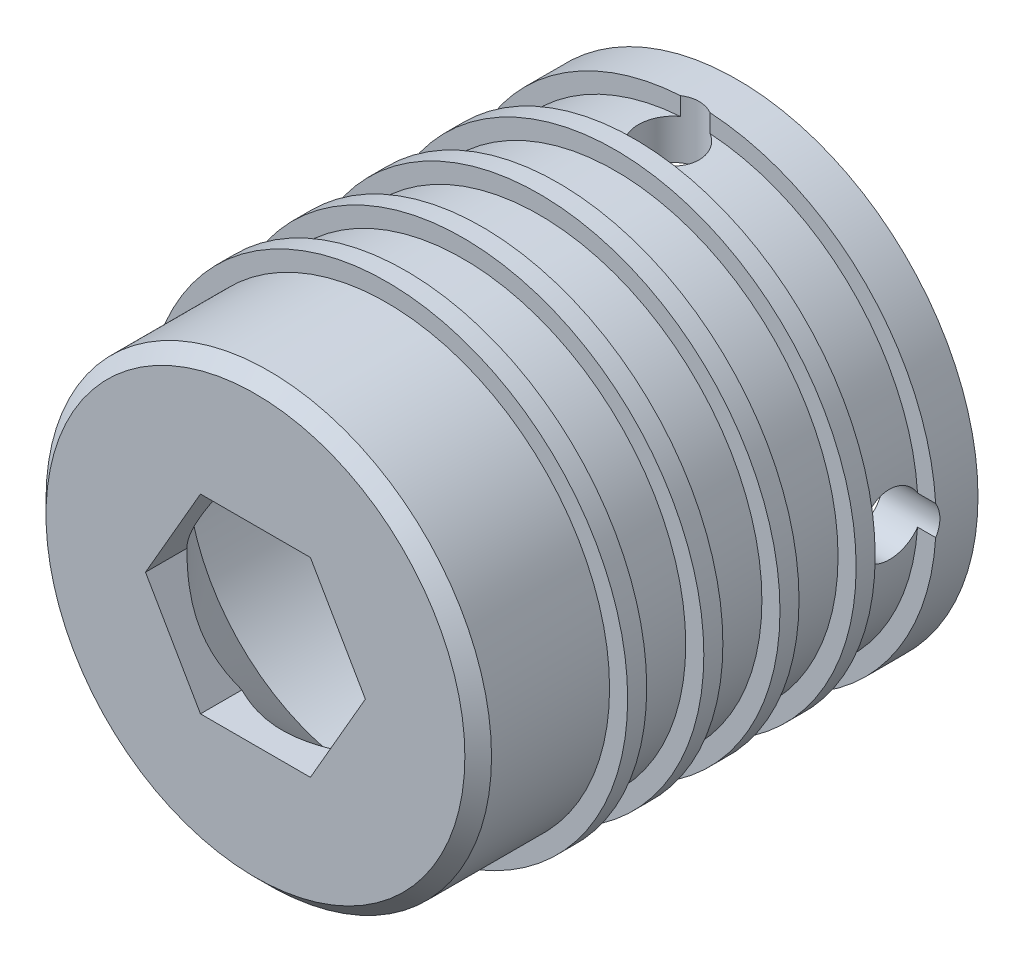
ISO-10303-21;
HEADER;
FILE_DESCRIPTION(('STEP AP214'),'2;1');
FILE_NAME('part.step','',(''),(''),'','','');
FILE_SCHEMA(('AUTOMOTIVE_DESIGN { 1 0 10303 214 1 1 1 1 }'));
ENDSEC;
DATA;
#1=APPLICATION_CONTEXT('core data for automotive mechanical design processes');
#2=APPLICATION_PROTOCOL_DEFINITION('international standard','automotive_design',2000,#1);
#3=PRODUCT_CONTEXT('',#1,'mechanical');
#4=PRODUCT('Part','Part','',(#3));
#5=PRODUCT_RELATED_PRODUCT_CATEGORY('part','',(#4));
#6=PRODUCT_DEFINITION_FORMATION('','',#4);
#7=PRODUCT_DEFINITION_CONTEXT('part definition',#1,'design');
#8=PRODUCT_DEFINITION('design','',#6,#7);
#9=PRODUCT_DEFINITION_SHAPE('','',#8);
#10=(LENGTH_UNIT() NAMED_UNIT(*) SI_UNIT(.MILLI.,.METRE.));
#11=(NAMED_UNIT(*) PLANE_ANGLE_UNIT() SI_UNIT($,.RADIAN.));
#12=(NAMED_UNIT(*) SI_UNIT($,.STERADIAN.) SOLID_ANGLE_UNIT());
#13=UNCERTAINTY_MEASURE_WITH_UNIT(LENGTH_MEASURE(1.E-05),#10,'distance_accuracy_value','');
#14=(GEOMETRIC_REPRESENTATION_CONTEXT(3) GLOBAL_UNCERTAINTY_ASSIGNED_CONTEXT((#13)) GLOBAL_UNIT_ASSIGNED_CONTEXT((#10,
#11,#12)) REPRESENTATION_CONTEXT('',''));
#15=CARTESIAN_POINT('',(0.,0.,0.));
#16=DIRECTION('',(0.,0.,1.));
#17=DIRECTION('',(1.,0.,0.));
#18=AXIS2_PLACEMENT_3D('',#15,#16,#17);
#19=CARTESIAN_POINT('',(0.,0.,12.65));
#20=DIRECTION('',(0.,0.,1.));
#21=DIRECTION('',(1.,0.,0.));
#22=AXIS2_PLACEMENT_3D('',#19,#20,#21);
#23=PLANE('',#22);
#24=DIRECTION('',(-0.5,0.866025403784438,0.));
#25=VECTOR('',#24,1.);
#26=CARTESIAN_POINT('',(2.88675134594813,0.,12.65));
#27=LINE('',#26,#25);
#28=CARTESIAN_POINT('',(2.88675134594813,0.,12.65));
#29=VERTEX_POINT('',#28);
#30=CARTESIAN_POINT('',(1.44337567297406,2.5,12.65));
#31=VERTEX_POINT('',#30);
#32=EDGE_CURVE('E61',#29,#31,#27,.T.);
#33=ORIENTED_EDGE('',*,*,#32,.F.);
#34=DIRECTION('',(0.5,0.866025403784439,0.));
#35=VECTOR('',#34,1.);
#36=CARTESIAN_POINT('',(1.44337567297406,-2.5,12.65));
#37=LINE('',#36,#35);
#38=CARTESIAN_POINT('',(1.44337567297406,-2.5,12.65));
#39=VERTEX_POINT('',#38);
#40=EDGE_CURVE('E180',#39,#29,#37,.T.);
#41=ORIENTED_EDGE('',*,*,#40,.F.);
#42=DIRECTION('',(1.,0.,0.));
#43=VECTOR('',#42,1.);
#44=CARTESIAN_POINT('',(-1.44337567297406,-2.5,12.65));
#45=LINE('',#44,#43);
#46=CARTESIAN_POINT('',(-1.44337567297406,-2.5,12.65));
#47=VERTEX_POINT('',#46);
#48=EDGE_CURVE('E173',#47,#39,#45,.T.);
#49=ORIENTED_EDGE('',*,*,#48,.F.);
#50=DIRECTION('',(0.5,-0.866025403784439,0.));
#51=VECTOR('',#50,1.);
#52=CARTESIAN_POINT('',(-2.88675134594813,0.,12.65));
#53=LINE('',#52,#51);
#54=CARTESIAN_POINT('',(-2.88675134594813,0.,12.65));
#55=VERTEX_POINT('',#54);
#56=EDGE_CURVE('E168',#55,#47,#53,.T.);
#57=ORIENTED_EDGE('',*,*,#56,.F.);
#58=DIRECTION('',(-0.5,-0.866025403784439,0.));
#59=VECTOR('',#58,1.);
#60=CARTESIAN_POINT('',(-1.44337567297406,2.5,12.65));
#61=LINE('',#60,#59);
#62=CARTESIAN_POINT('',(-1.44337567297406,2.5,12.65));
#63=VERTEX_POINT('',#62);
#64=EDGE_CURVE('E150',#63,#55,#61,.T.);
#65=ORIENTED_EDGE('',*,*,#64,.F.);
#66=DIRECTION('',(-1.,0.,0.));
#67=VECTOR('',#66,1.);
#68=CARTESIAN_POINT('',(1.44337567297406,2.5,12.65));
#69=LINE('',#68,#67);
#70=EDGE_CURVE('E160',#31,#63,#69,.T.);
#71=ORIENTED_EDGE('',*,*,#70,.F.);
#72=EDGE_LOOP('',(#33,#41,#49,#57,#65,#71));
#73=FACE_BOUND('',#72,.T.);
#74=CARTESIAN_POINT('',(0.,0.,12.65));
#75=DIRECTION('',(0.,0.,1.));
#76=DIRECTION('',(1.,0.,0.));
#77=AXIS2_PLACEMENT_3D('',#74,#75,#76);
#78=CIRCLE('',#77,5.5);
#79=CARTESIAN_POINT('',(5.5,0.,12.65));
#80=VERTEX_POINT('',#79);
#81=EDGE_CURVE('E932',#80,#80,#78,.T.);
#82=ORIENTED_EDGE('',*,*,#81,.T.);
#83=EDGE_LOOP('',(#82));
#84=FACE_BOUND('',#83,.T.);
#85=ADVANCED_FACE('F44',(#73,#84),#23,.T.);
#86=CARTESIAN_POINT('',(0.,0.,9.65));
#87=DIRECTION('',(0.,0.,1.));
#88=DIRECTION('',(1.,0.,0.));
#89=AXIS2_PLACEMENT_3D('',#86,#87,#88);
#90=CYLINDRICAL_SURFACE('',#89,5.85);
#91=CARTESIAN_POINT('',(0.,0.,9.2));
#92=DIRECTION('',(0.,0.,1.));
#93=DIRECTION('',(1.,0.,0.));
#94=AXIS2_PLACEMENT_3D('',#91,#92,#93);
#95=CIRCLE('',#94,5.85);
#96=CARTESIAN_POINT('',(5.85,0.,9.2));
#97=VERTEX_POINT('',#96);
#98=EDGE_CURVE('E255',#97,#97,#95,.T.);
#99=ORIENTED_EDGE('',*,*,#98,.T.);
#100=EDGE_LOOP('',(#99));
#101=FACE_BOUND('',#100,.T.);
#102=CARTESIAN_POINT('',(0.,0.,12.3));
#103=DIRECTION('',(0.,0.,-1.));
#104=DIRECTION('',(-1.,0.,0.));
#105=AXIS2_PLACEMENT_3D('',#102,#103,#104);
#106=CIRCLE('',#105,5.85);
#107=CARTESIAN_POINT('',(-5.85,0.,12.3));
#108=VERTEX_POINT('',#107);
#109=EDGE_CURVE('E48',#108,#108,#106,.T.);
#110=ORIENTED_EDGE('',*,*,#109,.T.);
#111=EDGE_LOOP('',(#110));
#112=FACE_BOUND('',#111,.T.);
#113=ADVANCED_FACE('F434',(#101,#112),#90,.T.);
#114=CARTESIAN_POINT('',(0.,0.,12.65));
#115=DIRECTION('',(0.,0.,-1.));
#116=DIRECTION('',(-1.,0.,0.));
#117=AXIS2_PLACEMENT_3D('',#114,#115,#116);
#118=CYLINDRICAL_SURFACE('',#117,6.325);
#119=CARTESIAN_POINT('',(0.,0.,0.));
#120=DIRECTION('',(0.,0.,1.));
#121=DIRECTION('',(1.,0.,0.));
#122=AXIS2_PLACEMENT_3D('',#119,#120,#121);
#123=CIRCLE('',#122,6.325);
#124=CARTESIAN_POINT('',(6.325,0.,0.));
#125=VERTEX_POINT('',#124);
#126=EDGE_CURVE('E863',#125,#125,#123,.T.);
#127=ORIENTED_EDGE('',*,*,#126,.T.);
#128=EDGE_LOOP('',(#127));
#129=FACE_BOUND('',#128,.T.);
#130=CARTESIAN_POINT('',(0.,0.,1.1));
#131=DIRECTION('',(0.,0.,1.));
#132=DIRECTION('',(1.,0.,0.));
#133=AXIS2_PLACEMENT_3D('',#130,#131,#132);
#134=CIRCLE('',#133,6.325);
#135=CARTESIAN_POINT('',(6.31313115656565,0.387298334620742,1.1));
#136=VERTEX_POINT('',#135);
#137=CARTESIAN_POINT('',(0.38729833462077,6.31313115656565,1.09999999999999));
#138=VERTEX_POINT('',#137);
#139=EDGE_CURVE('E204',#136,#138,#134,.T.);
#140=ORIENTED_EDGE('',*,*,#139,.F.);
#141=CARTESIAN_POINT('',(6.325,0.,1.));
#142=CARTESIAN_POINT('',(6.32499936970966,-0.0447447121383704,1.00000189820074));
#143=CARTESIAN_POINT('',(6.32452018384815,-0.0895172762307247,1.0037665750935));
#144=CARTESIAN_POINT('',(6.32265471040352,-0.177816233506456,1.01872500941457));
#145=CARTESIAN_POINT('',(6.32126747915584,-0.221341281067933,1.02992649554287));
#146=CARTESIAN_POINT('',(6.31774217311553,-0.305854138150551,1.05942298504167));
#147=CARTESIAN_POINT('',(6.31560460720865,-0.346843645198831,1.07771318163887));
#148=CARTESIAN_POINT('',(6.31081628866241,-0.425163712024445,1.12085731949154));
#149=CARTESIAN_POINT('',(6.30816562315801,-0.462494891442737,1.14571014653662));
#150=CARTESIAN_POINT('',(6.30263029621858,-0.532656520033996,1.2014236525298));
#151=CARTESIAN_POINT('',(6.29974452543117,-0.565463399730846,1.23231390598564));
#152=CARTESIAN_POINT('',(6.29407316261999,-0.625442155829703,1.29916189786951));
#153=CARTESIAN_POINT('',(6.29128757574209,-0.652613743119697,1.33511989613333));
#154=CARTESIAN_POINT('',(6.28612106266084,-0.700638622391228,1.4112361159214));
#155=CARTESIAN_POINT('',(6.28374156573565,-0.721469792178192,1.45140840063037));
#156=CARTESIAN_POINT('',(6.27967130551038,-0.756081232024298,1.53471622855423));
#157=CARTESIAN_POINT('',(6.27798051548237,-0.769861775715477,1.57785165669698));
#158=CARTESIAN_POINT('',(6.27548971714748,-0.789909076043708,1.66561650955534));
#159=CARTESIAN_POINT('',(6.27468498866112,-0.796215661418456,1.7102367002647));
#160=CARTESIAN_POINT('',(6.2740429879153,-0.801259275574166,1.79990883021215));
#161=CARTESIAN_POINT('',(6.27420567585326,-0.799996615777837,1.84496075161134));
#162=CARTESIAN_POINT('',(6.27547580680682,-0.789970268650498,1.93393970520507));
#163=CARTESIAN_POINT('',(6.27657772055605,-0.781250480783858,1.97787177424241));
#164=CARTESIAN_POINT('',(6.27959351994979,-0.756625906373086,2.0636440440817));
#165=CARTESIAN_POINT('',(6.28150742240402,-0.740720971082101,2.10548420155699));
#166=CARTESIAN_POINT('',(6.28593781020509,-0.702130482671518,2.18602118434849));
#167=CARTESIAN_POINT('',(6.28845598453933,-0.679425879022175,2.22470878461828));
#168=CARTESIAN_POINT('',(6.29380987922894,-0.627894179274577,2.29774135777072));
#169=CARTESIAN_POINT('',(6.29664561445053,-0.599066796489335,2.33208612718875));
#170=CARTESIAN_POINT('',(6.30233968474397,-0.535864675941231,2.39571290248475));
#171=CARTESIAN_POINT('',(6.30519803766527,-0.50145210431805,2.42495733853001));
#172=CARTESIAN_POINT('',(6.31059649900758,-0.4281866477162,2.47726068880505));
#173=CARTESIAN_POINT('',(6.31313660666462,-0.389333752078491,2.50031958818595));
#174=CARTESIAN_POINT('',(6.31761400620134,-0.308261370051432,2.53959743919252));
#175=CARTESIAN_POINT('',(6.31955108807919,-0.266040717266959,2.55581400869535));
#176=CARTESIAN_POINT('',(6.32260228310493,-0.179445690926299,2.58091689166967));
#177=CARTESIAN_POINT('',(6.32371643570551,-0.135071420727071,2.5898035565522));
#178=CARTESIAN_POINT('',(6.32499110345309,-0.0457535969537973,2.59994560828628));
#179=CARTESIAN_POINT('',(6.32515808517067,-0.00081600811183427,2.60125274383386));
#180=CARTESIAN_POINT('',(6.32453706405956,0.088637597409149,2.59633524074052));
#181=CARTESIAN_POINT('',(6.3237490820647,0.133153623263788,2.59011076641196));
#182=CARTESIAN_POINT('',(6.32131070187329,0.220347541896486,2.57034972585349));
#183=CARTESIAN_POINT('',(6.31966321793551,0.263031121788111,2.55683786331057));
#184=CARTESIAN_POINT('',(6.31569026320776,0.345526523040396,2.52291130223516));
#185=CARTESIAN_POINT('',(6.31336476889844,0.385338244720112,2.50249636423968));
#186=CARTESIAN_POINT('',(6.30827889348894,0.461190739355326,2.45521816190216));
#187=CARTESIAN_POINT('',(6.30551628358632,0.497210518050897,2.42832145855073));
#188=CARTESIAN_POINT('',(6.29987210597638,0.56424298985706,2.36889049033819));
#189=CARTESIAN_POINT('',(6.29699053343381,0.595255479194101,2.33635599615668));
#190=CARTESIAN_POINT('',(6.29141322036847,0.651576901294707,2.26634489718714));
#191=CARTESIAN_POINT('',(6.28871866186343,0.676851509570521,2.22884057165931));
#192=CARTESIAN_POINT('',(6.28383998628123,0.720742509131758,2.15008879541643));
#193=CARTESIAN_POINT('',(6.28165585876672,0.739359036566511,2.10884142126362));
#194=CARTESIAN_POINT('',(6.27805341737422,0.769349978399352,2.023884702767));
#195=CARTESIAN_POINT('',(6.27663306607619,0.780743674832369,1.98018225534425));
#196=CARTESIAN_POINT('',(6.2747131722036,0.79602758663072,1.8914652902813));
#197=CARTESIAN_POINT('',(6.27421358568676,0.799918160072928,1.84645083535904));
#198=CARTESIAN_POINT('',(6.27419308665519,0.80007871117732,1.75672916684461));
#199=CARTESIAN_POINT('',(6.27466524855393,0.796402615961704,1.71202204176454));
#200=CARTESIAN_POINT('',(6.27652014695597,0.781648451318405,1.62386656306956));
#201=CARTESIAN_POINT('',(6.27790288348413,0.770570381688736,1.580418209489));
#202=CARTESIAN_POINT('',(6.2814209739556,0.74134371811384,1.49602113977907));
#203=CARTESIAN_POINT('',(6.28355604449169,0.723197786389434,1.45507148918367));
#204=CARTESIAN_POINT('',(6.28833869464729,0.680355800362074,1.37678963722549));
#205=CARTESIAN_POINT('',(6.29098628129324,0.65565965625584,1.33945748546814));
#206=CARTESIAN_POINT('',(6.29651824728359,0.600218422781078,1.26919477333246));
#207=CARTESIAN_POINT('',(6.29940412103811,0.569433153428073,1.23629603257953));
#208=CARTESIAN_POINT('',(6.30507434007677,0.502771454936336,1.1761109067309));
#209=CARTESIAN_POINT('',(6.30785866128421,0.466893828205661,1.14882584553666));
#210=CARTESIAN_POINT('',(6.31302405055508,0.39090544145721,1.10055190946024));
#211=CARTESIAN_POINT('',(6.31540350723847,0.350778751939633,1.07958794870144));
#212=CARTESIAN_POINT('',(6.31947477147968,0.267566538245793,1.04472607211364));
#213=CARTESIAN_POINT('',(6.3211673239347,0.224484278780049,1.03082049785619));
#214=CARTESIAN_POINT('',(6.3232672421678,0.15098391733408,1.01378925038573));
#215=CARTESIAN_POINT('',(6.32391385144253,0.1210288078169,1.00862573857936));
#216=CARTESIAN_POINT('',(6.32478044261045,0.0607200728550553,1.00173048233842));
#217=CARTESIAN_POINT('',(6.3250004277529,0.0303664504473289,0.999998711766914));
#218=CARTESIAN_POINT('',(6.325,0.,1.));
#219=B_SPLINE_CURVE_WITH_KNOTS('',3,(#141,#142,#143,#144,#145,#146,#147,#148,#149,#150,#151,
#152,#153,#154,#155,#156,#157,#158,#159,#160,#161,#162,#163,#164,#165,#166,#167,#168,#169,#170,
#171,#172,#173,#174,#175,#176,#177,#178,#179,#180,#181,#182,#183,#184,#185,#186,#187,#188,#189,
#190,#191,#192,#193,#194,#195,#196,#197,#198,#199,#200,#201,#202,#203,#204,#205,#206,#207,#208,
#209,#210,#211,#212,#213,#214,#215,#216,#217,#218),.UNSPECIFIED.,.T.,.F.,(4,2,2,2,2,2,2,2,2,2,2,
2,2,2,2,2,2,2,2,2,2,2,2,2,2,2,2,2,2,2,2,2,2,2,2,2,2,2,4),(0.,0.134123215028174,
0.268386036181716,0.402557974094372,0.536707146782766,0.671530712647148,0.806361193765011,
0.941656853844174,1.07694726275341,1.21151341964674,1.34607404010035,1.47984792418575,
1.61362457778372,1.747779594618,1.88194089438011,2.01705215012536,2.15216373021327,
2.28732230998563,2.42247440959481,2.5567026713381,2.69092800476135,2.82470115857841,
2.95847895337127,3.09296225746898,3.2274510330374,3.36272429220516,3.49799478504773,
3.6329026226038,3.76780402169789,3.90174731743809,4.03569061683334,4.16958351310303,
4.30347824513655,4.43828789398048,4.57312929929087,4.70849542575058,4.84371436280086,
4.93473912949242,5.02576320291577),.UNSPECIFIED.);
#220=CARTESIAN_POINT('',(6.31313115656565,-0.387298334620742,1.1));
#221=VERTEX_POINT('',#220);
#222=EDGE_CURVE('E366',#136,#221,#219,.T.);
#223=ORIENTED_EDGE('',*,*,#222,.T.);
#224=CARTESIAN_POINT('',(0.38729833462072,-6.31313115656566,1.1));
#225=VERTEX_POINT('',#224);
#226=EDGE_CURVE('E202',#225,#221,#134,.T.);
#227=ORIENTED_EDGE('',*,*,#226,.F.);
#228=CARTESIAN_POINT('',(0.799999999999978,-6.27420313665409,1.8));
#229=CARTESIAN_POINT('',(0.799998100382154,-6.27420378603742,1.75525690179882));
#230=CARTESIAN_POINT('',(0.796233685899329,-6.27468691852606,1.71048594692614));
#231=CARTESIAN_POINT('',(0.781276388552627,-6.27656648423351,1.62219033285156));
#232=CARTESIAN_POINT('',(0.770075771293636,-6.27796386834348,1.5786670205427));
#233=CARTESIAN_POINT('',(0.740581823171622,-6.2815111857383,1.494157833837));
#234=CARTESIAN_POINT('',(0.722293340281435,-6.28366060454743,1.45317024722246));
#235=CARTESIAN_POINT('',(0.679153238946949,-6.28846918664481,1.37485340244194));
#236=CARTESIAN_POINT('',(0.65430273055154,-6.29112826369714,1.33752352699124));
#237=CARTESIAN_POINT('',(0.598591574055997,-6.2966736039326,1.26736044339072));
#238=CARTESIAN_POINT('',(0.567700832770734,-6.29956095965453,1.23455121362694));
#239=CARTESIAN_POINT('',(0.500850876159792,-6.30522770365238,1.17456791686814));
#240=CARTESIAN_POINT('',(0.464891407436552,-6.30800708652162,1.14739413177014));
#241=CARTESIAN_POINT('',(0.388773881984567,-6.3131559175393,1.09936694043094));
#242=CARTESIAN_POINT('',(0.348602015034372,-6.31552394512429,1.07853525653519));
#243=CARTESIAN_POINT('',(0.265295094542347,-6.31957124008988,1.0439227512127));
#244=CARTESIAN_POINT('',(0.222160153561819,-6.32125053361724,1.03014166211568));
#245=CARTESIAN_POINT('',(0.134396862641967,-6.32372345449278,1.01009324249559));
#246=CARTESIAN_POINT('',(0.0897777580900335,-6.32452178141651,1.00378602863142));
#247=CARTESIAN_POINT('',(0.000107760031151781,-6.32515887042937,0.998740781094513));
#248=CARTESIAN_POINT('',(-0.044943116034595,-6.32499767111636,1.00000244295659));
#249=CARTESIAN_POINT('',(-0.133926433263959,-6.32373767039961,1.01002719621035));
#250=CARTESIAN_POINT('',(-0.177863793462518,-6.32264423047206,1.01874739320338));
#251=CARTESIAN_POINT('',(-0.263646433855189,-6.31964862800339,1.04337461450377));
#252=CARTESIAN_POINT('',(-0.305491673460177,-6.31774644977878,1.05928177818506));
#253=CARTESIAN_POINT('',(-0.386034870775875,-6.31333786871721,1.0978769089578));
#254=CARTESIAN_POINT('',(-0.424723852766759,-6.3108298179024,1.12058341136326));
#255=CARTESIAN_POINT('',(-0.497758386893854,-6.3054900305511,1.17211917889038));
#256=CARTESIAN_POINT('',(-0.5321037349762,-6.30265827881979,1.20094873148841));
#257=CARTESIAN_POINT('',(-0.595728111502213,-6.29696454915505,1.26415240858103));
#258=CARTESIAN_POINT('',(-0.624970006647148,-6.29410249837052,1.2985639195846));
#259=CARTESIAN_POINT('',(-0.677268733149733,-6.28869028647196,1.37182634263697));
#260=CARTESIAN_POINT('',(-0.700325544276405,-6.28614012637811,1.41067726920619));
#261=CARTESIAN_POINT('',(-0.739601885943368,-6.28164046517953,1.4917490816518));
#262=CARTESIAN_POINT('',(-0.755818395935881,-6.27969122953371,1.53397144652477));
#263=CARTESIAN_POINT('',(-0.780920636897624,-6.27661926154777,1.62057019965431));
#264=CARTESIAN_POINT('',(-0.7898067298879,-6.27549648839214,1.66494648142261));
#265=CARTESIAN_POINT('',(-0.799946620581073,-6.27421204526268,1.75426529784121));
#266=CARTESIAN_POINT('',(-0.801252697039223,-6.27404379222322,1.79920180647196));
#267=CARTESIAN_POINT('',(-0.796333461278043,-6.27467002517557,1.88865299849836));
#268=CARTESIAN_POINT('',(-0.790108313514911,-6.27546449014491,1.93316769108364));
#269=CARTESIAN_POINT('',(-0.77034737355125,-6.27792063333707,2.0203546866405));
#270=CARTESIAN_POINT('',(-0.756836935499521,-6.27957930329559,2.06303282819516));
#271=CARTESIAN_POINT('',(-0.722915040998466,-6.28357452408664,2.1455179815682));
#272=CARTESIAN_POINT('',(-0.702503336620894,-6.28591109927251,2.1853248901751));
#273=CARTESIAN_POINT('',(-0.65522994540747,-6.29101461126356,2.26117401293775));
#274=CARTESIAN_POINT('',(-0.628333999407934,-6.2937838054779,2.29719472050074));
#275=CARTESIAN_POINT('',(-0.568903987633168,-6.29943346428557,2.36422941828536));
#276=CARTESIAN_POINT('',(-0.536369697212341,-6.30231393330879,2.39524320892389));
#277=CARTESIAN_POINT('',(-0.466358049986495,-6.30788182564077,2.45156757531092));
#278=CARTESIAN_POINT('',(-0.428852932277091,-6.31056802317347,2.47684378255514));
#279=CARTESIAN_POINT('',(-0.350099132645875,-6.31542634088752,2.52073758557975));
#280=CARTESIAN_POINT('',(-0.308850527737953,-6.31759847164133,2.53935531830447));
#281=CARTESIAN_POINT('',(-0.223894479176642,-6.32117847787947,2.56934702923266));
#282=CARTESIAN_POINT('',(-0.180194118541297,-6.32258844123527,2.58074081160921));
#283=CARTESIAN_POINT('',(-0.0914815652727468,-6.32449392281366,2.59602560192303));
#284=CARTESIAN_POINT('',(-0.0464694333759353,-6.32498948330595,2.59991695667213));
#285=CARTESIAN_POINT('',(0.043253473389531,-6.32501011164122,2.6000798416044));
#286=CARTESIAN_POINT('',(0.0879641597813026,-6.32454192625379,2.59640434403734));
#287=CARTESIAN_POINT('',(0.176126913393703,-6.32270108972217,2.58165012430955));
#288=CARTESIAN_POINT('',(0.219578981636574,-6.3213284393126,2.57057140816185));
#289=CARTESIAN_POINT('',(0.30398369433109,-6.31783221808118,2.54134199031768));
#290=CARTESIAN_POINT('',(0.34493725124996,-6.31570892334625,2.52319388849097));
#291=CARTESIAN_POINT('',(0.423226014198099,-6.31094642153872,2.48034634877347));
#292=CARTESIAN_POINT('',(0.460561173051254,-6.308307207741,2.45564682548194));
#293=CARTESIAN_POINT('',(0.53082386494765,-6.30278536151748,2.40020181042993));
#294=CARTESIAN_POINT('',(0.56372018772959,-6.29990121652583,2.36941691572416));
#295=CARTESIAN_POINT('',(0.623900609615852,-6.29422665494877,2.30275697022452));
#296=CARTESIAN_POINT('',(0.651183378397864,-6.29143626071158,2.26688071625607));
#297=CARTESIAN_POINT('',(0.699454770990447,-6.28625337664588,2.19089351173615));
#298=CARTESIAN_POINT('',(0.720418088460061,-6.28386250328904,2.15076638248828));
#299=CARTESIAN_POINT('',(0.755278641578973,-6.27976830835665,2.06755325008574));
#300=CARTESIAN_POINT('',(0.769183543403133,-6.27806424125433,2.02447051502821));
#301=CARTESIAN_POINT('',(0.786212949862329,-6.27594927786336,1.95097194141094));
#302=CARTESIAN_POINT('',(0.791375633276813,-6.27529774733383,1.92101922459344));
#303=CARTESIAN_POINT('',(0.798269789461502,-6.27442445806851,1.86071527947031));
#304=CARTESIAN_POINT('',(0.800001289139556,-6.27420269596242,1.83036405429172));
#305=CARTESIAN_POINT('',(0.799999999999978,-6.27420313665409,1.8));
#306=B_SPLINE_CURVE_WITH_KNOTS('',3,(#228,#229,#230,#231,#232,#233,#234,#235,#236,#237,#238,
#239,#240,#241,#242,#243,#244,#245,#246,#247,#248,#249,#250,#251,#252,#253,#254,#255,#256,#257,
#258,#259,#260,#261,#262,#263,#264,#265,#266,#267,#268,#269,#270,#271,#272,#273,#274,#275,#276,
#277,#278,#279,#280,#281,#282,#283,#284,#285,#286,#287,#288,#289,#290,#291,#292,#293,#294,#295,
#296,#297,#298,#299,#300,#301,#302,#303,#304,#305),.UNSPECIFIED.,.T.,.F.,(4,2,2,2,2,2,2,2,2,2,2,
2,2,2,2,2,2,2,2,2,2,2,2,2,2,2,2,2,2,2,2,2,2,2,2,2,2,2,4),(0.,0.134118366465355,
0.268376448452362,0.402542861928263,0.536686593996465,0.671516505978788,0.806353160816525,
0.9416465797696,1.07693486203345,1.21149789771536,1.34605552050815,1.47984445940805,
1.61363599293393,1.74779562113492,1.8819615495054,2.01706630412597,2.15217150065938,
2.28733629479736,2.42249441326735,2.55671923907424,2.6909411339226,2.82469889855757,
2.9584614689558,3.09294688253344,3.22743765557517,3.36271394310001,3.49798744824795,
3.63288848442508,3.76778328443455,3.90173695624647,4.03569051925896,4.16959486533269,
4.30350095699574,4.43830430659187,4.573139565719,4.70850781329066,4.84372872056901,
4.93474631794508,5.02576320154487),.UNSPECIFIED.);
#307=CARTESIAN_POINT('',(-0.387298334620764,-6.31313115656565,1.1));
#308=VERTEX_POINT('',#307);
#309=EDGE_CURVE('E333',#225,#308,#306,.T.);
#310=ORIENTED_EDGE('',*,*,#309,.T.);
#311=CARTESIAN_POINT('',(-6.31313115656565,-0.387298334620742,1.1));
#312=VERTEX_POINT('',#311);
#313=EDGE_CURVE('E835',#312,#308,#134,.T.);
#314=ORIENTED_EDGE('',*,*,#313,.F.);
#315=CARTESIAN_POINT('',(-6.325,0.,1.));
#316=CARTESIAN_POINT('',(-6.32499936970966,0.0447447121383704,1.00000189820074));
#317=CARTESIAN_POINT('',(-6.32452018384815,0.0895172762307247,1.0037665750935));
#318=CARTESIAN_POINT('',(-6.32265471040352,0.177816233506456,1.01872500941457));
#319=CARTESIAN_POINT('',(-6.32126747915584,0.221341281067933,1.02992649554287));
#320=CARTESIAN_POINT('',(-6.31774217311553,0.305854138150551,1.05942298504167));
#321=CARTESIAN_POINT('',(-6.31560460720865,0.346843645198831,1.07771318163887));
#322=CARTESIAN_POINT('',(-6.31081628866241,0.425163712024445,1.12085731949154));
#323=CARTESIAN_POINT('',(-6.30816562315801,0.462494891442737,1.14571014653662));
#324=CARTESIAN_POINT('',(-6.30263029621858,0.532656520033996,1.2014236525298));
#325=CARTESIAN_POINT('',(-6.29974452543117,0.565463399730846,1.23231390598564));
#326=CARTESIAN_POINT('',(-6.29407316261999,0.625442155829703,1.29916189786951));
#327=CARTESIAN_POINT('',(-6.29128757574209,0.652613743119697,1.33511989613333));
#328=CARTESIAN_POINT('',(-6.28612106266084,0.700638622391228,1.4112361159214));
#329=CARTESIAN_POINT('',(-6.28374156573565,0.721469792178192,1.45140840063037));
#330=CARTESIAN_POINT('',(-6.27967130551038,0.756081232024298,1.53471622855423));
#331=CARTESIAN_POINT('',(-6.27798051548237,0.769861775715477,1.57785165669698));
#332=CARTESIAN_POINT('',(-6.27548971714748,0.789909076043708,1.66561650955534));
#333=CARTESIAN_POINT('',(-6.27468498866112,0.796215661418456,1.7102367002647));
#334=CARTESIAN_POINT('',(-6.2740429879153,0.801259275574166,1.79990883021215));
#335=CARTESIAN_POINT('',(-6.27420567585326,0.799996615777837,1.84496075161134));
#336=CARTESIAN_POINT('',(-6.27547580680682,0.789970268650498,1.93393970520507));
#337=CARTESIAN_POINT('',(-6.27657772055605,0.781250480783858,1.97787177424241));
#338=CARTESIAN_POINT('',(-6.27959351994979,0.756625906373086,2.0636440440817));
#339=CARTESIAN_POINT('',(-6.28150742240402,0.740720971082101,2.10548420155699));
#340=CARTESIAN_POINT('',(-6.28593781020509,0.702130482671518,2.18602118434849));
#341=CARTESIAN_POINT('',(-6.28845598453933,0.679425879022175,2.22470878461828));
#342=CARTESIAN_POINT('',(-6.29380987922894,0.627894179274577,2.29774135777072));
#343=CARTESIAN_POINT('',(-6.29664561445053,0.599066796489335,2.33208612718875));
#344=CARTESIAN_POINT('',(-6.30233968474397,0.535864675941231,2.39571290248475));
#345=CARTESIAN_POINT('',(-6.30519803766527,0.50145210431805,2.42495733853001));
#346=CARTESIAN_POINT('',(-6.31059649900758,0.4281866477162,2.47726068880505));
#347=CARTESIAN_POINT('',(-6.31313660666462,0.389333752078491,2.50031958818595));
#348=CARTESIAN_POINT('',(-6.31761400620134,0.308261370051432,2.53959743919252));
#349=CARTESIAN_POINT('',(-6.31955108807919,0.266040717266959,2.55581400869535));
#350=CARTESIAN_POINT('',(-6.32260228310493,0.179445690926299,2.58091689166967));
#351=CARTESIAN_POINT('',(-6.32371643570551,0.135071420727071,2.5898035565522));
#352=CARTESIAN_POINT('',(-6.32499110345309,0.0457535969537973,2.59994560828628));
#353=CARTESIAN_POINT('',(-6.32515808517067,0.00081600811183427,2.60125274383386));
#354=CARTESIAN_POINT('',(-6.32453706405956,-0.088637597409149,2.59633524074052));
#355=CARTESIAN_POINT('',(-6.3237490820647,-0.133153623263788,2.59011076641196));
#356=CARTESIAN_POINT('',(-6.32131070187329,-0.220347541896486,2.57034972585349));
#357=CARTESIAN_POINT('',(-6.31966321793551,-0.263031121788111,2.55683786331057));
#358=CARTESIAN_POINT('',(-6.31569026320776,-0.345526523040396,2.52291130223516));
#359=CARTESIAN_POINT('',(-6.31336476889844,-0.385338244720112,2.50249636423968));
#360=CARTESIAN_POINT('',(-6.30827889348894,-0.461190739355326,2.45521816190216));
#361=CARTESIAN_POINT('',(-6.30551628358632,-0.497210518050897,2.42832145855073));
#362=CARTESIAN_POINT('',(-6.29987210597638,-0.56424298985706,2.36889049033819));
#363=CARTESIAN_POINT('',(-6.29699053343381,-0.595255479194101,2.33635599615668));
#364=CARTESIAN_POINT('',(-6.29141322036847,-0.651576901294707,2.26634489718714));
#365=CARTESIAN_POINT('',(-6.28871866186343,-0.676851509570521,2.22884057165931));
#366=CARTESIAN_POINT('',(-6.28383998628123,-0.720742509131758,2.15008879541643));
#367=CARTESIAN_POINT('',(-6.28165585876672,-0.739359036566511,2.10884142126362));
#368=CARTESIAN_POINT('',(-6.27805341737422,-0.769349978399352,2.023884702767));
#369=CARTESIAN_POINT('',(-6.27663306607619,-0.780743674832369,1.98018225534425));
#370=CARTESIAN_POINT('',(-6.2747131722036,-0.79602758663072,1.8914652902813));
#371=CARTESIAN_POINT('',(-6.27421358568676,-0.799918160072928,1.84645083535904));
#372=CARTESIAN_POINT('',(-6.27419308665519,-0.80007871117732,1.75672916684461));
#373=CARTESIAN_POINT('',(-6.27466524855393,-0.796402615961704,1.71202204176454));
#374=CARTESIAN_POINT('',(-6.27652014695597,-0.781648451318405,1.62386656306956));
#375=CARTESIAN_POINT('',(-6.27790288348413,-0.770570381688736,1.580418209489));
#376=CARTESIAN_POINT('',(-6.2814209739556,-0.74134371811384,1.49602113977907));
#377=CARTESIAN_POINT('',(-6.28355604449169,-0.723197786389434,1.45507148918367));
#378=CARTESIAN_POINT('',(-6.28833869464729,-0.680355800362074,1.37678963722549));
#379=CARTESIAN_POINT('',(-6.29098628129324,-0.65565965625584,1.33945748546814));
#380=CARTESIAN_POINT('',(-6.29651824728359,-0.600218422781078,1.26919477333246));
#381=CARTESIAN_POINT('',(-6.29940412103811,-0.569433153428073,1.23629603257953));
#382=CARTESIAN_POINT('',(-6.30507434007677,-0.502771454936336,1.1761109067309));
#383=CARTESIAN_POINT('',(-6.30785866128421,-0.466893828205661,1.14882584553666));
#384=CARTESIAN_POINT('',(-6.31302405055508,-0.39090544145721,1.10055190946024));
#385=CARTESIAN_POINT('',(-6.31540350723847,-0.350778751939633,1.07958794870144));
#386=CARTESIAN_POINT('',(-6.31947477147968,-0.267566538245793,1.04472607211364));
#387=CARTESIAN_POINT('',(-6.3211673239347,-0.224484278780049,1.03082049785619));
#388=CARTESIAN_POINT('',(-6.3232672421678,-0.15098391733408,1.01378925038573));
#389=CARTESIAN_POINT('',(-6.32391385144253,-0.1210288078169,1.00862573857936));
#390=CARTESIAN_POINT('',(-6.32478044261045,-0.0607200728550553,1.00173048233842));
#391=CARTESIAN_POINT('',(-6.3250004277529,-0.0303664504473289,0.999998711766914));
#392=CARTESIAN_POINT('',(-6.325,0.,1.));
#393=B_SPLINE_CURVE_WITH_KNOTS('',3,(#315,#316,#317,#318,#319,#320,#321,#322,#323,#324,#325,
#326,#327,#328,#329,#330,#331,#332,#333,#334,#335,#336,#337,#338,#339,#340,#341,#342,#343,#344,
#345,#346,#347,#348,#349,#350,#351,#352,#353,#354,#355,#356,#357,#358,#359,#360,#361,#362,#363,
#364,#365,#366,#367,#368,#369,#370,#371,#372,#373,#374,#375,#376,#377,#378,#379,#380,#381,#382,
#383,#384,#385,#386,#387,#388,#389,#390,#391,#392),.UNSPECIFIED.,.T.,.F.,(4,2,2,2,2,2,2,2,2,2,2,
2,2,2,2,2,2,2,2,2,2,2,2,2,2,2,2,2,2,2,2,2,2,2,2,2,2,2,4),(0.,0.134123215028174,
0.268386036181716,0.402557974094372,0.536707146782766,0.671530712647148,0.806361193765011,
0.941656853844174,1.07694726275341,1.21151341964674,1.34607404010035,1.47984792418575,
1.61362457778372,1.747779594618,1.88194089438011,2.01705215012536,2.15216373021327,
2.28732230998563,2.42247440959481,2.5567026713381,2.69092800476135,2.82470115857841,
2.95847895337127,3.09296225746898,3.2274510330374,3.36272429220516,3.49799478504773,
3.6329026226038,3.76780402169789,3.90174731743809,4.03569061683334,4.16958351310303,
4.30347824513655,4.43828789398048,4.57312929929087,4.70849542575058,4.84371436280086,
4.93473912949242,5.02576320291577),.UNSPECIFIED.);
#394=CARTESIAN_POINT('',(-6.31313115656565,0.387298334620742,1.1));
#395=VERTEX_POINT('',#394);
#396=EDGE_CURVE('E371',#312,#395,#393,.T.);
#397=ORIENTED_EDGE('',*,*,#396,.T.);
#398=CARTESIAN_POINT('',(-0.38729833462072,6.31313115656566,1.1));
#399=VERTEX_POINT('',#398);
#400=EDGE_CURVE('E208',#399,#395,#134,.T.);
#401=ORIENTED_EDGE('',*,*,#400,.F.);
#402=CARTESIAN_POINT('',(0.,6.32500000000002,1.));
#403=CARTESIAN_POINT('',(0.0447447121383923,6.32499936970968,1.00000189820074));
#404=CARTESIAN_POINT('',(0.0895172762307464,6.32452018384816,1.0037665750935));
#405=CARTESIAN_POINT('',(0.177816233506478,6.32265471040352,1.01872500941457));
#406=CARTESIAN_POINT('',(0.221341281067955,6.32126747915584,1.02992649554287));
#407=CARTESIAN_POINT('',(0.305854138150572,6.31774217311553,1.05942298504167));
#408=CARTESIAN_POINT('',(0.346843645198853,6.31560460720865,1.07771318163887));
#409=CARTESIAN_POINT('',(0.425163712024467,6.31081628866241,1.12085731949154));
#410=CARTESIAN_POINT('',(0.462494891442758,6.30816562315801,1.14571014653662));
#411=CARTESIAN_POINT('',(0.532656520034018,6.30263029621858,1.2014236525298));
#412=CARTESIAN_POINT('',(0.565463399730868,6.29974452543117,1.23231390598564));
#413=CARTESIAN_POINT('',(0.625442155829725,6.29407316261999,1.29916189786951));
#414=CARTESIAN_POINT('',(0.652613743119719,6.29128757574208,1.33511989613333));
#415=CARTESIAN_POINT('',(0.70063862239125,6.28612106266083,1.4112361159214));
#416=CARTESIAN_POINT('',(0.721469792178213,6.28374156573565,1.45140840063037));
#417=CARTESIAN_POINT('',(0.75608123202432,6.27967130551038,1.53471622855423));
#418=CARTESIAN_POINT('',(0.769861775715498,6.27798051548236,1.57785165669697));
#419=CARTESIAN_POINT('',(0.78990907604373,6.27548971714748,1.66561650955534));
#420=CARTESIAN_POINT('',(0.796215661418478,6.27468498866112,1.7102367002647));
#421=CARTESIAN_POINT('',(0.801259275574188,6.2740429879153,1.79990883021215));
#422=CARTESIAN_POINT('',(0.799996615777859,6.27420567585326,1.84496075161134));
#423=CARTESIAN_POINT('',(0.78997026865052,6.27547580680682,1.93393970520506));
#424=CARTESIAN_POINT('',(0.78125048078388,6.27657772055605,1.97787177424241));
#425=CARTESIAN_POINT('',(0.756625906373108,6.27959351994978,2.0636440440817));
#426=CARTESIAN_POINT('',(0.740720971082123,6.28150742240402,2.10548420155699));
#427=CARTESIAN_POINT('',(0.70213048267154,6.28593781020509,2.18602118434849));
#428=CARTESIAN_POINT('',(0.679425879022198,6.28845598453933,2.22470878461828));
#429=CARTESIAN_POINT('',(0.6278941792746,6.29380987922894,2.29774135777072));
#430=CARTESIAN_POINT('',(0.599066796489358,6.29664561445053,2.33208612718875));
#431=CARTESIAN_POINT('',(0.535864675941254,6.30233968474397,2.39571290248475));
#432=CARTESIAN_POINT('',(0.501452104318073,6.30519803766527,2.42495733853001));
#433=CARTESIAN_POINT('',(0.428186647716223,6.31059649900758,2.47726068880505));
#434=CARTESIAN_POINT('',(0.389333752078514,6.31313660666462,2.50031958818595));
#435=CARTESIAN_POINT('',(0.308261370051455,6.31761400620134,2.53959743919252));
#436=CARTESIAN_POINT('',(0.266040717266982,6.31955108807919,2.55581400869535));
#437=CARTESIAN_POINT('',(0.179445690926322,6.32260228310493,2.58091689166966));
#438=CARTESIAN_POINT('',(0.135071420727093,6.32371643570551,2.5898035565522));
#439=CARTESIAN_POINT('',(0.0457535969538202,6.32499110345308,2.59994560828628));
#440=CARTESIAN_POINT('',(0.000816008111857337,6.32515808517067,2.60125274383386));
#441=CARTESIAN_POINT('',(-0.0886375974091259,6.32453706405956,2.59633524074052));
#442=CARTESIAN_POINT('',(-0.133153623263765,6.3237490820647,2.59011076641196));
#443=CARTESIAN_POINT('',(-0.220347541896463,6.32131070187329,2.57034972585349));
#444=CARTESIAN_POINT('',(-0.263031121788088,6.31966321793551,2.55683786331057));
#445=CARTESIAN_POINT('',(-0.345526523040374,6.31569026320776,2.52291130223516));
#446=CARTESIAN_POINT('',(-0.38533824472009,6.31336476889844,2.50249636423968));
#447=CARTESIAN_POINT('',(-0.461190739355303,6.30827889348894,2.45521816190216));
#448=CARTESIAN_POINT('',(-0.497210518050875,6.30551628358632,2.42832145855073));
#449=CARTESIAN_POINT('',(-0.564242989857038,6.29987210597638,2.36889049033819));
#450=CARTESIAN_POINT('',(-0.595255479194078,6.29699053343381,2.33635599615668));
#451=CARTESIAN_POINT('',(-0.651576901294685,6.29141322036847,2.26634489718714));
#452=CARTESIAN_POINT('',(-0.676851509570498,6.28871866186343,2.22884057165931));
#453=CARTESIAN_POINT('',(-0.720742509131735,6.28383998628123,2.15008879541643));
#454=CARTESIAN_POINT('',(-0.739359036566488,6.28165585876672,2.10884142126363));
#455=CARTESIAN_POINT('',(-0.76934997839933,6.27805341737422,2.02388470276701));
#456=CARTESIAN_POINT('',(-0.780743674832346,6.2766330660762,1.98018225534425));
#457=CARTESIAN_POINT('',(-0.796027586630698,6.2747131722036,1.8914652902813));
#458=CARTESIAN_POINT('',(-0.799918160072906,6.27421358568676,1.84645083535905));
#459=CARTESIAN_POINT('',(-0.800078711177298,6.27419308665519,1.75672916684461));
#460=CARTESIAN_POINT('',(-0.796402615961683,6.27466524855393,1.71202204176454));
#461=CARTESIAN_POINT('',(-0.781648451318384,6.27652014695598,1.62386656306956));
#462=CARTESIAN_POINT('',(-0.770570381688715,6.27790288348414,1.580418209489));
#463=CARTESIAN_POINT('',(-0.741343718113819,6.2814209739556,1.49602113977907));
#464=CARTESIAN_POINT('',(-0.723197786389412,6.28355604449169,1.45507148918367));
#465=CARTESIAN_POINT('',(-0.680355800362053,6.28833869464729,1.37678963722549));
#466=CARTESIAN_POINT('',(-0.655659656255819,6.29098628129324,1.33945748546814));
#467=CARTESIAN_POINT('',(-0.600218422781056,6.2965182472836,1.26919477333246));
#468=CARTESIAN_POINT('',(-0.569433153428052,6.29940412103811,1.23629603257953));
#469=CARTESIAN_POINT('',(-0.502771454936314,6.30507434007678,1.1761109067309));
#470=CARTESIAN_POINT('',(-0.46689382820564,6.30785866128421,1.14882584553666));
#471=CARTESIAN_POINT('',(-0.390905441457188,6.31302405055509,1.10055190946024));
#472=CARTESIAN_POINT('',(-0.350778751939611,6.31540350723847,1.07958794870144));
#473=CARTESIAN_POINT('',(-0.267566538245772,6.31947477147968,1.04472607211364));
#474=CARTESIAN_POINT('',(-0.224484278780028,6.3211673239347,1.03082049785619));
#475=CARTESIAN_POINT('',(-0.150983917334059,6.3232672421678,1.01378925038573));
#476=CARTESIAN_POINT('',(-0.121028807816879,6.32391385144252,1.00862573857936));
#477=CARTESIAN_POINT('',(-0.0607200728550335,6.32478044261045,1.00173048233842));
#478=CARTESIAN_POINT('',(-0.030366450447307,6.32500042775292,0.999998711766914));
#479=CARTESIAN_POINT('',(0.,6.32500000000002,1.));
#480=B_SPLINE_CURVE_WITH_KNOTS('',3,(#402,#403,#404,#405,#406,#407,#408,#409,#410,#411,#412,
#413,#414,#415,#416,#417,#418,#419,#420,#421,#422,#423,#424,#425,#426,#427,#428,#429,#430,#431,
#432,#433,#434,#435,#436,#437,#438,#439,#440,#441,#442,#443,#444,#445,#446,#447,#448,#449,#450,
#451,#452,#453,#454,#455,#456,#457,#458,#459,#460,#461,#462,#463,#464,#465,#466,#467,#468,#469,
#470,#471,#472,#473,#474,#475,#476,#477,#478,#479),.UNSPECIFIED.,.T.,.F.,(4,2,2,2,2,2,2,2,2,2,2,
2,2,2,2,2,2,2,2,2,2,2,2,2,2,2,2,2,2,2,2,2,2,2,2,2,2,2,4),(0.,0.134123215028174,
0.268386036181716,0.402557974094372,0.536707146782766,0.671530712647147,0.806361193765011,
0.941656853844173,1.07694726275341,1.21151341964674,1.34607404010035,1.47984792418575,
1.61362457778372,1.747779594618,1.88194089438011,2.01705215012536,2.15216373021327,
2.28732230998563,2.42247440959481,2.5567026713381,2.69092800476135,2.82470115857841,
2.95847895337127,3.09296225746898,3.2274510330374,3.36272429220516,3.49799478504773,
3.6329026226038,3.76780402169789,3.90174731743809,4.03569061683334,4.16958351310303,
4.30347824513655,4.43828789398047,4.57312929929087,4.70849542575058,4.84371436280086,
4.93473912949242,5.02576320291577),.UNSPECIFIED.);
#481=EDGE_CURVE('E393',#399,#138,#480,.T.);
#482=ORIENTED_EDGE('',*,*,#481,.T.);
#483=EDGE_LOOP('',(#140,#223,#227,#310,#314,#397,#401,#482));
#484=FACE_BOUND('',#483,.T.);
#485=ADVANCED_FACE('F343',(#129,#484),#118,.T.);
#486=CARTESIAN_POINT('',(-6.325,0.,1.8));
#487=DIRECTION('',(1.,0.,0.));
#488=DIRECTION('',(0.,0.,-1.));
#489=AXIS2_PLACEMENT_3D('',#486,#487,#488);
#490=CYLINDRICAL_SURFACE('',#489,0.8);
#491=CARTESIAN_POINT('',(4.8,0.,1.));
#492=CARTESIAN_POINT('',(4.79999923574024,0.0446050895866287,1.0000017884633));
#493=CARTESIAN_POINT('',(4.79937176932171,0.0892345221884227,1.00374312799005));
#494=CARTESIAN_POINT('',(4.79692910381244,0.177241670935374,1.0186034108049));
#495=CARTESIAN_POINT('',(4.79511281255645,0.220618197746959,1.02972913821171));
#496=CARTESIAN_POINT('',(4.79049621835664,0.304833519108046,1.05901294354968));
#497=CARTESIAN_POINT('',(4.78769672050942,0.345674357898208,1.07716526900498));
#498=CARTESIAN_POINT('',(4.78142152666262,0.423725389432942,1.11997193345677));
#499=CARTESIAN_POINT('',(4.77794590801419,0.460935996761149,1.14462552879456));
#500=CARTESIAN_POINT('',(4.7706666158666,0.531031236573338,1.19998562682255));
#501=CARTESIAN_POINT('',(4.76686038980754,0.56387612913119,1.23074211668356));
#502=CARTESIAN_POINT('',(4.75936840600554,0.623964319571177,1.2973273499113));
#503=CARTESIAN_POINT('',(4.75568265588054,0.651207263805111,1.33315641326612));
#504=CARTESIAN_POINT('',(4.7488242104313,0.699477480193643,1.40914270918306));
#505=CARTESIAN_POINT('',(4.74565481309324,0.720465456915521,1.44932522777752));
#506=CARTESIAN_POINT('',(4.74022332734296,0.75537867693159,1.5327070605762));
#507=CARTESIAN_POINT('',(4.73796117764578,0.769304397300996,1.57590617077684));
#508=CARTESIAN_POINT('',(4.73462571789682,0.789572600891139,1.66367368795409));
#509=CARTESIAN_POINT('',(4.73354165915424,0.795983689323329,1.70822583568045));
#510=CARTESIAN_POINT('',(4.73265260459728,0.80125335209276,1.79778568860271));
#511=CARTESIAN_POINT('',(4.73284751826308,0.800112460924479,1.84279336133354));
#512=CARTESIAN_POINT('',(4.73448457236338,0.790366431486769,1.93149691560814));
#513=CARTESIAN_POINT('',(4.73591383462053,0.781838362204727,1.97520153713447));
#514=CARTESIAN_POINT('',(4.73983838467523,0.757681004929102,2.06055082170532));
#515=CARTESIAN_POINT('',(4.74233370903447,0.742051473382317,2.10219541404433));
#516=CARTESIAN_POINT('',(4.74812313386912,0.704056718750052,2.18247322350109));
#517=CARTESIAN_POINT('',(4.75142101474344,0.681659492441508,2.22109100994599));
#518=CARTESIAN_POINT('',(4.75844133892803,0.630787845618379,2.29404940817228));
#519=CARTESIAN_POINT('',(4.76216381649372,0.602312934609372,2.32838967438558));
#520=CARTESIAN_POINT('',(4.76967048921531,0.539674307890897,2.39226434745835));
#521=CARTESIAN_POINT('',(4.77345487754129,0.5054444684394,2.42173392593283));
#522=CARTESIAN_POINT('',(4.78061632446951,0.432491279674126,2.47452088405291));
#523=CARTESIAN_POINT('',(4.78399338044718,0.393767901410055,2.49783822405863));
#524=CARTESIAN_POINT('',(4.78996445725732,0.312865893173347,2.53766471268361));
#525=CARTESIAN_POINT('',(4.79255781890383,0.270684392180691,2.554168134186));
#526=CARTESIAN_POINT('',(4.79666400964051,0.184095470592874,2.57983814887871));
#527=CARTESIAN_POINT('',(4.79817692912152,0.13968823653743,2.58900535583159));
#528=CARTESIAN_POINT('',(4.79993961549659,0.0504671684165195,2.59965483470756));
#529=CARTESIAN_POINT('',(4.80020400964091,0.00566423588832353,2.60122610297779));
#530=CARTESIAN_POINT('',(4.79947991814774,-0.0835647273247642,2.596876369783));
#531=CARTESIAN_POINT('',(4.79849148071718,-0.127990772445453,2.5909556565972));
#532=CARTESIAN_POINT('',(4.79538184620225,-0.214929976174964,2.57186404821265));
#533=CARTESIAN_POINT('',(4.79326753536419,-0.257453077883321,2.55873721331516));
#534=CARTESIAN_POINT('',(4.78814228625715,-0.339695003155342,2.52565295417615));
#535=CARTESIAN_POINT('',(4.78513129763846,-0.37941366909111,2.50569514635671));
#536=CARTESIAN_POINT('',(4.7785104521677,-0.455305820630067,2.45931164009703));
#537=CARTESIAN_POINT('',(4.77489553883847,-0.491444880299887,2.43283035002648));
#538=CARTESIAN_POINT('',(4.76748309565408,-0.55879794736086,2.37422805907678));
#539=CARTESIAN_POINT('',(4.76368555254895,-0.590011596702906,2.34210664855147));
#540=CARTESIAN_POINT('',(4.7562885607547,-0.64695768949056,2.27273678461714));
#541=CARTESIAN_POINT('',(4.75269157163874,-0.672630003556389,2.23543866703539));
#542=CARTESIAN_POINT('',(4.74614889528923,-0.717344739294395,2.15700704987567));
#543=CARTESIAN_POINT('',(4.74320318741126,-0.736387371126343,2.1158736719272));
#544=CARTESIAN_POINT('',(4.73831505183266,-0.767212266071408,2.03110728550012));
#545=CARTESIAN_POINT('',(4.73636849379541,-0.779024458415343,1.98748540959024));
#546=CARTESIAN_POINT('',(4.73368869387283,-0.795147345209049,1.89884155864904));
#547=CARTESIAN_POINT('',(4.73295534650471,-0.799458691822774,1.85381970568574));
#548=CARTESIAN_POINT('',(4.73278954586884,-0.800439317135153,1.76425434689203));
#549=CARTESIAN_POINT('',(4.73334098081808,-0.79720324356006,1.71971187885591));
#550=CARTESIAN_POINT('',(4.73564730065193,-0.783385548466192,1.63181464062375));
#551=CARTESIAN_POINT('',(4.73740218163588,-0.772803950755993,1.5884598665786));
#552=CARTESIAN_POINT('',(4.7419115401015,-0.744631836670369,1.50420530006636));
#553=CARTESIAN_POINT('',(4.74466485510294,-0.727049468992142,1.46330271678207));
#554=CARTESIAN_POINT('',(4.75086198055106,-0.685384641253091,1.38501258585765));
#555=CARTESIAN_POINT('',(4.75430582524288,-0.66130185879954,1.34762521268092));
#556=CARTESIAN_POINT('',(4.76154705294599,-0.60698204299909,1.27694861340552));
#557=CARTESIAN_POINT('',(4.76534814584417,-0.576675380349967,1.24371327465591));
#558=CARTESIAN_POINT('',(4.77284599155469,-0.510914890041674,1.18276748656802));
#559=CARTESIAN_POINT('',(4.77654272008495,-0.475459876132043,1.15505831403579));
#560=CARTESIAN_POINT('',(4.7834448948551,-0.40011813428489,1.10577655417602));
#561=CARTESIAN_POINT('',(4.78664677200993,-0.360202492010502,1.08424766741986));
#562=CARTESIAN_POINT('',(4.79216373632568,-0.277284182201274,1.04823376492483));
#563=CARTESIAN_POINT('',(4.79447970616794,-0.234284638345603,1.0337417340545));
#564=CARTESIAN_POINT('',(4.79745853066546,-0.159265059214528,1.01535831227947));
#565=CARTESIAN_POINT('',(4.79840648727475,-0.127698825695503,1.00960816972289));
#566=CARTESIAN_POINT('',(4.79967749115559,-0.0640925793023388,1.00192840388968));
#567=CARTESIAN_POINT('',(4.80000054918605,-0.0320525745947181,0.999998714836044));
#568=CARTESIAN_POINT('',(4.8,0.,1.));
#569=B_SPLINE_CURVE_WITH_KNOTS('',3,(#491,#492,#493,#494,#495,#496,#497,#498,#499,#500,#501,
#502,#503,#504,#505,#506,#507,#508,#509,#510,#511,#512,#513,#514,#515,#516,#517,#518,#519,#520,
#521,#522,#523,#524,#525,#526,#527,#528,#529,#530,#531,#532,#533,#534,#535,#536,#537,#538,#539,
#540,#541,#542,#543,#544,#545,#546,#547,#548,#549,#550,#551,#552,#553,#554,#555,#556,#557,#558,
#559,#560,#561,#562,#563,#564,#565,#566,#567,#568),.UNSPECIFIED.,.T.,.F.,(4,2,2,2,2,2,2,2,2,2,2,
2,2,2,2,2,2,2,2,2,2,2,2,2,2,2,2,2,2,2,2,2,2,2,2,2,2,2,4),(0.,0.133698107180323,
0.267519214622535,0.401230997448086,0.534927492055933,0.669767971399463,0.804616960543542,
0.940296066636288,1.07596600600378,1.21038744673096,1.34479937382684,1.47782566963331,
1.61085652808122,1.74452658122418,1.87820742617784,2.01354486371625,2.14888317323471,
2.28433500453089,2.41977550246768,2.55362522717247,2.68746980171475,2.82050498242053,
2.95354763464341,3.08776584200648,3.22199380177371,3.35761223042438,3.49322635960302,
3.62827527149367,3.76331244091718,3.89666531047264,4.03001774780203,4.16321541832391,
4.29641969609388,4.43120442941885,4.56602026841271,4.70176714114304,4.83737840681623,
4.93345359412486,5.0295271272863),.UNSPECIFIED.);
#570=CARTESIAN_POINT('',(4.8,0.,1.));
#571=VERTEX_POINT('',#570);
#572=EDGE_CURVE('E351',#571,#571,#569,.T.);
#573=ORIENTED_EDGE('',*,*,#572,.F.);
#574=EDGE_LOOP('',(#573));
#575=FACE_BOUND('',#574,.T.);
#576=DIRECTION('',(1.,0.,0.));
#577=VECTOR('',#576,1.);
#578=CARTESIAN_POINT('',(-6.325,-0.387298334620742,1.1));
#579=LINE('',#578,#577);
#580=CARTESIAN_POINT('',(5.83716540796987,-0.387298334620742,1.1));
#581=VERTEX_POINT('',#580);
#582=EDGE_CURVE('E286',#221,#581,#579,.F.);
#583=ORIENTED_EDGE('',*,*,#582,.F.);
#584=ORIENTED_EDGE('',*,*,#222,.F.);
#585=DIRECTION('',(1.,0.,0.));
#586=VECTOR('',#585,1.);
#587=CARTESIAN_POINT('',(-6.325,0.387298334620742,1.1));
#588=LINE('',#587,#586);
#589=CARTESIAN_POINT('',(5.83716540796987,0.387298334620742,1.1));
#590=VERTEX_POINT('',#589);
#591=EDGE_CURVE('E283',#590,#136,#588,.T.);
#592=ORIENTED_EDGE('',*,*,#591,.F.);
#593=CARTESIAN_POINT('',(5.85,0.,1.));
#594=CARTESIAN_POINT('',(5.84999933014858,-0.0447125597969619,1.00000187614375));
#595=CARTESIAN_POINT('',(5.84948198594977,-0.0894521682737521,1.00376117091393));
#596=CARTESIAN_POINT('',(5.84746797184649,-0.177683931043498,1.0186969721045));
#597=CARTESIAN_POINT('',(5.84597031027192,-0.221174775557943,1.02988098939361));
#598=CARTESIAN_POINT('',(5.84216419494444,-0.305619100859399,1.05932841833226));
#599=CARTESIAN_POINT('',(5.83985631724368,-0.346574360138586,1.07758680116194));
#600=CARTESIAN_POINT('',(5.83468570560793,-0.424832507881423,1.12065307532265));
#601=CARTESIAN_POINT('',(5.83182305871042,-0.462135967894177,1.14545993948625));
#602=CARTESIAN_POINT('',(5.82584101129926,-0.53228270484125,1.20109218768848));
#603=CARTESIAN_POINT('',(5.82272020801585,-0.56509864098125,1.23195189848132));
#604=CARTESIAN_POINT('',(5.81658474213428,-0.625103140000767,1.29874004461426));
#605=CARTESIAN_POINT('',(5.81357008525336,-0.652291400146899,1.33466875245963));
#606=CARTESIAN_POINT('',(5.8079745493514,-0.700372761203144,1.4107555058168));
#607=CARTESIAN_POINT('',(5.80539548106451,-0.721239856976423,1.45093012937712));
#608=CARTESIAN_POINT('',(5.80098196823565,-0.755920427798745,1.53425486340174));
#609=CARTESIAN_POINT('',(5.79914748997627,-0.769734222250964,1.57740483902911));
#610=CARTESIAN_POINT('',(5.79644446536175,-0.789832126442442,1.66516980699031));
#611=CARTESIAN_POINT('',(5.79556995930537,-0.79616271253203,1.70977396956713));
#612=CARTESIAN_POINT('',(5.79486773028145,-0.801258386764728,1.79941946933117));
#613=CARTESIAN_POINT('',(5.7950399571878,-0.800023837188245,1.84446078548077));
#614=CARTESIAN_POINT('',(5.79640628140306,-0.790062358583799,1.93337616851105));
#615=CARTESIAN_POINT('',(5.79759336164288,-0.781386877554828,1.97725612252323));
#616=CARTESIAN_POINT('',(5.80084468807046,-0.756870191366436,2.06293155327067));
#617=CARTESIAN_POINT('',(5.80290895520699,-0.741028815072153,2.10472698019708));
#618=CARTESIAN_POINT('',(5.80768993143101,-0.702575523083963,2.1852052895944));
#619=CARTESIAN_POINT('',(5.81040876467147,-0.679941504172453,2.22387747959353));
#620=CARTESIAN_POINT('',(5.81619093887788,-0.628561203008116,2.29689429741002));
#621=CARTESIAN_POINT('',(5.81925429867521,-0.599814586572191,2.33123868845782));
#622=CARTESIAN_POINT('',(5.82541147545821,-0.53674119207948,2.39492342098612));
#623=CARTESIAN_POINT('',(5.82850533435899,-0.502370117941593,2.42421990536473));
#624=CARTESIAN_POINT('',(5.83435122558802,-0.429175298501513,2.47663486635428));
#625=CARTESIAN_POINT('',(5.8371032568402,-0.390351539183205,2.49975332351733));
#626=CARTESIAN_POINT('',(5.84195761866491,-0.309317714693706,2.53915700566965));
#627=CARTESIAN_POINT('',(5.84405966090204,-0.267106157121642,2.55543919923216));
#628=CARTESIAN_POINT('',(5.84737469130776,-0.180512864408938,2.58067186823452));
#629=CARTESIAN_POINT('',(5.84858772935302,-0.136131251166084,2.5896227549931));
#630=CARTESIAN_POINT('',(5.84998153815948,-0.0468365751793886,2.59988122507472));
#631=CARTESIAN_POINT('',(5.85017046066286,-0.00193056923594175,2.60124916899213));
#632=CARTESIAN_POINT('',(5.84951684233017,0.0874701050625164,2.59646262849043));
#633=CARTESIAN_POINT('',(5.84867432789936,0.131964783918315,2.59030833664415));
#634=CARTESIAN_POINT('',(5.84605755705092,0.219099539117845,2.57070219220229));
#635=CARTESIAN_POINT('',(5.84428701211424,0.261746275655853,2.55727940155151));
#636=CARTESIAN_POINT('',(5.84001223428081,0.344183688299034,2.52354769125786));
#637=CARTESIAN_POINT('',(5.83750797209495,0.383974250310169,2.50323849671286));
#638=CARTESIAN_POINT('',(5.83202422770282,0.459837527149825,2.45616643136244));
#639=CARTESIAN_POINT('',(5.82904193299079,0.495886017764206,2.42936485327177));
#640=CARTESIAN_POINT('',(5.82294380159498,0.562994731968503,2.37012318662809));
#641=CARTESIAN_POINT('',(5.8198279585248,0.594054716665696,2.33768282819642));
#642=CARTESIAN_POINT('',(5.81378843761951,0.650521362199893,2.26781728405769));
#643=CARTESIAN_POINT('',(5.81086622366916,0.67588780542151,2.23035944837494));
#644=CARTESIAN_POINT('',(5.805569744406,0.719968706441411,2.15167929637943));
#645=CARTESIAN_POINT('',(5.803195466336,0.73868331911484,2.11045706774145));
#646=CARTESIAN_POINT('',(5.79927395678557,0.768865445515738,2.02554362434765));
#647=CARTESIAN_POINT('',(5.79772421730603,0.780354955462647,1.98186034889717));
#648=CARTESIAN_POINT('',(5.79562030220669,0.795831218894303,1.89316172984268));
#649=CARTESIAN_POINT('',(5.79506607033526,0.799818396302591,1.84814646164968));
#650=CARTESIAN_POINT('',(5.79501777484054,0.800167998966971,1.75846209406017));
#651=CARTESIAN_POINT('',(5.79551492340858,0.796593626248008,1.7137932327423));
#652=CARTESIAN_POINT('',(5.79749438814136,0.782056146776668,1.62569785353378));
#653=CARTESIAN_POINT('',(5.79897670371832,0.771093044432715,1.5822713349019));
#654=CARTESIAN_POINT('',(5.80275660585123,0.742110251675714,1.4979058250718));
#655=CARTESIAN_POINT('',(5.80505376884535,0.724094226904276,1.4569655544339));
#656=CARTESIAN_POINT('',(5.81020514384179,0.681523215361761,1.37867876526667));
#657=CARTESIAN_POINT('',(5.81305936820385,0.656968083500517,1.34133232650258));
#658=CARTESIAN_POINT('',(5.81903177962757,0.601783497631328,1.27097106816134));
#659=CARTESIAN_POINT('',(5.82215189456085,0.571107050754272,1.23799326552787));
#660=CARTESIAN_POINT('',(5.82828791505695,0.504649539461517,1.17763020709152));
#661=CARTESIAN_POINT('',(5.83130379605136,0.468867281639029,1.15024626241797));
#662=CARTESIAN_POINT('',(5.83690695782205,0.393024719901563,1.10173955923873));
#663=CARTESIAN_POINT('',(5.83949222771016,0.352945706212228,1.08064583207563));
#664=CARTESIAN_POINT('',(5.84392287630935,0.269799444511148,1.04551954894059));
#665=CARTESIAN_POINT('',(5.84576904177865,0.226735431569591,1.03147948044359));
#666=CARTESIAN_POINT('',(5.8480789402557,0.152884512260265,1.01414168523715));
#667=CARTESIAN_POINT('',(5.84879574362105,0.12255915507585,1.00884638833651));
#668=CARTESIAN_POINT('',(5.84975650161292,0.0614934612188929,1.00177491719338));
#669=CARTESIAN_POINT('',(5.85000046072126,0.030753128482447,0.999998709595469));
#670=CARTESIAN_POINT('',(5.85,0.,1.));
#671=B_SPLINE_CURVE_WITH_KNOTS('',3,(#593,#594,#595,#596,#597,#598,#599,#600,#601,#602,#603,
#604,#605,#606,#607,#608,#609,#610,#611,#612,#613,#614,#615,#616,#617,#618,#619,#620,#621,#622,
#623,#624,#625,#626,#627,#628,#629,#630,#631,#632,#633,#634,#635,#636,#637,#638,#639,#640,#641,
#642,#643,#644,#645,#646,#647,#648,#649,#650,#651,#652,#653,#654,#655,#656,#657,#658,#659,#660,
#661,#662,#663,#664,#665,#666,#667,#668,#669,#670),.UNSPECIFIED.,.T.,.F.,(4,2,2,2,2,2,2,2,2,2,2,
2,2,2,2,2,2,2,2,2,2,2,2,2,2,2,2,2,2,2,2,2,2,2,2,2,2,2,4),(0.,0.134025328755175,
0.268186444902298,0.402252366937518,0.536297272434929,0.671125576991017,0.805961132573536,
0.941344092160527,1.07672092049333,1.21125246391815,1.34577756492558,1.47937996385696,
1.61298555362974,1.74703069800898,1.8810831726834,2.01624726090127,2.15141177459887,
2.28663616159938,2.42185296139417,2.55599186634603,2.6901273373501,2.82373040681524,
2.95733881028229,3.09176428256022,3.22619619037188,3.36154972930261,3.49690011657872,
3.63183642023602,3.76676509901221,3.90057045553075,4.0343757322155,4.16811155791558,
4.30185035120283,4.43665834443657,4.57149789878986,4.70695047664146,4.84225848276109,
4.93444146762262,5.02662357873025),.UNSPECIFIED.);
#672=EDGE_CURVE('E326',#581,#590,#671,.T.);
#673=ORIENTED_EDGE('',*,*,#672,.F.);
#674=EDGE_LOOP('',(#583,#584,#592,#673));
#675=FACE_BOUND('',#674,.T.);
#676=ADVANCED_FACE('F338',(#575,#675),#490,.F.);
#677=CARTESIAN_POINT('',(-4.8,0.,2.6));
#678=CARTESIAN_POINT('',(-4.79999923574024,0.0446050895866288,2.5999982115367));
#679=CARTESIAN_POINT('',(-4.79937176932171,0.0892345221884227,2.59625687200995));
#680=CARTESIAN_POINT('',(-4.79692910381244,0.177241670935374,2.5813965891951));
#681=CARTESIAN_POINT('',(-4.79511281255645,0.220618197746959,2.57027086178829));
#682=CARTESIAN_POINT('',(-4.79049621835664,0.304833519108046,2.54098705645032));
#683=CARTESIAN_POINT('',(-4.78769672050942,0.345674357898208,2.52283473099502));
#684=CARTESIAN_POINT('',(-4.78142152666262,0.423725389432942,2.48002806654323));
#685=CARTESIAN_POINT('',(-4.77794590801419,0.460935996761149,2.45537447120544));
#686=CARTESIAN_POINT('',(-4.7706666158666,0.531031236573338,2.40001437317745));
#687=CARTESIAN_POINT('',(-4.76686038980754,0.56387612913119,2.36925788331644));
#688=CARTESIAN_POINT('',(-4.75936840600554,0.623964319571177,2.3026726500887));
#689=CARTESIAN_POINT('',(-4.75568265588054,0.651207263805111,2.26684358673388));
#690=CARTESIAN_POINT('',(-4.7488242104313,0.699477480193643,2.19085729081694));
#691=CARTESIAN_POINT('',(-4.74565481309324,0.720465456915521,2.15067477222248));
#692=CARTESIAN_POINT('',(-4.74022332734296,0.75537867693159,2.0672929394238));
#693=CARTESIAN_POINT('',(-4.73796117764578,0.769304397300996,2.02409382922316));
#694=CARTESIAN_POINT('',(-4.73462571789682,0.789572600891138,1.93632631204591));
#695=CARTESIAN_POINT('',(-4.73354165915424,0.795983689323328,1.89177416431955));
#696=CARTESIAN_POINT('',(-4.73265260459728,0.80125335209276,1.80221431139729));
#697=CARTESIAN_POINT('',(-4.73284751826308,0.800112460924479,1.75720663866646));
#698=CARTESIAN_POINT('',(-4.73448457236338,0.790366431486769,1.66850308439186));
#699=CARTESIAN_POINT('',(-4.73591383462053,0.781838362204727,1.62479846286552));
#700=CARTESIAN_POINT('',(-4.73983838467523,0.757681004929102,1.53944917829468));
#701=CARTESIAN_POINT('',(-4.74233370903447,0.742051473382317,1.49780458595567));
#702=CARTESIAN_POINT('',(-4.74812313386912,0.704056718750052,1.41752677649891));
#703=CARTESIAN_POINT('',(-4.75142101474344,0.681659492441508,1.37890899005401));
#704=CARTESIAN_POINT('',(-4.75844133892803,0.630787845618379,1.30595059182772));
#705=CARTESIAN_POINT('',(-4.76216381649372,0.602312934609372,1.27161032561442));
#706=CARTESIAN_POINT('',(-4.76967048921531,0.539674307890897,1.20773565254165));
#707=CARTESIAN_POINT('',(-4.77345487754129,0.505444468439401,1.17826607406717));
#708=CARTESIAN_POINT('',(-4.78061632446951,0.432491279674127,1.12547911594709));
#709=CARTESIAN_POINT('',(-4.78399338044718,0.393767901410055,1.10216177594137));
#710=CARTESIAN_POINT('',(-4.78996445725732,0.312865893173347,1.06233528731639));
#711=CARTESIAN_POINT('',(-4.79255781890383,0.270684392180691,1.045831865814));
#712=CARTESIAN_POINT('',(-4.79666400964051,0.184095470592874,1.02016185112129));
#713=CARTESIAN_POINT('',(-4.79817692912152,0.13968823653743,1.01099464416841));
#714=CARTESIAN_POINT('',(-4.79993961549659,0.0504671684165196,1.00034516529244));
#715=CARTESIAN_POINT('',(-4.80020400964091,0.00566423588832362,0.998773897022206));
#716=CARTESIAN_POINT('',(-4.79947991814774,-0.083564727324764,1.003123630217));
#717=CARTESIAN_POINT('',(-4.79849148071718,-0.127990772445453,1.0090443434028));
#718=CARTESIAN_POINT('',(-4.79538184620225,-0.214929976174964,1.02813595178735));
#719=CARTESIAN_POINT('',(-4.79326753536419,-0.257453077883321,1.04126278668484));
#720=CARTESIAN_POINT('',(-4.78814228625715,-0.339695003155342,1.07434704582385));
#721=CARTESIAN_POINT('',(-4.78513129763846,-0.37941366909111,1.09430485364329));
#722=CARTESIAN_POINT('',(-4.7785104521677,-0.455305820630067,1.14068835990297));
#723=CARTESIAN_POINT('',(-4.77489553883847,-0.491444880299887,1.16716964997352));
#724=CARTESIAN_POINT('',(-4.76748309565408,-0.55879794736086,1.22577194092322));
#725=CARTESIAN_POINT('',(-4.76368555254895,-0.590011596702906,1.25789335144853));
#726=CARTESIAN_POINT('',(-4.7562885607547,-0.64695768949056,1.32726321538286));
#727=CARTESIAN_POINT('',(-4.75269157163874,-0.672630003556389,1.36456133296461));
#728=CARTESIAN_POINT('',(-4.74614889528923,-0.717344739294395,1.44299295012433));
#729=CARTESIAN_POINT('',(-4.74320318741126,-0.736387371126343,1.4841263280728));
#730=CARTESIAN_POINT('',(-4.73831505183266,-0.767212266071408,1.56889271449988));
#731=CARTESIAN_POINT('',(-4.73636849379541,-0.779024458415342,1.61251459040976));
#732=CARTESIAN_POINT('',(-4.73368869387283,-0.795147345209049,1.70115844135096));
#733=CARTESIAN_POINT('',(-4.73295534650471,-0.799458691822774,1.74618029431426));
#734=CARTESIAN_POINT('',(-4.73278954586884,-0.800439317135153,1.83574565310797));
#735=CARTESIAN_POINT('',(-4.73334098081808,-0.79720324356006,1.88028812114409));
#736=CARTESIAN_POINT('',(-4.73564730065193,-0.783385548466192,1.96818535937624));
#737=CARTESIAN_POINT('',(-4.73740218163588,-0.772803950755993,2.0115401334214));
#738=CARTESIAN_POINT('',(-4.7419115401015,-0.744631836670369,2.09579469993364));
#739=CARTESIAN_POINT('',(-4.74466485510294,-0.727049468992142,2.13669728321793));
#740=CARTESIAN_POINT('',(-4.75086198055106,-0.685384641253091,2.21498741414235));
#741=CARTESIAN_POINT('',(-4.75430582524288,-0.66130185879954,2.25237478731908));
#742=CARTESIAN_POINT('',(-4.76154705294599,-0.606982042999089,2.32305138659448));
#743=CARTESIAN_POINT('',(-4.76534814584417,-0.576675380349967,2.35628672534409));
#744=CARTESIAN_POINT('',(-4.77284599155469,-0.510914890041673,2.41723251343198));
#745=CARTESIAN_POINT('',(-4.77654272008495,-0.475459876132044,2.44494168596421));
#746=CARTESIAN_POINT('',(-4.7834448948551,-0.40011813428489,2.49422344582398));
#747=CARTESIAN_POINT('',(-4.78664677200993,-0.360202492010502,2.51575233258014));
#748=CARTESIAN_POINT('',(-4.79216373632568,-0.277284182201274,2.55176623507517));
#749=CARTESIAN_POINT('',(-4.79447970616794,-0.234284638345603,2.5662582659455));
#750=CARTESIAN_POINT('',(-4.79745853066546,-0.159265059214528,2.58464168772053));
#751=CARTESIAN_POINT('',(-4.79840648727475,-0.127698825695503,2.59039183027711));
#752=CARTESIAN_POINT('',(-4.79967749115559,-0.0640925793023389,2.59807159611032));
#753=CARTESIAN_POINT('',(-4.80000054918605,-0.0320525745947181,2.60000128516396));
#754=CARTESIAN_POINT('',(-4.8,0.,2.6));
#755=B_SPLINE_CURVE_WITH_KNOTS('',3,(#677,#678,#679,#680,#681,#682,#683,#684,#685,#686,#687,
#688,#689,#690,#691,#692,#693,#694,#695,#696,#697,#698,#699,#700,#701,#702,#703,#704,#705,#706,
#707,#708,#709,#710,#711,#712,#713,#714,#715,#716,#717,#718,#719,#720,#721,#722,#723,#724,#725,
#726,#727,#728,#729,#730,#731,#732,#733,#734,#735,#736,#737,#738,#739,#740,#741,#742,#743,#744,
#745,#746,#747,#748,#749,#750,#751,#752,#753,#754),.UNSPECIFIED.,.T.,.F.,(4,2,2,2,2,2,2,2,2,2,2,
2,2,2,2,2,2,2,2,2,2,2,2,2,2,2,2,2,2,2,2,2,2,2,2,2,2,2,4),(0.,0.133698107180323,
0.267519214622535,0.401230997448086,0.534927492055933,0.669767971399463,0.804616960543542,
0.940296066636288,1.07596600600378,1.21038744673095,1.34479937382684,1.47782566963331,
1.61085652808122,1.74452658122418,1.87820742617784,2.01354486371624,2.14888317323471,
2.28433500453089,2.41977550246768,2.55362522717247,2.68746980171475,2.82050498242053,
2.95354763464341,3.08776584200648,3.22199380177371,3.35761223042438,3.49322635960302,
3.62827527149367,3.76331244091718,3.89666531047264,4.03001774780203,4.16321541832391,
4.29641969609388,4.43120442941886,4.56602026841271,4.70176714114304,4.83737840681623,
4.93345359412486,5.0295271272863),.UNSPECIFIED.);
#756=CARTESIAN_POINT('',(-4.8,0.,2.6));
#757=VERTEX_POINT('',#756);
#758=EDGE_CURVE('E359',#757,#757,#755,.T.);
#759=ORIENTED_EDGE('',*,*,#758,.F.);
#760=EDGE_LOOP('',(#759));
#761=FACE_BOUND('',#760,.T.);
#762=DIRECTION('',(1.,0.,0.));
#763=VECTOR('',#762,1.);
#764=CARTESIAN_POINT('',(-6.325,-0.387298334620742,1.1));
#765=LINE('',#764,#763);
#766=CARTESIAN_POINT('',(-5.83716540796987,-0.387298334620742,1.1));
#767=VERTEX_POINT('',#766);
#768=EDGE_CURVE('E280',#767,#312,#765,.F.);
#769=ORIENTED_EDGE('',*,*,#768,.F.);
#770=CARTESIAN_POINT('',(-5.85,0.,1.));
#771=CARTESIAN_POINT('',(-5.84999933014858,0.0447125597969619,1.00000187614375));
#772=CARTESIAN_POINT('',(-5.84948198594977,0.0894521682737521,1.00376117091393));
#773=CARTESIAN_POINT('',(-5.84746797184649,0.177683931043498,1.0186969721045));
#774=CARTESIAN_POINT('',(-5.84597031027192,0.221174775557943,1.02988098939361));
#775=CARTESIAN_POINT('',(-5.84216419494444,0.305619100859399,1.05932841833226));
#776=CARTESIAN_POINT('',(-5.83985631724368,0.346574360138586,1.07758680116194));
#777=CARTESIAN_POINT('',(-5.83468570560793,0.424832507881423,1.12065307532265));
#778=CARTESIAN_POINT('',(-5.83182305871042,0.462135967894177,1.14545993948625));
#779=CARTESIAN_POINT('',(-5.82584101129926,0.53228270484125,1.20109218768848));
#780=CARTESIAN_POINT('',(-5.82272020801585,0.56509864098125,1.23195189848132));
#781=CARTESIAN_POINT('',(-5.81658474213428,0.625103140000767,1.29874004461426));
#782=CARTESIAN_POINT('',(-5.81357008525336,0.652291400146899,1.33466875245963));
#783=CARTESIAN_POINT('',(-5.8079745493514,0.700372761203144,1.4107555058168));
#784=CARTESIAN_POINT('',(-5.80539548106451,0.721239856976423,1.45093012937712));
#785=CARTESIAN_POINT('',(-5.80098196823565,0.755920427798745,1.53425486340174));
#786=CARTESIAN_POINT('',(-5.79914748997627,0.769734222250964,1.57740483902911));
#787=CARTESIAN_POINT('',(-5.79644446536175,0.789832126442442,1.66516980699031));
#788=CARTESIAN_POINT('',(-5.79556995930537,0.79616271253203,1.70977396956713));
#789=CARTESIAN_POINT('',(-5.79486773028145,0.801258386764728,1.79941946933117));
#790=CARTESIAN_POINT('',(-5.7950399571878,0.800023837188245,1.84446078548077));
#791=CARTESIAN_POINT('',(-5.79640628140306,0.790062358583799,1.93337616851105));
#792=CARTESIAN_POINT('',(-5.79759336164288,0.781386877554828,1.97725612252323));
#793=CARTESIAN_POINT('',(-5.80084468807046,0.756870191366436,2.06293155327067));
#794=CARTESIAN_POINT('',(-5.80290895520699,0.741028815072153,2.10472698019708));
#795=CARTESIAN_POINT('',(-5.80768993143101,0.702575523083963,2.1852052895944));
#796=CARTESIAN_POINT('',(-5.81040876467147,0.679941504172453,2.22387747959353));
#797=CARTESIAN_POINT('',(-5.81619093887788,0.628561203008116,2.29689429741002));
#798=CARTESIAN_POINT('',(-5.81925429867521,0.599814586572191,2.33123868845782));
#799=CARTESIAN_POINT('',(-5.82541147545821,0.53674119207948,2.39492342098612));
#800=CARTESIAN_POINT('',(-5.82850533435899,0.502370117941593,2.42421990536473));
#801=CARTESIAN_POINT('',(-5.83435122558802,0.429175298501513,2.47663486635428));
#802=CARTESIAN_POINT('',(-5.8371032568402,0.390351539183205,2.49975332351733));
#803=CARTESIAN_POINT('',(-5.84195761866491,0.309317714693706,2.53915700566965));
#804=CARTESIAN_POINT('',(-5.84405966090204,0.267106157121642,2.55543919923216));
#805=CARTESIAN_POINT('',(-5.84737469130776,0.180512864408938,2.58067186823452));
#806=CARTESIAN_POINT('',(-5.84858772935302,0.136131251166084,2.5896227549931));
#807=CARTESIAN_POINT('',(-5.84998153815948,0.0468365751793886,2.59988122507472));
#808=CARTESIAN_POINT('',(-5.85017046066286,0.00193056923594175,2.60124916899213));
#809=CARTESIAN_POINT('',(-5.84951684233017,-0.0874701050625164,2.59646262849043));
#810=CARTESIAN_POINT('',(-5.84867432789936,-0.131964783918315,2.59030833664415));
#811=CARTESIAN_POINT('',(-5.84605755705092,-0.219099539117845,2.57070219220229));
#812=CARTESIAN_POINT('',(-5.84428701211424,-0.261746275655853,2.55727940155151));
#813=CARTESIAN_POINT('',(-5.84001223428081,-0.344183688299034,2.52354769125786));
#814=CARTESIAN_POINT('',(-5.83750797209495,-0.383974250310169,2.50323849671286));
#815=CARTESIAN_POINT('',(-5.83202422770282,-0.459837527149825,2.45616643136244));
#816=CARTESIAN_POINT('',(-5.82904193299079,-0.495886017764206,2.42936485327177));
#817=CARTESIAN_POINT('',(-5.82294380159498,-0.562994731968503,2.37012318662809));
#818=CARTESIAN_POINT('',(-5.8198279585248,-0.594054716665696,2.33768282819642));
#819=CARTESIAN_POINT('',(-5.81378843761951,-0.650521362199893,2.26781728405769));
#820=CARTESIAN_POINT('',(-5.81086622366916,-0.67588780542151,2.23035944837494));
#821=CARTESIAN_POINT('',(-5.805569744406,-0.719968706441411,2.15167929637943));
#822=CARTESIAN_POINT('',(-5.803195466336,-0.73868331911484,2.11045706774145));
#823=CARTESIAN_POINT('',(-5.79927395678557,-0.768865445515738,2.02554362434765));
#824=CARTESIAN_POINT('',(-5.79772421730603,-0.780354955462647,1.98186034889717));
#825=CARTESIAN_POINT('',(-5.79562030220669,-0.795831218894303,1.89316172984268));
#826=CARTESIAN_POINT('',(-5.79506607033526,-0.799818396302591,1.84814646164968));
#827=CARTESIAN_POINT('',(-5.79501777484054,-0.800167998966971,1.75846209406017));
#828=CARTESIAN_POINT('',(-5.79551492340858,-0.796593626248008,1.7137932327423));
#829=CARTESIAN_POINT('',(-5.79749438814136,-0.782056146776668,1.62569785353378));
#830=CARTESIAN_POINT('',(-5.79897670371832,-0.771093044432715,1.5822713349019));
#831=CARTESIAN_POINT('',(-5.80275660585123,-0.742110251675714,1.4979058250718));
#832=CARTESIAN_POINT('',(-5.80505376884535,-0.724094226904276,1.4569655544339));
#833=CARTESIAN_POINT('',(-5.81020514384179,-0.681523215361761,1.37867876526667));
#834=CARTESIAN_POINT('',(-5.81305936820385,-0.656968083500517,1.34133232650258));
#835=CARTESIAN_POINT('',(-5.81903177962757,-0.601783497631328,1.27097106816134));
#836=CARTESIAN_POINT('',(-5.82215189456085,-0.571107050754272,1.23799326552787));
#837=CARTESIAN_POINT('',(-5.82828791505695,-0.504649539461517,1.17763020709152));
#838=CARTESIAN_POINT('',(-5.83130379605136,-0.468867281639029,1.15024626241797));
#839=CARTESIAN_POINT('',(-5.83690695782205,-0.393024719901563,1.10173955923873));
#840=CARTESIAN_POINT('',(-5.83949222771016,-0.352945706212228,1.08064583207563));
#841=CARTESIAN_POINT('',(-5.84392287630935,-0.269799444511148,1.04551954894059));
#842=CARTESIAN_POINT('',(-5.84576904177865,-0.226735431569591,1.03147948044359));
#843=CARTESIAN_POINT('',(-5.8480789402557,-0.152884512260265,1.01414168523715));
#844=CARTESIAN_POINT('',(-5.84879574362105,-0.12255915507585,1.00884638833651));
#845=CARTESIAN_POINT('',(-5.84975650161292,-0.0614934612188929,1.00177491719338));
#846=CARTESIAN_POINT('',(-5.85000046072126,-0.030753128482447,0.999998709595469));
#847=CARTESIAN_POINT('',(-5.85,0.,1.));
#848=B_SPLINE_CURVE_WITH_KNOTS('',3,(#770,#771,#772,#773,#774,#775,#776,#777,#778,#779,#780,
#781,#782,#783,#784,#785,#786,#787,#788,#789,#790,#791,#792,#793,#794,#795,#796,#797,#798,#799,
#800,#801,#802,#803,#804,#805,#806,#807,#808,#809,#810,#811,#812,#813,#814,#815,#816,#817,#818,
#819,#820,#821,#822,#823,#824,#825,#826,#827,#828,#829,#830,#831,#832,#833,#834,#835,#836,#837,
#838,#839,#840,#841,#842,#843,#844,#845,#846,#847),.UNSPECIFIED.,.T.,.F.,(4,2,2,2,2,2,2,2,2,2,2,
2,2,2,2,2,2,2,2,2,2,2,2,2,2,2,2,2,2,2,2,2,2,2,2,2,2,2,4),(0.,0.134025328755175,
0.268186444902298,0.402252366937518,0.536297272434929,0.671125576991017,0.805961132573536,
0.941344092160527,1.07672092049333,1.21125246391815,1.34577756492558,1.47937996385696,
1.61298555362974,1.74703069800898,1.8810831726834,2.01624726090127,2.15141177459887,
2.28663616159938,2.42185296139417,2.55599186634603,2.6901273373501,2.82373040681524,
2.95733881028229,3.09176428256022,3.22619619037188,3.36154972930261,3.49690011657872,
3.63183642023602,3.76676509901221,3.90057045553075,4.0343757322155,4.16811155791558,
4.30185035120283,4.43665834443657,4.57149789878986,4.70695047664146,4.84225848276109,
4.93444146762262,5.02662357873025),.UNSPECIFIED.);
#849=CARTESIAN_POINT('',(-5.83716540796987,0.387298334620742,1.1));
#850=VERTEX_POINT('',#849);
#851=EDGE_CURVE('E297',#850,#767,#848,.T.);
#852=ORIENTED_EDGE('',*,*,#851,.F.);
#853=DIRECTION('',(1.,0.,0.));
#854=VECTOR('',#853,1.);
#855=CARTESIAN_POINT('',(-6.325,0.387298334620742,1.1));
#856=LINE('',#855,#854);
#857=EDGE_CURVE('E277',#395,#850,#856,.T.);
#858=ORIENTED_EDGE('',*,*,#857,.F.);
#859=ORIENTED_EDGE('',*,*,#396,.F.);
#860=EDGE_LOOP('',(#769,#852,#858,#859));
#861=FACE_BOUND('',#860,.T.);
#862=ADVANCED_FACE('F342',(#761,#861),#490,.F.);
#863=CARTESIAN_POINT('',(0.,6.32500000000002,1.8));
#864=DIRECTION('',(0.,-1.,0.));
#865=DIRECTION('',(1.,0.,0.));
#866=AXIS2_PLACEMENT_3D('',#863,#864,#865);
#867=CYLINDRICAL_SURFACE('',#866,0.8);
#868=CARTESIAN_POINT('',(0.799999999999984,-4.73286382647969,1.8));
#869=CARTESIAN_POINT('',(0.799998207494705,-4.73286463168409,1.84460023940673));
#870=CARTESIAN_POINT('',(0.796257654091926,-4.73350109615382,1.88922483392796));
#871=CARTESIAN_POINT('',(0.781400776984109,-4.73597586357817,1.97722193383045));
#872=CARTESIAN_POINT('',(0.770277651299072,-4.73781527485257,2.02059324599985));
#873=CARTESIAN_POINT('',(0.741001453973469,-4.74248194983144,2.10479753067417));
#874=CARTESIAN_POINT('',(0.722854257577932,-4.74530838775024,2.14563259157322));
#875=CARTESIAN_POINT('',(0.680059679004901,-4.75162967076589,2.22367390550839));
#876=CARTESIAN_POINT('',(0.655413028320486,-4.75512444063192,2.2608805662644));
#877=CARTESIAN_POINT('',(0.600060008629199,-4.76242710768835,2.33098011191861));
#878=CARTESIAN_POINT('',(0.569302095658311,-4.76623749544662,2.36383204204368));
#879=CARTESIAN_POINT('',(0.502711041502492,-4.77371993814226,2.42393385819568));
#880=CARTESIAN_POINT('',(0.46687759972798,-4.77739198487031,2.45118341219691));
#881=CARTESIAN_POINT('',(0.390887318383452,-4.7842103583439,2.49946066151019));
#882=CARTESIAN_POINT('',(0.350705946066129,-4.78735341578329,2.52045024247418));
#883=CARTESIAN_POINT('',(0.267326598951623,-4.79273195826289,2.55536674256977));
#884=CARTESIAN_POINT('',(0.224128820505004,-4.79496750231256,2.56929412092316));
#885=CARTESIAN_POINT('',(0.136365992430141,-4.79826155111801,2.58956561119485));
#886=CARTESIAN_POINT('',(0.0918172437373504,-4.7993307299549,2.5959785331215));
#887=CARTESIAN_POINT('',(0.002264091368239,-4.8002082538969,2.60125304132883));
#888=CARTESIAN_POINT('',(-0.0427402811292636,-4.80001668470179,2.60011514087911));
#889=CARTESIAN_POINT('',(-0.131456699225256,-4.79840274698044,2.59037396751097));
#890=CARTESIAN_POINT('',(-0.175177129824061,-4.79699258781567,2.58184474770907));
#891=CARTESIAN_POINT('',(-0.260557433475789,-4.79311353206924,2.55767965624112));
#892=CARTESIAN_POINT('',(-0.302217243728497,-4.79064460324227,2.54204356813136));
#893=CARTESIAN_POINT('',(-0.382513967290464,-4.78490463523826,2.5040349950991));
#894=CARTESIAN_POINT('',(-0.421136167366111,-4.78162997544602,2.48163199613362));
#895=CARTESIAN_POINT('',(-0.494100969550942,-4.77464236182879,2.43074789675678));
#896=CARTESIAN_POINT('',(-0.528443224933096,-4.77092937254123,2.40226630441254));
#897=CARTESIAN_POINT('',(-0.592310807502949,-4.76342485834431,2.33962278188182));
#898=CARTESIAN_POINT('',(-0.621772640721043,-4.75963292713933,2.30539612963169));
#899=CARTESIAN_POINT('',(-0.674545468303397,-4.75244147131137,2.23245213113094));
#900=CARTESIAN_POINT('',(-0.69785640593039,-4.74904195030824,2.1937347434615));
#901=CARTESIAN_POINT('',(-0.737678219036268,-4.74302001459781,2.11283467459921));
#902=CARTESIAN_POINT('',(-0.754181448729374,-4.74039847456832,2.07064816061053));
#903=CARTESIAN_POINT('',(-0.779849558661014,-4.73624380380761,1.98404829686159));
#904=CARTESIAN_POINT('',(-0.789015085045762,-4.73471057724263,1.93963514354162));
#905=CARTESIAN_POINT('',(-0.799658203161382,-4.73292467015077,1.85041083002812));
#906=CARTESIAN_POINT('',(-0.801226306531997,-4.73265691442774,1.80561075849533));
#907=CARTESIAN_POINT('',(-0.796871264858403,-4.73339211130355,1.71638826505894));
#908=CARTESIAN_POINT('',(-0.790948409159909,-4.73439501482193,1.67196582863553));
#909=CARTESIAN_POINT('',(-0.771856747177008,-4.73754459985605,1.58504711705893));
#910=CARTESIAN_POINT('',(-0.75873401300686,-4.73968400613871,1.54254043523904));
#911=CARTESIAN_POINT('',(-0.725663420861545,-4.7448594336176,1.46032954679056));
#912=CARTESIAN_POINT('',(-0.705715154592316,-4.74789550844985,1.42062550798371));
#913=CARTESIAN_POINT('',(-0.65934613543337,-4.75455721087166,1.34474412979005));
#914=CARTESIAN_POINT('',(-0.632867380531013,-4.75818801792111,1.30860269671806));
#915=CARTESIAN_POINT('',(-0.574268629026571,-4.76561493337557,1.2412436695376));
#916=CARTESIAN_POINT('',(-0.542148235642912,-4.76941105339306,1.21002642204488));
#917=CARTESIAN_POINT('',(-0.472776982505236,-4.77678855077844,1.15307139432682));
#918=CARTESIAN_POINT('',(-0.4354762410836,-4.78036728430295,1.12739397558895));
#919=CARTESIAN_POINT('',(-0.357037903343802,-4.78686435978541,1.08267029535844));
#920=CARTESIAN_POINT('',(-0.315900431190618,-4.78978272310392,1.06362381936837));
#921=CARTESIAN_POINT('',(-0.231135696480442,-4.79461874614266,1.03279661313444));
#922=CARTESIAN_POINT('',(-0.187520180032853,-4.79654075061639,1.02098429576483));
#923=CARTESIAN_POINT('',(-0.0988898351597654,-4.7991858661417,1.00485900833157));
#924=CARTESIAN_POINT('',(-0.0538751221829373,-4.79990907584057,1.00054542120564));
#925=CARTESIAN_POINT('',(0.0356932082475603,-4.80007372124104,0.999557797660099));
#926=CARTESIAN_POINT('',(0.08024581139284,-4.79953056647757,1.00279191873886));
#927=CARTESIAN_POINT('',(0.168163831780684,-4.7972549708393,1.01660925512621));
#928=CARTESIAN_POINT('',(0.211529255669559,-4.79552253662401,1.02719242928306));
#929=CARTESIAN_POINT('',(0.295806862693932,-4.79106236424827,1.055372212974));
#930=CARTESIAN_POINT('',(0.33672171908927,-4.78833573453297,1.07296101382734));
#931=CARTESIAN_POINT('',(0.415033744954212,-4.78218482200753,1.11464253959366));
#932=CARTESIAN_POINT('',(0.452430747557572,-4.77876050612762,1.13873557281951));
#933=CARTESIAN_POINT('',(0.523108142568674,-4.77154441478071,1.19306722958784));
#934=CARTESIAN_POINT('',(0.556336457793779,-4.76774887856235,1.2233731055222));
#935=CARTESIAN_POINT('',(0.617268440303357,-4.76024417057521,1.28912905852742));
#936=CARTESIAN_POINT('',(0.644970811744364,-4.75653501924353,1.32458033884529));
#937=CARTESIAN_POINT('',(0.694244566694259,-4.74959469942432,1.39991850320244));
#938=CARTESIAN_POINT('',(0.715771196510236,-4.74636709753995,1.43983498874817));
#939=CARTESIAN_POINT('',(0.751780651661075,-4.74079747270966,1.52275495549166));
#940=CARTESIAN_POINT('',(0.766270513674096,-4.73845456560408,1.565755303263));
#941=CARTESIAN_POINT('',(0.784648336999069,-4.7354391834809,1.64076920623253));
#942=CARTESIAN_POINT('',(0.790395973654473,-4.73447879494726,1.6723285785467));
#943=CARTESIAN_POINT('',(0.798072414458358,-4.73319083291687,1.73592111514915));
#944=CARTESIAN_POINT('',(0.8000012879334,-4.73286324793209,1.76795427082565));
#945=CARTESIAN_POINT('',(0.799999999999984,-4.73286382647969,1.8));
#946=B_SPLINE_CURVE_WITH_KNOTS('',3,(#868,#869,#870,#871,#872,#873,#874,#875,#876,#877,#878,
#879,#880,#881,#882,#883,#884,#885,#886,#887,#888,#889,#890,#891,#892,#893,#894,#895,#896,#897,
#898,#899,#900,#901,#902,#903,#904,#905,#906,#907,#908,#909,#910,#911,#912,#913,#914,#915,#916,
#917,#918,#919,#920,#921,#922,#923,#924,#925,#926,#927,#928,#929,#930,#931,#932,#933,#934,#935,
#936,#937,#938,#939,#940,#941,#942,#943,#944,#945),.UNSPECIFIED.,.T.,.F.,(4,2,2,2,2,2,2,2,2,2,2,
2,2,2,2,2,2,2,2,2,2,2,2,2,2,2,2,2,2,2,2,2,2,2,2,2,2,2,4),(0.,0.133683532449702,
0.267490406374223,0.401185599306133,0.534865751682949,0.669725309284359,0.804592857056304,
0.940265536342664,1.07592939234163,1.21034101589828,1.34474350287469,1.47781478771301,
1.61089012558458,1.74457473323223,1.87827016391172,2.01358759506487,2.14890627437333,
2.2843765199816,2.41983483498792,2.55367533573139,2.6875106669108,2.82049940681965,
2.95349610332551,3.08771949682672,3.22195233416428,3.35758116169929,3.49320560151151,
3.62823355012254,3.7632503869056,3.89663288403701,4.03001463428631,4.16324812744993,
4.29648793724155,4.43125439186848,4.56605241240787,4.70180392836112,4.83741941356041,
4.9334741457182,5.02952713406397),.UNSPECIFIED.);
#947=CARTESIAN_POINT('',(0.799999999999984,-4.73286382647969,1.8));
#948=VERTEX_POINT('',#947);
#949=EDGE_CURVE('E332',#948,#948,#946,.T.);
#950=ORIENTED_EDGE('',*,*,#949,.F.);
#951=EDGE_LOOP('',(#950));
#952=FACE_BOUND('',#951,.T.);
#953=DIRECTION('',(0.,-1.,0.));
#954=VECTOR('',#953,1.);
#955=CARTESIAN_POINT('',(-0.38729833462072,6.32500000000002,1.1));
#956=LINE('',#955,#954);
#957=CARTESIAN_POINT('',(-0.387298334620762,-5.83716540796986,1.1));
#958=VERTEX_POINT('',#957);
#959=EDGE_CURVE('E274',#308,#958,#956,.F.);
#960=ORIENTED_EDGE('',*,*,#959,.F.);
#961=ORIENTED_EDGE('',*,*,#309,.F.);
#962=DIRECTION('',(0.,-1.,0.));
#963=VECTOR('',#962,1.);
#964=CARTESIAN_POINT('',(0.387298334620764,6.32500000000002,1.1));
#965=LINE('',#964,#963);
#966=CARTESIAN_POINT('',(0.387298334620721,-5.83716540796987,1.1));
#967=VERTEX_POINT('',#966);
#968=EDGE_CURVE('E217',#967,#225,#965,.T.);
#969=ORIENTED_EDGE('',*,*,#968,.F.);
#970=CARTESIAN_POINT('',(0.79999999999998,-5.79504098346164,1.8));
#971=CARTESIAN_POINT('',(0.799998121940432,-5.795041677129,1.75528964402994));
#972=CARTESIAN_POINT('',(0.796239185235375,-5.79556400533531,1.71055223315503));
#973=CARTESIAN_POINT('',(0.781304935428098,-5.79759581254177,1.62232503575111));
#974=CARTESIAN_POINT('',(0.77012210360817,-5.79910629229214,1.57883656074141));
#975=CARTESIAN_POINT('',(0.74067814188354,-5.80294019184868,1.49439724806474));
#976=CARTESIAN_POINT('',(0.722422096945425,-5.80526302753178,1.45344461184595));
#977=CARTESIAN_POINT('',(0.679361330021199,-5.81045921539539,1.37519086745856));
#978=CARTESIAN_POINT('',(0.654557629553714,-5.81333248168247,1.33788919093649));
#979=CARTESIAN_POINT('',(0.59892859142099,-5.81932724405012,1.26774047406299));
#980=CARTESIAN_POINT('',(0.568068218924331,-5.82245011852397,1.23492133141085));
#981=CARTESIAN_POINT('',(0.50127739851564,-5.82857987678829,1.17491063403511));
#982=CARTESIAN_POINT('',(0.465346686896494,-5.83158675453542,1.14771937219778));
#983=CARTESIAN_POINT('',(0.389258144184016,-5.83715998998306,1.09963484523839));
#984=CARTESIAN_POINT('',(0.349084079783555,-5.83972454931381,1.07876704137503));
#985=CARTESIAN_POINT('',(0.265760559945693,-5.84410898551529,1.04408500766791));
#986=CARTESIAN_POINT('',(0.222611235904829,-5.84592889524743,1.03027046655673));
#987=CARTESIAN_POINT('',(0.134848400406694,-5.84860926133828,1.01017104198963));
#988=CARTESIAN_POINT('',(0.0902457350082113,-5.84947564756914,1.00383960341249));
#989=CARTESIAN_POINT('',(0.000603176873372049,-5.8501716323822,0.998741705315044));
#990=CARTESIAN_POINT('',(-0.0444366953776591,-5.85000127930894,0.999974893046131));
#991=CARTESIAN_POINT('',(-0.133358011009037,-5.84864775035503,1.0099341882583));
#992=CARTESIAN_POINT('',(-0.177245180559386,-5.84747134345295,1.0186102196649));
#993=CARTESIAN_POINT('',(-0.26293475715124,-5.84424545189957,1.04313049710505));
#994=CARTESIAN_POINT('',(-0.30473711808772,-5.8421959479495,1.05897490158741));
#995=CARTESIAN_POINT('',(-0.385223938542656,-5.83744247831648,1.09743451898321));
#996=CARTESIAN_POINT('',(-0.423898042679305,-5.8347364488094,1.1200711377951));
#997=CARTESIAN_POINT('',(-0.496917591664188,-5.82897216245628,1.17145701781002));
#998=CARTESIAN_POINT('',(-0.531262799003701,-5.82591388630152,1.2002066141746));
#999=CARTESIAN_POINT('',(-0.594944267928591,-5.8197573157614,1.26328215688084));
#1000=CARTESIAN_POINT('',(-0.624237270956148,-5.81665889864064,1.29765178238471));
#1001=CARTESIAN_POINT('',(-0.676645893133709,-5.81079580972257,1.37084245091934));
#1002=CARTESIAN_POINT('',(-0.69976148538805,-5.80803113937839,1.40966351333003));
#1003=CARTESIAN_POINT('',(-0.739163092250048,-5.80314864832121,1.49069653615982));
#1004=CARTESIAN_POINT('',(-0.755445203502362,-5.80103119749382,1.53291041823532));
#1005=CARTESIAN_POINT('',(-0.780676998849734,-5.7976897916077,1.61950877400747));
#1006=CARTESIAN_POINT('',(-0.789627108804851,-5.79646578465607,1.66389312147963));
#1007=CARTESIAN_POINT('',(-0.799882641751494,-5.79505951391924,1.75318918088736));
#1008=CARTESIAN_POINT('',(-0.801249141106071,-5.79486892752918,1.7980937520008));
#1009=CARTESIAN_POINT('',(-0.796460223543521,-5.79552902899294,1.88749121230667));
#1010=CARTESIAN_POINT('',(-0.79030499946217,-5.7963796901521,1.93198411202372));
#1011=CARTESIAN_POINT('',(-0.770698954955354,-5.79901882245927,2.0191094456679));
#1012=CARTESIAN_POINT('',(-0.757278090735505,-5.80080344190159,2.06174874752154));
#1013=CARTESIAN_POINT('',(-0.723552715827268,-5.80510626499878,2.14417214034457));
#1014=CARTESIAN_POINT('',(-0.703247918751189,-5.80762449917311,2.18395611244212));
#1015=CARTESIAN_POINT('',(-0.656182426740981,-5.81313060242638,2.25981471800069));
#1016=CARTESIAN_POINT('',(-0.629381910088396,-5.81612132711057,2.29586443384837));
#1017=CARTESIAN_POINT('',(-0.570141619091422,-5.8222266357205,2.36297611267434));
#1018=CARTESIAN_POINT('',(-0.537701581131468,-5.82534122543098,2.394037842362));
#1019=CARTESIAN_POINT('',(-0.467835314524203,-5.83136909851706,2.45050851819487));
#1020=CARTESIAN_POINT('',(-0.430376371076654,-5.834280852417,2.47587717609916));
#1021=CARTESIAN_POINT('',(-0.351693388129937,-5.83955171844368,2.51996195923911));
#1022=CARTESIAN_POINT('',(-0.310469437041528,-5.84191084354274,2.53867824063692));
#1023=CARTESIAN_POINT('',(-0.225556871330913,-5.84580389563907,2.56886141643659));
#1024=CARTESIAN_POINT('',(-0.181876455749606,-5.84734040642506,2.58035102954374));
#1025=CARTESIAN_POINT('',(-0.0931838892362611,-5.84942589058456,2.59582846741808));
#1026=CARTESIAN_POINT('',(-0.048171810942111,-5.84997491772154,2.59981670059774));
#1027=CARTESIAN_POINT('',(0.0415141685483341,-5.85002319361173,2.60016948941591));
#1028=CARTESIAN_POINT('',(0.0861878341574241,-5.8495309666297,2.5965959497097));
#1029=CARTESIAN_POINT('',(0.174293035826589,-5.84756908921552,2.58205845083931));
#1030=CARTESIAN_POINT('',(0.217724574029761,-5.84609944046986,2.57109450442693));
#1031=CARTESIAN_POINT('',(0.302100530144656,-5.84234707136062,2.54210801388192));
#1032=CARTESIAN_POINT('',(0.343046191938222,-5.84006476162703,2.5240890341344));
#1033=CARTESIAN_POINT('',(0.421342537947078,-5.83493887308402,2.48151043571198));
#1034=CARTESIAN_POINT('',(0.458693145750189,-5.83209528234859,2.45695067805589));
#1035=CARTESIAN_POINT('',(0.529054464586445,-5.82613591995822,2.40176087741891));
#1036=CARTESIAN_POINT('',(0.562028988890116,-5.82301819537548,2.37108490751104));
#1037=CARTESIAN_POINT('',(0.622385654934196,-5.81687707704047,2.30462971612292));
#1038=CARTESIAN_POINT('',(0.649766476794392,-5.81385370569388,2.26884929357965));
#1039=CARTESIAN_POINT('',(0.698269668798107,-5.80822866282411,2.19300835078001));
#1040=CARTESIAN_POINT('',(0.719362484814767,-5.80562900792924,2.15292878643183));
#1041=CARTESIAN_POINT('',(0.754486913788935,-5.80116934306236,2.06978138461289));
#1042=CARTESIAN_POINT('',(0.768526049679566,-5.79930854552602,2.02671678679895));
#1043=CARTESIAN_POINT('',(0.785861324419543,-5.79697936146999,1.95286833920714));
#1044=CARTESIAN_POINT('',(0.791155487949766,-5.79625619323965,1.92254621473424));
#1045=CARTESIAN_POINT('',(0.79822545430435,-5.79528676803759,1.86148698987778));
#1046=CARTESIAN_POINT('',(0.800001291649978,-5.79504050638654,1.83074989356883));
#1047=CARTESIAN_POINT('',(0.79999999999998,-5.79504098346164,1.8));
#1048=B_SPLINE_CURVE_WITH_KNOTS('',3,(#970,#971,#972,#973,#974,#975,#976,#977,#978,#979,#980,
#981,#982,#983,#984,#985,#986,#987,#988,#989,#990,#991,#992,#993,#994,#995,#996,#997,#998,#999,
#1000,#1001,#1002,#1003,#1004,#1005,#1006,#1007,#1008,#1009,#1010,#1011,#1012,#1013,#1014,#1015,
#1016,#1017,#1018,#1019,#1020,#1021,#1022,#1023,#1024,#1025,#1026,#1027,#1028,#1029,#1030,#1031,
#1032,#1033,#1034,#1035,#1036,#1037,#1038,#1039,#1040,#1041,#1042,#1043,#1044,#1045,#1046,
#1047),.UNSPECIFIED.,.T.,.F.,(4,2,2,2,2,2,2,2,2,2,2,2,2,2,2,2,2,2,2,2,2,2,2,2,2,2,2,2,2,2,2,2,2,
2,2,2,2,2,4),(0.,0.134018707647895,0.268173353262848,0.4022317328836,0.536269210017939,
0.671106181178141,0.805950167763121,0.9413300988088,1.07670405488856,1.21123129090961,
1.34575225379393,1.47937518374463,1.61300106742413,1.74705258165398,1.88111144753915,
2.01626660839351,2.15142235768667,2.28665520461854,2.42188019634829,2.55601452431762,
2.69014541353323,2.82372744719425,2.95731503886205,3.09174327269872,3.22617779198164,
3.36153560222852,3.49689023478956,3.63181719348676,3.76673680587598,3.90055617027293,
4.03437530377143,4.16812691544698,4.30188136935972,4.4366808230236,4.5715120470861,
4.7069673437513,4.84227786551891,4.93445117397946,5.02662357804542),.UNSPECIFIED.);
#1049=EDGE_CURVE('E289',#958,#967,#1048,.T.);
#1050=ORIENTED_EDGE('',*,*,#1049,.F.);
#1051=EDGE_LOOP('',(#960,#961,#969,#1050));
#1052=FACE_BOUND('',#1051,.T.);
#1053=ADVANCED_FACE('F303',(#952,#1052),#867,.F.);
#1054=CARTESIAN_POINT('',(0.800000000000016,4.73286382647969,1.8));
#1055=CARTESIAN_POINT('',(0.799998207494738,4.73286463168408,1.75539976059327));
#1056=CARTESIAN_POINT('',(0.796257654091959,4.73350109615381,1.71077516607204));
#1057=CARTESIAN_POINT('',(0.781400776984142,4.73597586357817,1.62277806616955));
#1058=CARTESIAN_POINT('',(0.770277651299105,4.73781527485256,1.57940675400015));
#1059=CARTESIAN_POINT('',(0.741001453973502,4.74248194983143,1.49520246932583));
#1060=CARTESIAN_POINT('',(0.722854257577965,4.74530838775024,1.45436740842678));
#1061=CARTESIAN_POINT('',(0.680059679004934,4.75162967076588,1.37632609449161));
#1062=CARTESIAN_POINT('',(0.655413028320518,4.75512444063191,1.3391194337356));
#1063=CARTESIAN_POINT('',(0.600060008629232,4.76242710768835,1.26901988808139));
#1064=CARTESIAN_POINT('',(0.569302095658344,4.76623749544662,1.23616795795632));
#1065=CARTESIAN_POINT('',(0.502711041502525,4.77371993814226,1.17606614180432));
#1066=CARTESIAN_POINT('',(0.466877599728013,4.77739198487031,1.14881658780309));
#1067=CARTESIAN_POINT('',(0.390887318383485,4.7842103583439,1.10053933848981));
#1068=CARTESIAN_POINT('',(0.350705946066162,4.78735341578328,1.07954975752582));
#1069=CARTESIAN_POINT('',(0.267326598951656,4.79273195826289,1.04463325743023));
#1070=CARTESIAN_POINT('',(0.224128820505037,4.79496750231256,1.03070587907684));
#1071=CARTESIAN_POINT('',(0.136365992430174,4.79826155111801,1.01043438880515));
#1072=CARTESIAN_POINT('',(0.0918172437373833,4.79933072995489,1.0040214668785));
#1073=CARTESIAN_POINT('',(0.00226409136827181,4.8002082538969,0.998746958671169));
#1074=CARTESIAN_POINT('',(-0.0427402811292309,4.80001668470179,0.999884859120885));
#1075=CARTESIAN_POINT('',(-0.131456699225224,4.79840274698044,1.00962603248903));
#1076=CARTESIAN_POINT('',(-0.175177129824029,4.79699258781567,1.01815525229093));
#1077=CARTESIAN_POINT('',(-0.260557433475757,4.79311353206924,1.04232034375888));
#1078=CARTESIAN_POINT('',(-0.302217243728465,4.79064460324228,1.05795643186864));
#1079=CARTESIAN_POINT('',(-0.382513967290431,4.78490463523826,1.0959650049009));
#1080=CARTESIAN_POINT('',(-0.421136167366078,4.78162997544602,1.11836800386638));
#1081=CARTESIAN_POINT('',(-0.494100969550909,4.77464236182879,1.16925210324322));
#1082=CARTESIAN_POINT('',(-0.528443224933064,4.77092937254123,1.19773369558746));
#1083=CARTESIAN_POINT('',(-0.592310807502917,4.76342485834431,1.26037721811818));
#1084=CARTESIAN_POINT('',(-0.62177264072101,4.75963292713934,1.29460387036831));
#1085=CARTESIAN_POINT('',(-0.674545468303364,4.75244147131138,1.36754786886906));
#1086=CARTESIAN_POINT('',(-0.697856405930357,4.74904195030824,1.4062652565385));
#1087=CARTESIAN_POINT('',(-0.737678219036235,4.74302001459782,1.48716532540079));
#1088=CARTESIAN_POINT('',(-0.754181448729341,4.74039847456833,1.52935183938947));
#1089=CARTESIAN_POINT('',(-0.779849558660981,4.73624380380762,1.61595170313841));
#1090=CARTESIAN_POINT('',(-0.789015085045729,4.73471057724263,1.66036485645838));
#1091=CARTESIAN_POINT('',(-0.799658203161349,4.73292467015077,1.74958916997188));
#1092=CARTESIAN_POINT('',(-0.801226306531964,4.73265691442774,1.79438924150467));
#1093=CARTESIAN_POINT('',(-0.79687126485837,4.73339211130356,1.88361173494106));
#1094=CARTESIAN_POINT('',(-0.790948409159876,4.73439501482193,1.92803417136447));
#1095=CARTESIAN_POINT('',(-0.771856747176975,4.73754459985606,2.01495288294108));
#1096=CARTESIAN_POINT('',(-0.758734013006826,4.73968400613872,2.05745956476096));
#1097=CARTESIAN_POINT('',(-0.725663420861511,4.74485943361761,2.13967045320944));
#1098=CARTESIAN_POINT('',(-0.705715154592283,4.74789550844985,2.17937449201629));
#1099=CARTESIAN_POINT('',(-0.659346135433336,4.75455721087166,2.25525587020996));
#1100=CARTESIAN_POINT('',(-0.632867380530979,4.75818801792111,2.29139730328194));
#1101=CARTESIAN_POINT('',(-0.574268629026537,4.76561493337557,2.3587563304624));
#1102=CARTESIAN_POINT('',(-0.542148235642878,4.76941105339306,2.38997357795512));
#1103=CARTESIAN_POINT('',(-0.472776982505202,4.77678855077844,2.44692860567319));
#1104=CARTESIAN_POINT('',(-0.435476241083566,4.78036728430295,2.47260602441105));
#1105=CARTESIAN_POINT('',(-0.357037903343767,4.78686435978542,2.51732970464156));
#1106=CARTESIAN_POINT('',(-0.315900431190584,4.78978272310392,2.53637618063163));
#1107=CARTESIAN_POINT('',(-0.231135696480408,4.79461874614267,2.56720338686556));
#1108=CARTESIAN_POINT('',(-0.187520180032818,4.79654075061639,2.57901570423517));
#1109=CARTESIAN_POINT('',(-0.0988898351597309,4.7991858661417,2.59514099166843));
#1110=CARTESIAN_POINT('',(-0.0538751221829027,4.79990907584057,2.59945457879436));
#1111=CARTESIAN_POINT('',(0.0356932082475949,4.80007372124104,2.6004422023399));
#1112=CARTESIAN_POINT('',(0.0802458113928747,4.79953056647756,2.59720808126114));
#1113=CARTESIAN_POINT('',(0.168163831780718,4.7972549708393,2.58339074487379));
#1114=CARTESIAN_POINT('',(0.211529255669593,4.795522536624,2.57280757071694));
#1115=CARTESIAN_POINT('',(0.295806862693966,4.79106236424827,2.544627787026));
#1116=CARTESIAN_POINT('',(0.336721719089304,4.78833573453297,2.52703898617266));
#1117=CARTESIAN_POINT('',(0.415033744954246,4.78218482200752,2.48535746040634));
#1118=CARTESIAN_POINT('',(0.452430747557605,4.77876050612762,2.46126442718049));
#1119=CARTESIAN_POINT('',(0.523108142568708,4.77154441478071,2.40693277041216));
#1120=CARTESIAN_POINT('',(0.556336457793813,4.76774887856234,2.3766268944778));
#1121=CARTESIAN_POINT('',(0.61726844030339,4.76024417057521,2.31087094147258));
#1122=CARTESIAN_POINT('',(0.644970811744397,4.75653501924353,2.27541966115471));
#1123=CARTESIAN_POINT('',(0.694244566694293,4.74959469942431,2.20008149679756));
#1124=CARTESIAN_POINT('',(0.715771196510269,4.74636709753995,2.16016501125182));
#1125=CARTESIAN_POINT('',(0.751780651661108,4.74079747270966,2.07724504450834));
#1126=CARTESIAN_POINT('',(0.766270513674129,4.73845456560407,2.03424469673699));
#1127=CARTESIAN_POINT('',(0.784648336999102,4.73543918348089,1.95923079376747));
#1128=CARTESIAN_POINT('',(0.790395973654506,4.73447879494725,1.9276714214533));
#1129=CARTESIAN_POINT('',(0.798072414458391,4.73319083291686,1.86407888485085));
#1130=CARTESIAN_POINT('',(0.800001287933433,4.73286324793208,1.83204572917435));
#1131=CARTESIAN_POINT('',(0.800000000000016,4.73286382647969,1.8));
#1132=B_SPLINE_CURVE_WITH_KNOTS('',3,(#1054,#1055,#1056,#1057,#1058,#1059,#1060,#1061,#1062,
#1063,#1064,#1065,#1066,#1067,#1068,#1069,#1070,#1071,#1072,#1073,#1074,#1075,#1076,#1077,#1078,
#1079,#1080,#1081,#1082,#1083,#1084,#1085,#1086,#1087,#1088,#1089,#1090,#1091,#1092,#1093,#1094,
#1095,#1096,#1097,#1098,#1099,#1100,#1101,#1102,#1103,#1104,#1105,#1106,#1107,#1108,#1109,#1110,
#1111,#1112,#1113,#1114,#1115,#1116,#1117,#1118,#1119,#1120,#1121,#1122,#1123,#1124,#1125,#1126,
#1127,#1128,#1129,#1130,#1131),.UNSPECIFIED.,.T.,.F.,(4,2,2,2,2,2,2,2,2,2,2,2,2,2,2,2,2,2,2,2,2,
2,2,2,2,2,2,2,2,2,2,2,2,2,2,2,2,2,4),(0.,0.133683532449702,0.267490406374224,0.401185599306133,
0.53486575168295,0.66972530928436,0.804592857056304,0.940265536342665,1.07592939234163,
1.21034101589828,1.34474350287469,1.47781478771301,1.61089012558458,1.74457473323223,
1.87827016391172,2.01358759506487,2.14890627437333,2.2843765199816,2.41983483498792,
2.55367533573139,2.6875106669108,2.82049940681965,2.95349610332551,3.08771949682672,
3.22195233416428,3.35758116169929,3.49320560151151,3.62823355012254,3.7632503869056,
3.89663288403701,4.03001463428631,4.16324812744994,4.29648793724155,4.43125439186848,
4.56605241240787,4.70180392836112,4.83741941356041,4.9334741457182,5.02952713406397),.UNSPECIFIED.);
#1133=CARTESIAN_POINT('',(0.800000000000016,4.73286382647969,1.8));
#1134=VERTEX_POINT('',#1133);
#1135=EDGE_CURVE('E408',#1134,#1134,#1132,.T.);
#1136=ORIENTED_EDGE('',*,*,#1135,.F.);
#1137=EDGE_LOOP('',(#1136));
#1138=FACE_BOUND('',#1137,.T.);
#1139=DIRECTION('',(0.,-1.,0.));
#1140=VECTOR('',#1139,1.);
#1141=CARTESIAN_POINT('',(-0.38729833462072,6.32500000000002,1.1));
#1142=LINE('',#1141,#1140);
#1143=CARTESIAN_POINT('',(-0.387298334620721,5.83716540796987,1.1));
#1144=VERTEX_POINT('',#1143);
#1145=EDGE_CURVE('E878',#1144,#399,#1142,.F.);
#1146=ORIENTED_EDGE('',*,*,#1145,.F.);
#1147=CARTESIAN_POINT('',(0.80000000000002,5.79504098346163,1.8));
#1148=CARTESIAN_POINT('',(0.799998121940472,5.795041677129,1.84471035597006));
#1149=CARTESIAN_POINT('',(0.796239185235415,5.79556400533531,1.88944776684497));
#1150=CARTESIAN_POINT('',(0.781304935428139,5.79759581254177,1.97767496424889));
#1151=CARTESIAN_POINT('',(0.770122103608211,5.79910629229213,2.02116343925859));
#1152=CARTESIAN_POINT('',(0.74067814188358,5.80294019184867,2.10560275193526));
#1153=CARTESIAN_POINT('',(0.722422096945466,5.80526302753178,2.14655538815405));
#1154=CARTESIAN_POINT('',(0.67936133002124,5.81045921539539,2.22480913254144));
#1155=CARTESIAN_POINT('',(0.654557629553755,5.81333248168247,2.26211080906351));
#1156=CARTESIAN_POINT('',(0.598928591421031,5.81932724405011,2.33225952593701));
#1157=CARTESIAN_POINT('',(0.568068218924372,5.82245011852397,2.36507866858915));
#1158=CARTESIAN_POINT('',(0.501277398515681,5.82857987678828,2.42508936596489));
#1159=CARTESIAN_POINT('',(0.465346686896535,5.83158675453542,2.45228062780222));
#1160=CARTESIAN_POINT('',(0.389258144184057,5.83715998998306,2.50036515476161));
#1161=CARTESIAN_POINT('',(0.349084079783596,5.83972454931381,2.52123295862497));
#1162=CARTESIAN_POINT('',(0.265760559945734,5.84410898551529,2.55591499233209));
#1163=CARTESIAN_POINT('',(0.222611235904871,5.84592889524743,2.56972953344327));
#1164=CARTESIAN_POINT('',(0.134848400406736,5.84860926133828,2.58982895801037));
#1165=CARTESIAN_POINT('',(0.0902457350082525,5.84947564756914,2.59616039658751));
#1166=CARTESIAN_POINT('',(0.000603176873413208,5.8501716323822,2.60125829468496));
#1167=CARTESIAN_POINT('',(-0.0444366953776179,5.85000127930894,2.60002510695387));
#1168=CARTESIAN_POINT('',(-0.133358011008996,5.84864775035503,2.5900658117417));
#1169=CARTESIAN_POINT('',(-0.177245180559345,5.84747134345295,2.5813897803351));
#1170=CARTESIAN_POINT('',(-0.262934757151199,5.84424545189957,2.55686950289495));
#1171=CARTESIAN_POINT('',(-0.304737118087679,5.8421959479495,2.54102509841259));
#1172=CARTESIAN_POINT('',(-0.385223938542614,5.83744247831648,2.50256548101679));
#1173=CARTESIAN_POINT('',(-0.423898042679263,5.83473644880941,2.4799288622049));
#1174=CARTESIAN_POINT('',(-0.496917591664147,5.82897216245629,2.42854298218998));
#1175=CARTESIAN_POINT('',(-0.53126279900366,5.82591388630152,2.3997933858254));
#1176=CARTESIAN_POINT('',(-0.59494426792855,5.81975731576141,2.33671784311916));
#1177=CARTESIAN_POINT('',(-0.624237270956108,5.81665889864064,2.30234821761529));
#1178=CARTESIAN_POINT('',(-0.676645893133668,5.81079580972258,2.22915754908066));
#1179=CARTESIAN_POINT('',(-0.69976148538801,5.8080311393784,2.19033648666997));
#1180=CARTESIAN_POINT('',(-0.739163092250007,5.80314864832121,2.10930346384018));
#1181=CARTESIAN_POINT('',(-0.755445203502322,5.80103119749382,2.06708958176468));
#1182=CARTESIAN_POINT('',(-0.780676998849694,5.7976897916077,1.98049122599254));
#1183=CARTESIAN_POINT('',(-0.78962710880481,5.79646578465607,1.93610687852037));
#1184=CARTESIAN_POINT('',(-0.799882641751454,5.79505951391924,1.84681081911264));
#1185=CARTESIAN_POINT('',(-0.801249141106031,5.79486892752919,1.8019062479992));
#1186=CARTESIAN_POINT('',(-0.796460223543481,5.79552902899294,1.71250878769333));
#1187=CARTESIAN_POINT('',(-0.79030499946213,5.7963796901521,1.66801588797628));
#1188=CARTESIAN_POINT('',(-0.770698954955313,5.79901882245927,1.5808905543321));
#1189=CARTESIAN_POINT('',(-0.757278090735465,5.8008034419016,1.53825125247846));
#1190=CARTESIAN_POINT('',(-0.723552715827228,5.80510626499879,1.45582785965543));
#1191=CARTESIAN_POINT('',(-0.703247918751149,5.80762449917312,1.41604388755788));
#1192=CARTESIAN_POINT('',(-0.656182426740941,5.81313060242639,1.34018528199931));
#1193=CARTESIAN_POINT('',(-0.629381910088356,5.81612132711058,1.30413556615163));
#1194=CARTESIAN_POINT('',(-0.570141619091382,5.82222663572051,1.23702388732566));
#1195=CARTESIAN_POINT('',(-0.537701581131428,5.82534122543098,1.205962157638));
#1196=CARTESIAN_POINT('',(-0.467835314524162,5.83136909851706,1.14949148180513));
#1197=CARTESIAN_POINT('',(-0.430376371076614,5.834280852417,1.12412282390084));
#1198=CARTESIAN_POINT('',(-0.351693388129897,5.83955171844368,1.08003804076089));
#1199=CARTESIAN_POINT('',(-0.310469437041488,5.84191084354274,1.06132175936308));
#1200=CARTESIAN_POINT('',(-0.225556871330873,5.84580389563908,1.03113858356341));
#1201=CARTESIAN_POINT('',(-0.181876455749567,5.84734040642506,1.01964897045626));
#1202=CARTESIAN_POINT('',(-0.093183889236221,5.84942589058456,1.00417153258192));
#1203=CARTESIAN_POINT('',(-0.0481718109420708,5.84997491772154,1.00018329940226));
#1204=CARTESIAN_POINT('',(0.0415141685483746,5.85002319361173,0.999830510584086));
#1205=CARTESIAN_POINT('',(0.0861878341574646,5.8495309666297,1.0034040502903));
#1206=CARTESIAN_POINT('',(0.174293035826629,5.84756908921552,1.01794154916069));
#1207=CARTESIAN_POINT('',(0.217724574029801,5.84609944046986,1.02890549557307));
#1208=CARTESIAN_POINT('',(0.302100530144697,5.84234707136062,1.05789198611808));
#1209=CARTESIAN_POINT('',(0.343046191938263,5.84006476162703,1.0759109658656));
#1210=CARTESIAN_POINT('',(0.421342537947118,5.83493887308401,1.11848956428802));
#1211=CARTESIAN_POINT('',(0.458693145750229,5.83209528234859,1.14304932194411));
#1212=CARTESIAN_POINT('',(0.529054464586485,5.82613591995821,1.19823912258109));
#1213=CARTESIAN_POINT('',(0.562028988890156,5.82301819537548,1.22891509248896));
#1214=CARTESIAN_POINT('',(0.622385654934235,5.81687707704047,1.29537028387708));
#1215=CARTESIAN_POINT('',(0.649766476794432,5.81385370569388,1.33115070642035));
#1216=CARTESIAN_POINT('',(0.698269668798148,5.80822866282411,1.40699164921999));
#1217=CARTESIAN_POINT('',(0.719362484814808,5.80562900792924,1.44707121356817));
#1218=CARTESIAN_POINT('',(0.754486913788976,5.80116934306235,1.53021861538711));
#1219=CARTESIAN_POINT('',(0.768526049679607,5.79930854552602,1.57328321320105));
#1220=CARTESIAN_POINT('',(0.785861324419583,5.79697936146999,1.64713166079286));
#1221=CARTESIAN_POINT('',(0.791155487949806,5.79625619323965,1.67745378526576));
#1222=CARTESIAN_POINT('',(0.798225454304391,5.79528676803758,1.73851301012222));
#1223=CARTESIAN_POINT('',(0.800001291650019,5.79504050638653,1.76925010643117));
#1224=CARTESIAN_POINT('',(0.80000000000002,5.79504098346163,1.8));
#1225=B_SPLINE_CURVE_WITH_KNOTS('',3,(#1147,#1148,#1149,#1150,#1151,#1152,#1153,#1154,#1155,
#1156,#1157,#1158,#1159,#1160,#1161,#1162,#1163,#1164,#1165,#1166,#1167,#1168,#1169,#1170,#1171,
#1172,#1173,#1174,#1175,#1176,#1177,#1178,#1179,#1180,#1181,#1182,#1183,#1184,#1185,#1186,#1187,
#1188,#1189,#1190,#1191,#1192,#1193,#1194,#1195,#1196,#1197,#1198,#1199,#1200,#1201,#1202,#1203,
#1204,#1205,#1206,#1207,#1208,#1209,#1210,#1211,#1212,#1213,#1214,#1215,#1216,#1217,#1218,#1219,
#1220,#1221,#1222,#1223,#1224),.UNSPECIFIED.,.T.,.F.,(4,2,2,2,2,2,2,2,2,2,2,2,2,2,2,2,2,2,2,2,2,
2,2,2,2,2,2,2,2,2,2,2,2,2,2,2,2,2,4),(0.,0.134018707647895,0.268173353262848,0.402231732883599,
0.536269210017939,0.671106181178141,0.80595016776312,0.941330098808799,1.07670405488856,
1.21123129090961,1.34575225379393,1.47937518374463,1.61300106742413,1.74705258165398,
1.88111144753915,2.01626660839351,2.15142235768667,2.28665520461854,2.42188019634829,
2.55601452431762,2.69014541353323,2.82372744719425,2.95731503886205,3.09174327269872,
3.22617779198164,3.36153560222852,3.49689023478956,3.63181719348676,3.76673680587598,
3.90055617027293,4.03437530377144,4.16812691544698,4.30188136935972,4.4366808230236,
4.5715120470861,4.7069673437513,4.84227786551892,4.93445117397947,5.02662357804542),.UNSPECIFIED.);
#1226=CARTESIAN_POINT('',(0.387298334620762,5.83716540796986,1.1));
#1227=VERTEX_POINT('',#1226);
#1228=EDGE_CURVE('E319',#1227,#1144,#1225,.T.);
#1229=ORIENTED_EDGE('',*,*,#1228,.F.);
#1230=DIRECTION('',(0.,-1.,0.));
#1231=VECTOR('',#1230,1.);
#1232=CARTESIAN_POINT('',(0.387298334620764,6.32500000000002,1.1));
#1233=LINE('',#1232,#1231);
#1234=EDGE_CURVE('E426',#138,#1227,#1233,.T.);
#1235=ORIENTED_EDGE('',*,*,#1234,.F.);
#1236=ORIENTED_EDGE('',*,*,#481,.F.);
#1237=EDGE_LOOP('',(#1146,#1229,#1235,#1236));
#1238=FACE_BOUND('',#1237,.T.);
#1239=ADVANCED_FACE('F645',(#1138,#1238),#867,.F.);
#1240=CARTESIAN_POINT('',(0.,0.,0.));
#1241=DIRECTION('',(0.,0.,1.));
#1242=DIRECTION('',(1.,0.,0.));
#1243=AXIS2_PLACEMENT_3D('',#1240,#1241,#1242);
#1244=PLANE('',#1243);
#1245=CARTESIAN_POINT('',(0.,0.,0.));
#1246=DIRECTION('',(0.,0.,1.));
#1247=DIRECTION('',(1.,0.,0.));
#1248=AXIS2_PLACEMENT_3D('',#1245,#1246,#1247);
#1249=CIRCLE('',#1248,5.3);
#1250=CARTESIAN_POINT('',(5.3,0.,0.));
#1251=VERTEX_POINT('',#1250);
#1252=EDGE_CURVE('E868',#1251,#1251,#1249,.T.);
#1253=ORIENTED_EDGE('',*,*,#1252,.T.);
#1254=EDGE_LOOP('',(#1253));
#1255=FACE_BOUND('',#1254,.T.);
#1256=ORIENTED_EDGE('',*,*,#126,.F.);
#1257=EDGE_LOOP('',(#1256));
#1258=FACE_BOUND('',#1257,.T.);
#1259=ADVANCED_FACE('F388',(#1255,#1258),#1244,.F.);
#1260=CARTESIAN_POINT('',(0.,0.,9.65));
#1261=DIRECTION('',(0.,0.,-1.));
#1262=DIRECTION('',(-1.,0.,0.));
#1263=AXIS2_PLACEMENT_3D('',#1260,#1261,#1262);
#1264=CYLINDRICAL_SURFACE('',#1263,4.8);
#1265=ORIENTED_EDGE('',*,*,#1135,.T.);
#1266=EDGE_LOOP('',(#1265));
#1267=FACE_BOUND('',#1266,.T.);
#1268=ORIENTED_EDGE('',*,*,#949,.T.);
#1269=EDGE_LOOP('',(#1268));
#1270=FACE_BOUND('',#1269,.T.);
#1271=ORIENTED_EDGE('',*,*,#758,.T.);
#1272=EDGE_LOOP('',(#1271));
#1273=FACE_BOUND('',#1272,.T.);
#1274=ORIENTED_EDGE('',*,*,#572,.T.);
#1275=EDGE_LOOP('',(#1274));
#1276=FACE_BOUND('',#1275,.T.);
#1277=CARTESIAN_POINT('',(0.,0.,0.499999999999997));
#1278=DIRECTION('',(0.,0.,1.));
#1279=DIRECTION('',(1.,0.,0.));
#1280=AXIS2_PLACEMENT_3D('',#1277,#1278,#1279);
#1281=CIRCLE('',#1280,4.8);
#1282=CARTESIAN_POINT('',(4.8,0.,0.499999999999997));
#1283=VERTEX_POINT('',#1282);
#1284=EDGE_CURVE('E859',#1283,#1283,#1281,.F.);
#1285=ORIENTED_EDGE('',*,*,#1284,.T.);
#1286=EDGE_LOOP('',(#1285));
#1287=FACE_BOUND('',#1286,.T.);
#1288=CARTESIAN_POINT('',(0.,0.,9.65));
#1289=DIRECTION('',(0.,0.,-1.));
#1290=DIRECTION('',(-1.,0.,0.));
#1291=AXIS2_PLACEMENT_3D('',#1288,#1289,#1290);
#1292=CIRCLE('',#1291,4.8);
#1293=CARTESIAN_POINT('',(-4.8,0.,9.65));
#1294=VERTEX_POINT('',#1293);
#1295=EDGE_CURVE('E378',#1294,#1294,#1292,.T.);
#1296=ORIENTED_EDGE('',*,*,#1295,.F.);
#1297=EDGE_LOOP('',(#1296));
#1298=FACE_BOUND('',#1297,.T.);
#1299=ADVANCED_FACE('F427',(#1267,#1270,#1273,#1276,#1287,#1298),#1264,.F.);
#1300=CARTESIAN_POINT('',(0.,0.,9.65));
#1301=DIRECTION('',(0.,0.,-1.));
#1302=DIRECTION('',(-1.,0.,0.));
#1303=AXIS2_PLACEMENT_3D('',#1300,#1301,#1302);
#1304=CONICAL_SURFACE('',#1303,4.8,0.78539816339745);
#1305=CARTESIAN_POINT('',(1.44326020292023,-2.5002,11.5631331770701));
#1306=CARTESIAN_POINT('',(1.49287669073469,-2.41426172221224,11.6127079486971));
#1307=CARTESIAN_POINT('',(1.5433228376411,-2.32688643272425,11.6593711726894));
#1308=CARTESIAN_POINT('',(1.64618811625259,-2.14871854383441,11.7448105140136));
#1309=CARTESIAN_POINT('',(1.69861703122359,-2.05790899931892,11.7835390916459));
#1310=CARTESIAN_POINT('',(1.80433744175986,-1.87479587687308,11.8498819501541));
#1311=CARTESIAN_POINT('',(1.85760201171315,-1.78253893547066,11.877662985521));
#1312=CARTESIAN_POINT('',(1.96530378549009,-1.59599399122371,11.9204654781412));
#1313=CARTESIAN_POINT('',(2.01973769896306,-1.50171168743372,11.9355188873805));
#1314=CARTESIAN_POINT('',(2.11355131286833,-1.33922174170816,11.9491009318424));
#1315=CARTESIAN_POINT('',(2.15280980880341,-1.27122403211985,11.9511115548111));
#1316=CARTESIAN_POINT('',(2.23126263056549,-1.13533975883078,11.9477245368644));
#1317=CARTESIAN_POINT('',(2.27045692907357,-1.06745324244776,11.942324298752));
#1318=CARTESIAN_POINT('',(2.34847544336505,-0.932321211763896,11.9244228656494));
#1319=CARTESIAN_POINT('',(2.38729919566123,-0.865076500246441,11.9119137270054));
#1320=CARTESIAN_POINT('',(2.46427534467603,-0.731749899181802,11.8804811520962));
#1321=CARTESIAN_POINT('',(2.50242779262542,-0.665667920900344,11.861558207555));
#1322=CARTESIAN_POINT('',(2.60015256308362,-0.496403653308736,11.8053812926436));
#1323=CARTESIAN_POINT('',(2.65911894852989,-0.394270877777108,11.7638928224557));
#1324=CARTESIAN_POINT('',(2.74582384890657,-0.244093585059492,11.6938546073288));
#1325=CARTESIAN_POINT('',(2.77439698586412,-0.194603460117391,11.6692464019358));
#1326=CARTESIAN_POINT('',(2.83101398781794,-0.0965399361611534,11.6177867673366));
#1327=CARTESIAN_POINT('',(2.85905816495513,-0.0479659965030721,11.5909367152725));
#1328=CARTESIAN_POINT('',(2.88686681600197,0.000200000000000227,11.5631331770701));
#1329=B_SPLINE_CURVE_WITH_KNOTS('',3,(#1305,#1306,#1307,#1308,#1309,#1310,#1311,#1312,#1313,
#1314,#1315,#1316,#1317,#1318,#1319,#1320,#1321,#1322,#1323,#1324,#1325,#1326,#1327,#1328),
.UNSPECIFIED.,.F.,.F.,(4,2,2,2,2,2,2,2,2,2,2,4),(0.,0.333012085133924,0.667964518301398,
0.997597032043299,1.32639954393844,1.56169424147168,1.79707142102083,2.03271213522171,
2.2683347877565,2.64260240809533,2.82922877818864,3.01574133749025),.UNSPECIFIED.);
#1330=CARTESIAN_POINT('',(1.44337567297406,-2.5,11.5632486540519));
#1331=VERTEX_POINT('',#1330);
#1332=CARTESIAN_POINT('',(2.88675134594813,0.,11.5632486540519));
#1333=VERTEX_POINT('',#1332);
#1334=EDGE_CURVE('E54',#1331,#1333,#1329,.T.);
#1335=ORIENTED_EDGE('',*,*,#1334,.T.);
#1336=CARTESIAN_POINT('',(2.88686681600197,-0.000199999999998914,11.5631331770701));
#1337=CARTESIAN_POINT('',(2.83725032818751,0.085738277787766,11.6127079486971));
#1338=CARTESIAN_POINT('',(2.7868041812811,0.173113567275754,11.6593711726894));
#1339=CARTESIAN_POINT('',(2.6839389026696,0.35128145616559,11.7448105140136));
#1340=CARTESIAN_POINT('',(2.6315099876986,0.442091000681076,11.7835390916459));
#1341=CARTESIAN_POINT('',(2.52578957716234,0.625204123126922,11.8498819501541));
#1342=CARTESIAN_POINT('',(2.47252500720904,0.717461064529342,11.877662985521));
#1343=CARTESIAN_POINT('',(2.3648232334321,0.904006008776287,11.9204654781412));
#1344=CARTESIAN_POINT('',(2.31038931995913,0.998288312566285,11.9355188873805));
#1345=CARTESIAN_POINT('',(2.21657570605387,1.16077825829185,11.9491009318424));
#1346=CARTESIAN_POINT('',(2.17731721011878,1.22877596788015,11.9511115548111));
#1347=CARTESIAN_POINT('',(2.0988643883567,1.36466024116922,11.9477245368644));
#1348=CARTESIAN_POINT('',(2.05967008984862,1.43254675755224,11.942324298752));
#1349=CARTESIAN_POINT('',(1.98165157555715,1.56767878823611,11.9244228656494));
#1350=CARTESIAN_POINT('',(1.94282782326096,1.63492349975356,11.9119137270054));
#1351=CARTESIAN_POINT('',(1.86585167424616,1.7682501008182,11.8804811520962));
#1352=CARTESIAN_POINT('',(1.82769922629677,1.83433207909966,11.861558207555));
#1353=CARTESIAN_POINT('',(1.72997445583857,2.00359634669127,11.8053812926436));
#1354=CARTESIAN_POINT('',(1.67100807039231,2.1057291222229,11.7638928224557));
#1355=CARTESIAN_POINT('',(1.58430317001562,2.25590641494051,11.6938546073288));
#1356=CARTESIAN_POINT('',(1.55573003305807,2.30539653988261,11.6692464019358));
#1357=CARTESIAN_POINT('',(1.49911303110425,2.40346006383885,11.6177867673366));
#1358=CARTESIAN_POINT('',(1.47106885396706,2.45203400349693,11.5909367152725));
#1359=CARTESIAN_POINT('',(1.44326020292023,2.5002,11.5631331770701));
#1360=B_SPLINE_CURVE_WITH_KNOTS('',3,(#1336,#1337,#1338,#1339,#1340,#1341,#1342,#1343,#1344,
#1345,#1346,#1347,#1348,#1349,#1350,#1351,#1352,#1353,#1354,#1355,#1356,#1357,#1358,#1359),
.UNSPECIFIED.,.F.,.F.,(4,2,2,2,2,2,2,2,2,2,2,4),(0.,0.333012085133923,0.667964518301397,
0.997597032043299,1.32639954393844,1.56169424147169,1.79707142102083,2.03271213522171,
2.26833478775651,2.64260240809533,2.82922877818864,3.01574133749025),.UNSPECIFIED.);
#1361=CARTESIAN_POINT('',(1.44337567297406,2.5,11.5632486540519));
#1362=VERTEX_POINT('',#1361);
#1363=EDGE_CURVE('E12',#1333,#1362,#1360,.T.);
#1364=ORIENTED_EDGE('',*,*,#1363,.T.);
#1365=CARTESIAN_POINT('',(5.60690767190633,2.5,8.31099245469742));
#1366=CARTESIAN_POINT('',(5.4422042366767,2.5,8.46137462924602));
#1367=CARTESIAN_POINT('',(5.27699240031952,2.5,8.61120864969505));
#1368=CARTESIAN_POINT('',(4.94512414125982,2.5,8.90935083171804));
#1369=CARTESIAN_POINT('',(4.77846736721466,2.5,9.05765860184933));
#1370=CARTESIAN_POINT('',(4.44216726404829,2.5,9.35329458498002));
#1371=CARTESIAN_POINT('',(4.27251110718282,2.5,9.50060824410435));
#1372=CARTESIAN_POINT('',(3.93080352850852,2.5,9.79239581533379));
#1373=CARTESIAN_POINT('',(3.7587524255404,2.5,9.93687009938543));
#1374=CARTESIAN_POINT('',(3.43808071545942,2.5,10.1999015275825));
#1375=CARTESIAN_POINT('',(3.28992769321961,2.5,10.319026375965));
#1376=CARTESIAN_POINT('',(2.9905079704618,2.5,10.5532795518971));
#1377=CARTESIAN_POINT('',(2.83924160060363,2.5,10.6684083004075));
#1378=CARTESIAN_POINT('',(2.53266481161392,2.5,10.8928330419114));
#1379=CARTESIAN_POINT('',(2.37735952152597,2.5,11.0021359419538));
#1380=CARTESIAN_POINT('',(2.14013670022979,2.5,11.1596006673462));
#1381=CARTESIAN_POINT('',(2.0603698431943,2.5,11.2109965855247));
#1382=CARTESIAN_POINT('',(1.89916141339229,2.5,11.3110815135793));
#1383=CARTESIAN_POINT('',(1.81772002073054,2.5,11.3597708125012));
#1384=CARTESIAN_POINT('',(1.65486135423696,2.5,11.4526337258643));
#1385=CARTESIAN_POINT('',(1.57349053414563,2.5,11.4968877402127));
#1386=CARTESIAN_POINT('',(1.40868182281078,2.5,11.5813125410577));
#1387=CARTESIAN_POINT('',(1.32524378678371,2.5,11.6214830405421));
#1388=CARTESIAN_POINT('',(1.0716275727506,2.5,11.7342123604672));
#1389=CARTESIAN_POINT('',(0.897780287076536,2.5,11.7992088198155));
#1390=CARTESIAN_POINT('',(0.647727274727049,2.5,11.8683767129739));
#1391=CARTESIAN_POINT('',(0.575110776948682,2.5,11.8857074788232));
#1392=CARTESIAN_POINT('',(0.428738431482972,2.5,11.9145167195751));
#1393=CARTESIAN_POINT('',(0.354983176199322,2.5,11.9259981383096));
#1394=CARTESIAN_POINT('',(0.206901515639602,2.5,11.9425294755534));
#1395=CARTESIAN_POINT('',(0.132576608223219,2.5,11.9475926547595));
#1396=CARTESIAN_POINT('',(-0.0162313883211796,2.5,11.9510539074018));
#1397=CARTESIAN_POINT('',(-0.0907144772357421,2.5,11.9494519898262));
#1398=CARTESIAN_POINT('',(-0.239122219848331,2.5,11.9396805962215));
#1399=CARTESIAN_POINT('',(-0.31304757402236,2.5,11.9315215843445));
#1400=CARTESIAN_POINT('',(-0.459965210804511,2.5,11.9090763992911));
#1401=CARTESIAN_POINT('',(-0.532957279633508,2.5,11.8947888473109));
#1402=CARTESIAN_POINT('',(-0.677835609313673,2.5,11.8606976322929));
#1403=CARTESIAN_POINT('',(-0.749718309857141,2.5,11.8408790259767));
#1404=CARTESIAN_POINT('',(-0.89198352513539,2.5,11.7964994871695));
#1405=CARTESIAN_POINT('',(-0.962366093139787,2.5,11.7719387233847));
#1406=CARTESIAN_POINT('',(-1.12315786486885,2.5,11.7105885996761));
#1407=CARTESIAN_POINT('',(-1.213018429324,2.5,11.6723677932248));
#1408=CARTESIAN_POINT('',(-1.39025961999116,2.5,11.5905179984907));
#1409=CARTESIAN_POINT('',(-1.47763897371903,2.5,11.546886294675));
#1410=CARTESIAN_POINT('',(-1.65031615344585,2.5,11.4553087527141));
#1411=CARTESIAN_POINT('',(-1.73560941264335,2.5,11.4073543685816));
#1412=CARTESIAN_POINT('',(-1.90421015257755,2.5,11.3081257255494));
#1413=CARTESIAN_POINT('',(-1.98751795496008,2.5,11.2568520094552));
#1414=CARTESIAN_POINT('',(-2.15335179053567,2.5,11.1510911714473));
#1415=CARTESIAN_POINT('',(-2.23585916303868,2.5,11.0965749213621));
#1416=CARTESIAN_POINT('',(-2.39940878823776,2.5,10.9853821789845));
#1417=CARTESIAN_POINT('',(-2.48045091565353,2.5,10.9287055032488));
#1418=CARTESIAN_POINT('',(-2.72152242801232,2.5,10.756218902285));
#1419=CARTESIAN_POINT('',(-2.8796991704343,2.5,10.6378204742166));
#1420=CARTESIAN_POINT('',(-3.14981382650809,2.5,10.4292840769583));
#1421=CARTESIAN_POINT('',(-3.26260552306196,2.5,10.3402375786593));
#1422=CARTESIAN_POINT('',(-3.48664492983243,2.5,10.1602159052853));
#1423=CARTESIAN_POINT('',(-3.59789259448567,2.5,10.0692406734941));
#1424=CARTESIAN_POINT('',(-3.92987827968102,2.5,9.79397836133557));
#1425=CARTESIAN_POINT('',(-4.14874785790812,2.5,9.60744183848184));
#1426=CARTESIAN_POINT('',(-4.5754370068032,2.5,9.23714269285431));
#1427=CARTESIAN_POINT('',(-4.78337398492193,2.5,9.05351441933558));
#1428=CARTESIAN_POINT('',(-5.09348031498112,2.5,8.77625201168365));
#1429=CARTESIAN_POINT('',(-5.19650317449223,2.5,8.68357008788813));
#1430=CARTESIAN_POINT('',(-5.40205565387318,2.5,8.49766507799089));
#1431=CARTESIAN_POINT('',(-5.50458528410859,2.5,8.40444200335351));
#1432=CARTESIAN_POINT('',(-5.60690767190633,2.5,8.31099245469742));
#1433=B_SPLINE_CURVE_WITH_KNOTS('',3,(#1365,#1366,#1367,#1368,#1369,#1370,#1371,#1372,#1373,
#1374,#1375,#1376,#1377,#1378,#1379,#1380,#1381,#1382,#1383,#1384,#1385,#1386,#1387,#1388,#1389,
#1390,#1391,#1392,#1393,#1394,#1395,#1396,#1397,#1398,#1399,#1400,#1401,#1402,#1403,#1404,#1405,
#1406,#1407,#1408,#1409,#1410,#1411,#1412,#1413,#1414,#1415,#1416,#1417,#1418,#1419,#1420,#1421,
#1422,#1423,#1424,#1425,#1426,#1427,#1428,#1429,#1430,#1431,#1432),.UNSPECIFIED.,.F.,.F.,(4,2,2,
2,2,2,2,2,2,2,2,2,2,2,2,2,2,2,2,2,2,2,2,2,2,2,2,2,2,2,2,2,2,4),(0.,0.669095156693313,
1.33835784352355,2.01239888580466,2.68635103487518,3.25661684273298,3.82682239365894,
4.39633615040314,4.6809663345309,4.96556606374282,5.24332644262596,5.52110633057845,
6.07538782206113,6.29916455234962,6.52282854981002,6.74602967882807,6.96923050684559,
7.19207584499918,7.41497134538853,7.63847497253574,7.86197064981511,8.1546849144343,
8.44754668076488,8.74100069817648,9.03440684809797,9.33103833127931,9.6276950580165,
10.2202848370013,10.6513837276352,11.0824953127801,11.9451420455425,12.7773517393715,
13.1930817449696,13.6088029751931),.UNSPECIFIED.);
#1434=CARTESIAN_POINT('',(-1.44337567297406,2.5,11.5632486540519));
#1435=VERTEX_POINT('',#1434);
#1436=EDGE_CURVE('E880',#1362,#1435,#1433,.T.);
#1437=ORIENTED_EDGE('',*,*,#1436,.T.);
#1438=CARTESIAN_POINT('',(-1.44326020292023,2.5002,11.5631331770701));
#1439=CARTESIAN_POINT('',(-1.49287669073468,2.41426172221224,11.6127079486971));
#1440=CARTESIAN_POINT('',(-1.5433228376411,2.32688643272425,11.6593711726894));
#1441=CARTESIAN_POINT('',(-1.64618811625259,2.14871854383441,11.7448105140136));
#1442=CARTESIAN_POINT('',(-1.69861703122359,2.05790899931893,11.7835390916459));
#1443=CARTESIAN_POINT('',(-1.80433744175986,1.87479587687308,11.8498819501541));
#1444=CARTESIAN_POINT('',(-1.85760201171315,1.78253893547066,11.877662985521));
#1445=CARTESIAN_POINT('',(-1.96530378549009,1.59599399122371,11.9204654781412));
#1446=CARTESIAN_POINT('',(-2.01973769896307,1.50171168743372,11.9355188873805));
#1447=CARTESIAN_POINT('',(-2.11355131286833,1.33922174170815,11.9491009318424));
#1448=CARTESIAN_POINT('',(-2.15280980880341,1.27122403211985,11.9511115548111));
#1449=CARTESIAN_POINT('',(-2.23126263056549,1.13533975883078,11.9477245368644));
#1450=CARTESIAN_POINT('',(-2.27045692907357,1.06745324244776,11.942324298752));
#1451=CARTESIAN_POINT('',(-2.34847544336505,0.932321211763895,11.9244228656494));
#1452=CARTESIAN_POINT('',(-2.38729919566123,0.865076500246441,11.9119137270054));
#1453=CARTESIAN_POINT('',(-2.46427534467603,0.731749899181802,11.8804811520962));
#1454=CARTESIAN_POINT('',(-2.50242779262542,0.665667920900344,11.861558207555));
#1455=CARTESIAN_POINT('',(-2.60015256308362,0.496403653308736,11.8053812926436));
#1456=CARTESIAN_POINT('',(-2.65911894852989,0.394270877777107,11.7638928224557));
#1457=CARTESIAN_POINT('',(-2.74582384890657,0.244093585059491,11.6938546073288));
#1458=CARTESIAN_POINT('',(-2.77439698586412,0.194603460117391,11.6692464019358));
#1459=CARTESIAN_POINT('',(-2.83101398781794,0.0965399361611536,11.6177867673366));
#1460=CARTESIAN_POINT('',(-2.85905816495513,0.0479659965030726,11.5909367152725));
#1461=CARTESIAN_POINT('',(-2.88686681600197,-0.000199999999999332,11.5631331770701));
#1462=B_SPLINE_CURVE_WITH_KNOTS('',3,(#1438,#1439,#1440,#1441,#1442,#1443,#1444,#1445,#1446,
#1447,#1448,#1449,#1450,#1451,#1452,#1453,#1454,#1455,#1456,#1457,#1458,#1459,#1460,#1461),
.UNSPECIFIED.,.F.,.F.,(4,2,2,2,2,2,2,2,2,2,2,4),(0.,0.333012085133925,0.667964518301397,
0.997597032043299,1.32639954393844,1.56169424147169,1.79707142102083,2.03271213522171,
2.26833478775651,2.64260240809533,2.82922877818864,3.01574133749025),.UNSPECIFIED.);
#1463=CARTESIAN_POINT('',(-2.88675134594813,0.,11.5632486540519));
#1464=VERTEX_POINT('',#1463);
#1465=EDGE_CURVE('E153',#1435,#1464,#1462,.T.);
#1466=ORIENTED_EDGE('',*,*,#1465,.T.);
#1467=CARTESIAN_POINT('',(-2.88686681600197,0.000200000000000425,11.5631331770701));
#1468=CARTESIAN_POINT('',(-2.83725032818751,-0.0857382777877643,11.6127079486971));
#1469=CARTESIAN_POINT('',(-2.7868041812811,-0.173113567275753,11.6593711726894));
#1470=CARTESIAN_POINT('',(-2.6839389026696,-0.351281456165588,11.7448105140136));
#1471=CARTESIAN_POINT('',(-2.6315099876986,-0.442091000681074,11.7835390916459));
#1472=CARTESIAN_POINT('',(-2.52578957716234,-0.62520412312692,11.8498819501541));
#1473=CARTESIAN_POINT('',(-2.47252500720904,-0.717461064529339,11.877662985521));
#1474=CARTESIAN_POINT('',(-2.3648232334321,-0.904006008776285,11.9204654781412));
#1475=CARTESIAN_POINT('',(-2.31038931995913,-0.998288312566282,11.9355188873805));
#1476=CARTESIAN_POINT('',(-2.21657570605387,-1.16077825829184,11.9491009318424));
#1477=CARTESIAN_POINT('',(-2.17731721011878,-1.22877596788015,11.9511115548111));
#1478=CARTESIAN_POINT('',(-2.0988643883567,-1.36466024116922,11.9477245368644));
#1479=CARTESIAN_POINT('',(-2.05967008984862,-1.43254675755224,11.942324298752));
#1480=CARTESIAN_POINT('',(-1.98165157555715,-1.5676787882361,11.9244228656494));
#1481=CARTESIAN_POINT('',(-1.94282782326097,-1.63492349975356,11.9119137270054));
#1482=CARTESIAN_POINT('',(-1.86585167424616,-1.7682501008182,11.8804811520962));
#1483=CARTESIAN_POINT('',(-1.82769922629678,-1.83433207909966,11.861558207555));
#1484=CARTESIAN_POINT('',(-1.72997445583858,-2.00359634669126,11.8053812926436));
#1485=CARTESIAN_POINT('',(-1.67100807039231,-2.10572912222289,11.7638928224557));
#1486=CARTESIAN_POINT('',(-1.58430317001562,-2.25590641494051,11.6938546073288));
#1487=CARTESIAN_POINT('',(-1.55573003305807,-2.30539653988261,11.6692464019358));
#1488=CARTESIAN_POINT('',(-1.49911303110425,-2.40346006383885,11.6177867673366));
#1489=CARTESIAN_POINT('',(-1.47106885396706,-2.45203400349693,11.5909367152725));
#1490=CARTESIAN_POINT('',(-1.44326020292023,-2.5002,11.5631331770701));
#1491=B_SPLINE_CURVE_WITH_KNOTS('',3,(#1467,#1468,#1469,#1470,#1471,#1472,#1473,#1474,#1475,
#1476,#1477,#1478,#1479,#1480,#1481,#1482,#1483,#1484,#1485,#1486,#1487,#1488,#1489,#1490),
.UNSPECIFIED.,.F.,.F.,(4,2,2,2,2,2,2,2,2,2,2,4),(0.,0.333012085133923,0.667964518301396,
0.997597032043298,1.32639954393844,1.56169424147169,1.79707142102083,2.03271213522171,
2.2683347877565,2.64260240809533,2.82922877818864,3.01574133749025),.UNSPECIFIED.);
#1492=CARTESIAN_POINT('',(-1.44337567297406,-2.5,11.5632486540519));
#1493=VERTEX_POINT('',#1492);
#1494=EDGE_CURVE('E916',#1464,#1493,#1491,.T.);
#1495=ORIENTED_EDGE('',*,*,#1494,.T.);
#1496=CARTESIAN_POINT('',(-5.60690767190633,-2.5,8.31099245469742));
#1497=CARTESIAN_POINT('',(-5.4422042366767,-2.5,8.46137462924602));
#1498=CARTESIAN_POINT('',(-5.27699240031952,-2.5,8.61120864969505));
#1499=CARTESIAN_POINT('',(-4.94512414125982,-2.5,8.90935083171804));
#1500=CARTESIAN_POINT('',(-4.77846736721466,-2.5,9.05765860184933));
#1501=CARTESIAN_POINT('',(-4.44216726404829,-2.5,9.35329458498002));
#1502=CARTESIAN_POINT('',(-4.27251110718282,-2.5,9.50060824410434));
#1503=CARTESIAN_POINT('',(-3.93080352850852,-2.5,9.79239581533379));
#1504=CARTESIAN_POINT('',(-3.7587524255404,-2.5,9.93687009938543));
#1505=CARTESIAN_POINT('',(-3.43808071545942,-2.5,10.1999015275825));
#1506=CARTESIAN_POINT('',(-3.28992769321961,-2.5,10.319026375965));
#1507=CARTESIAN_POINT('',(-2.99050797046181,-2.5,10.553279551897));
#1508=CARTESIAN_POINT('',(-2.83924160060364,-2.5,10.6684083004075));
#1509=CARTESIAN_POINT('',(-2.53266481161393,-2.5,10.8928330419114));
#1510=CARTESIAN_POINT('',(-2.37735952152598,-2.5,11.0021359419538));
#1511=CARTESIAN_POINT('',(-2.1401367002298,-2.5,11.1596006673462));
#1512=CARTESIAN_POINT('',(-2.06036984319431,-2.5,11.2109965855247));
#1513=CARTESIAN_POINT('',(-1.8991614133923,-2.5,11.3110815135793));
#1514=CARTESIAN_POINT('',(-1.81772002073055,-2.5,11.3597708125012));
#1515=CARTESIAN_POINT('',(-1.65486135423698,-2.5,11.4526337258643));
#1516=CARTESIAN_POINT('',(-1.57349053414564,-2.5,11.4968877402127));
#1517=CARTESIAN_POINT('',(-1.40868182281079,-2.5,11.5813125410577));
#1518=CARTESIAN_POINT('',(-1.32524378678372,-2.5,11.6214830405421));
#1519=CARTESIAN_POINT('',(-1.07162757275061,-2.5,11.7342123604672));
#1520=CARTESIAN_POINT('',(-0.897780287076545,-2.5,11.7992088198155));
#1521=CARTESIAN_POINT('',(-0.647727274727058,-2.5,11.8683767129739));
#1522=CARTESIAN_POINT('',(-0.57511077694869,-2.5,11.8857074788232));
#1523=CARTESIAN_POINT('',(-0.42873843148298,-2.5,11.9145167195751));
#1524=CARTESIAN_POINT('',(-0.354983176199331,-2.5,11.9259981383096));
#1525=CARTESIAN_POINT('',(-0.20690151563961,-2.5,11.9425294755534));
#1526=CARTESIAN_POINT('',(-0.132576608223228,-2.5,11.9475926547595));
#1527=CARTESIAN_POINT('',(0.0162313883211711,-2.5,11.9510539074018));
#1528=CARTESIAN_POINT('',(0.0907144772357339,-2.5,11.9494519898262));
#1529=CARTESIAN_POINT('',(0.239122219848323,-2.5,11.9396805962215));
#1530=CARTESIAN_POINT('',(0.313047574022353,-2.5,11.9315215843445));
#1531=CARTESIAN_POINT('',(0.459965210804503,-2.5,11.9090763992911));
#1532=CARTESIAN_POINT('',(0.5329572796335,-2.5,11.8947888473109));
#1533=CARTESIAN_POINT('',(0.677835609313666,-2.5,11.8606976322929));
#1534=CARTESIAN_POINT('',(0.749718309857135,-2.5,11.8408790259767));
#1535=CARTESIAN_POINT('',(0.891983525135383,-2.5,11.7964994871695));
#1536=CARTESIAN_POINT('',(0.96236609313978,-2.5,11.7719387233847));
#1537=CARTESIAN_POINT('',(1.12315786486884,-2.5,11.7105885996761));
#1538=CARTESIAN_POINT('',(1.21301842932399,-2.5,11.6723677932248));
#1539=CARTESIAN_POINT('',(1.39025961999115,-2.5,11.5905179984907));
#1540=CARTESIAN_POINT('',(1.47763897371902,-2.5,11.546886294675));
#1541=CARTESIAN_POINT('',(1.65031615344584,-2.5,11.4553087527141));
#1542=CARTESIAN_POINT('',(1.73560941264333,-2.5,11.4073543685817));
#1543=CARTESIAN_POINT('',(1.90421015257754,-2.5,11.3081257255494));
#1544=CARTESIAN_POINT('',(1.98751795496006,-2.5,11.2568520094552));
#1545=CARTESIAN_POINT('',(2.15335179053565,-2.5,11.1510911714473));
#1546=CARTESIAN_POINT('',(2.23585916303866,-2.5,11.0965749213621));
#1547=CARTESIAN_POINT('',(2.39940878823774,-2.5,10.9853821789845));
#1548=CARTESIAN_POINT('',(2.48045091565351,-2.5,10.9287055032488));
#1549=CARTESIAN_POINT('',(2.72152242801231,-2.5,10.756218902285));
#1550=CARTESIAN_POINT('',(2.87969917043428,-2.5,10.6378204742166));
#1551=CARTESIAN_POINT('',(3.14981382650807,-2.5,10.4292840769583));
#1552=CARTESIAN_POINT('',(3.26260552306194,-2.5,10.3402375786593));
#1553=CARTESIAN_POINT('',(3.48664492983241,-2.5,10.1602159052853));
#1554=CARTESIAN_POINT('',(3.59789259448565,-2.5,10.0692406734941));
#1555=CARTESIAN_POINT('',(3.92987827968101,-2.5,9.79397836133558));
#1556=CARTESIAN_POINT('',(4.14874785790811,-2.5,9.60744183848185));
#1557=CARTESIAN_POINT('',(4.57543700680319,-2.5,9.23714269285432));
#1558=CARTESIAN_POINT('',(4.78337398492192,-2.5,9.05351441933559));
#1559=CARTESIAN_POINT('',(5.09348031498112,-2.5,8.77625201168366));
#1560=CARTESIAN_POINT('',(5.19650317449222,-2.5,8.68357008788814));
#1561=CARTESIAN_POINT('',(5.40205565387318,-2.5,8.49766507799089));
#1562=CARTESIAN_POINT('',(5.50458528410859,-2.5,8.40444200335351));
#1563=CARTESIAN_POINT('',(5.60690767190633,-2.5,8.31099245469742));
#1564=B_SPLINE_CURVE_WITH_KNOTS('',3,(#1496,#1497,#1498,#1499,#1500,#1501,#1502,#1503,#1504,
#1505,#1506,#1507,#1508,#1509,#1510,#1511,#1512,#1513,#1514,#1515,#1516,#1517,#1518,#1519,#1520,
#1521,#1522,#1523,#1524,#1525,#1526,#1527,#1528,#1529,#1530,#1531,#1532,#1533,#1534,#1535,#1536,
#1537,#1538,#1539,#1540,#1541,#1542,#1543,#1544,#1545,#1546,#1547,#1548,#1549,#1550,#1551,#1552,
#1553,#1554,#1555,#1556,#1557,#1558,#1559,#1560,#1561,#1562,#1563),.UNSPECIFIED.,.F.,.F.,(4,2,2,
2,2,2,2,2,2,2,2,2,2,2,2,2,2,2,2,2,2,2,2,2,2,2,2,2,2,2,2,2,2,4),(0.,0.669095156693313,
1.33835784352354,2.01239888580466,2.68635103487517,3.25661684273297,3.82682239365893,
4.39633615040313,4.68096633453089,4.96556606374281,5.24332644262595,5.52110633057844,
6.07538782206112,6.2991645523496,6.52282854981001,6.74602967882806,6.96923050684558,
7.19207584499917,7.41497134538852,7.63847497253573,7.8619706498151,8.15468491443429,
8.44754668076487,8.74100069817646,9.03440684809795,9.33103833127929,9.62769505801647,
10.2202848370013,10.6513837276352,11.08249531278,11.9451420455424,12.7773517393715,
13.1930817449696,13.6088029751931),.UNSPECIFIED.);
#1565=EDGE_CURVE('E908',#1493,#1331,#1564,.T.);
#1566=ORIENTED_EDGE('',*,*,#1565,.T.);
#1567=EDGE_LOOP('',(#1335,#1364,#1437,#1466,#1495,#1566));
#1568=FACE_BOUND('',#1567,.T.);
#1569=ORIENTED_EDGE('',*,*,#1295,.T.);
#1570=EDGE_LOOP('',(#1569));
#1571=FACE_BOUND('',#1570,.T.);
#1572=ADVANCED_FACE('F345',(#1568,#1571),#1304,.F.);
#1573=CARTESIAN_POINT('',(0.,0.,0.499999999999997));
#1574=DIRECTION('',(0.,0.,-1.));
#1575=DIRECTION('',(-1.,0.,0.));
#1576=AXIS2_PLACEMENT_3D('',#1573,#1574,#1575);
#1577=CONICAL_SURFACE('',#1576,4.8,0.785398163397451);
#1578=ORIENTED_EDGE('',*,*,#1252,.F.);
#1579=EDGE_LOOP('',(#1578));
#1580=FACE_BOUND('',#1579,.T.);
#1581=ORIENTED_EDGE('',*,*,#1284,.F.);
#1582=EDGE_LOOP('',(#1581));
#1583=FACE_BOUND('',#1582,.T.);
#1584=ADVANCED_FACE('F46',(#1580,#1583),#1577,.F.);
#1585=CARTESIAN_POINT('',(0.,0.,9.65));
#1586=DIRECTION('',(0.,0.,1.));
#1587=DIRECTION('',(1.,0.,0.));
#1588=AXIS2_PLACEMENT_3D('',#1585,#1586,#1587);
#1589=CYLINDRICAL_SURFACE('',#1588,5.85);
#1590=CARTESIAN_POINT('',(0.,0.,2.7));
#1591=DIRECTION('',(0.,0.,1.));
#1592=DIRECTION('',(1.,0.,0.));
#1593=AXIS2_PLACEMENT_3D('',#1590,#1591,#1592);
#1594=CIRCLE('',#1593,5.85);
#1595=CARTESIAN_POINT('',(5.85,0.,2.7));
#1596=VERTEX_POINT('',#1595);
#1597=EDGE_CURVE('E212',#1596,#1596,#1594,.T.);
#1598=ORIENTED_EDGE('',*,*,#1597,.F.);
#1599=EDGE_LOOP('',(#1598));
#1600=FACE_BOUND('',#1599,.T.);
#1601=ORIENTED_EDGE('',*,*,#672,.T.);
#1602=CARTESIAN_POINT('',(0.,0.,1.1));
#1603=DIRECTION('',(0.,0.,1.));
#1604=DIRECTION('',(1.,0.,0.));
#1605=AXIS2_PLACEMENT_3D('',#1602,#1603,#1604);
#1606=CIRCLE('',#1605,5.85);
#1607=EDGE_CURVE('E209',#590,#1227,#1606,.T.);
#1608=ORIENTED_EDGE('',*,*,#1607,.T.);
#1609=ORIENTED_EDGE('',*,*,#1228,.T.);
#1610=EDGE_CURVE('E213',#1144,#850,#1606,.T.);
#1611=ORIENTED_EDGE('',*,*,#1610,.T.);
#1612=ORIENTED_EDGE('',*,*,#851,.T.);
#1613=EDGE_CURVE('E830',#767,#958,#1606,.T.);
#1614=ORIENTED_EDGE('',*,*,#1613,.T.);
#1615=ORIENTED_EDGE('',*,*,#1049,.T.);
#1616=EDGE_CURVE('E207',#967,#581,#1606,.T.);
#1617=ORIENTED_EDGE('',*,*,#1616,.T.);
#1618=EDGE_LOOP('',(#1601,#1608,#1609,#1611,#1612,#1614,#1615,#1617));
#1619=FACE_BOUND('',#1618,.T.);
#1620=ADVANCED_FACE('F306',(#1600,#1619),#1589,.T.);
#1621=CARTESIAN_POINT('',(0.,6.325,1.1));
#1622=DIRECTION('',(0.,0.,1.));
#1623=DIRECTION('',(1.,0.,0.));
#1624=AXIS2_PLACEMENT_3D('',#1621,#1622,#1623);
#1625=PLANE('',#1624);
#1626=ORIENTED_EDGE('',*,*,#582,.T.);
#1627=ORIENTED_EDGE('',*,*,#1616,.F.);
#1628=ORIENTED_EDGE('',*,*,#968,.T.);
#1629=ORIENTED_EDGE('',*,*,#226,.T.);
#1630=EDGE_LOOP('',(#1626,#1627,#1628,#1629));
#1631=FACE_BOUND('',#1630,.T.);
#1632=ADVANCED_FACE('F311',(#1631),#1625,.T.);
#1633=ORIENTED_EDGE('',*,*,#591,.T.);
#1634=ORIENTED_EDGE('',*,*,#139,.T.);
#1635=ORIENTED_EDGE('',*,*,#1234,.T.);
#1636=ORIENTED_EDGE('',*,*,#1607,.F.);
#1637=EDGE_LOOP('',(#1633,#1634,#1635,#1636));
#1638=FACE_BOUND('',#1637,.T.);
#1639=ADVANCED_FACE('F689',(#1638),#1625,.T.);
#1640=ORIENTED_EDGE('',*,*,#768,.T.);
#1641=ORIENTED_EDGE('',*,*,#313,.T.);
#1642=ORIENTED_EDGE('',*,*,#959,.T.);
#1643=ORIENTED_EDGE('',*,*,#1613,.F.);
#1644=EDGE_LOOP('',(#1640,#1641,#1642,#1643));
#1645=FACE_BOUND('',#1644,.T.);
#1646=ADVANCED_FACE('F697',(#1645),#1625,.T.);
#1647=ORIENTED_EDGE('',*,*,#857,.T.);
#1648=ORIENTED_EDGE('',*,*,#1610,.F.);
#1649=ORIENTED_EDGE('',*,*,#1145,.T.);
#1650=ORIENTED_EDGE('',*,*,#400,.T.);
#1651=EDGE_LOOP('',(#1647,#1648,#1649,#1650));
#1652=FACE_BOUND('',#1651,.T.);
#1653=ADVANCED_FACE('F457',(#1652),#1625,.T.);
#1654=CARTESIAN_POINT('',(0.,6.325,2.7));
#1655=DIRECTION('',(0.,0.,-1.));
#1656=DIRECTION('',(-1.,0.,0.));
#1657=AXIS2_PLACEMENT_3D('',#1654,#1655,#1656);
#1658=PLANE('',#1657);
#1659=ORIENTED_EDGE('',*,*,#1597,.T.);
#1660=EDGE_LOOP('',(#1659));
#1661=FACE_BOUND('',#1660,.T.);
#1662=CARTESIAN_POINT('',(0.,0.,2.7));
#1663=DIRECTION('',(0.,0.,1.));
#1664=DIRECTION('',(1.,0.,0.));
#1665=AXIS2_PLACEMENT_3D('',#1662,#1663,#1664);
#1666=CIRCLE('',#1665,6.325);
#1667=CARTESIAN_POINT('',(6.325,0.,2.7));
#1668=VERTEX_POINT('',#1667);
#1669=EDGE_CURVE('E198',#1668,#1668,#1666,.T.);
#1670=ORIENTED_EDGE('',*,*,#1669,.F.);
#1671=EDGE_LOOP('',(#1670));
#1672=FACE_BOUND('',#1671,.T.);
#1673=ADVANCED_FACE('F314',(#1661,#1672),#1658,.T.);
#1674=CARTESIAN_POINT('',(0.,6.325,9.2));
#1675=DIRECTION('',(0.,0.,1.));
#1676=DIRECTION('',(1.,0.,0.));
#1677=AXIS2_PLACEMENT_3D('',#1674,#1675,#1676);
#1678=PLANE('',#1677);
#1679=CARTESIAN_POINT('',(0.,0.,9.2));
#1680=DIRECTION('',(0.,0.,1.));
#1681=DIRECTION('',(1.,0.,0.));
#1682=AXIS2_PLACEMENT_3D('',#1679,#1680,#1681);
#1683=CIRCLE('',#1682,6.325);
#1684=CARTESIAN_POINT('',(6.325,0.,9.2));
#1685=VERTEX_POINT('',#1684);
#1686=EDGE_CURVE('E187',#1685,#1685,#1683,.T.);
#1687=ORIENTED_EDGE('',*,*,#1686,.T.);
#1688=EDGE_LOOP('',(#1687));
#1689=FACE_BOUND('',#1688,.T.);
#1690=ORIENTED_EDGE('',*,*,#98,.F.);
#1691=EDGE_LOOP('',(#1690));
#1692=FACE_BOUND('',#1691,.T.);
#1693=ADVANCED_FACE('F449',(#1689,#1692),#1678,.T.);
#1694=ORIENTED_EDGE('',*,*,#1686,.F.);
#1695=EDGE_LOOP('',(#1694));
#1696=FACE_BOUND('',#1695,.T.);
#1697=CARTESIAN_POINT('',(0.,0.,8.7));
#1698=DIRECTION('',(0.,0.,1.));
#1699=DIRECTION('',(1.,0.,0.));
#1700=AXIS2_PLACEMENT_3D('',#1697,#1698,#1699);
#1701=CIRCLE('',#1700,6.325);
#1702=CARTESIAN_POINT('',(6.325,0.,8.7));
#1703=VERTEX_POINT('',#1702);
#1704=EDGE_CURVE('E250',#1703,#1703,#1701,.T.);
#1705=ORIENTED_EDGE('',*,*,#1704,.T.);
#1706=EDGE_LOOP('',(#1705));
#1707=FACE_BOUND('',#1706,.T.);
#1708=ADVANCED_FACE('F387',(#1696,#1707),#118,.T.);
#1709=CARTESIAN_POINT('',(0.,6.325,8.7));
#1710=DIRECTION('',(0.,0.,-1.));
#1711=DIRECTION('',(-1.,0.,0.));
#1712=AXIS2_PLACEMENT_3D('',#1709,#1710,#1711);
#1713=PLANE('',#1712);
#1714=CARTESIAN_POINT('',(0.,0.,8.7));
#1715=DIRECTION('',(0.,0.,1.));
#1716=DIRECTION('',(1.,0.,0.));
#1717=AXIS2_PLACEMENT_3D('',#1714,#1715,#1716);
#1718=CIRCLE('',#1717,5.85);
#1719=CARTESIAN_POINT('',(5.85,0.,8.7));
#1720=VERTEX_POINT('',#1719);
#1721=EDGE_CURVE('E239',#1720,#1720,#1718,.T.);
#1722=ORIENTED_EDGE('',*,*,#1721,.T.);
#1723=EDGE_LOOP('',(#1722));
#1724=FACE_BOUND('',#1723,.T.);
#1725=ORIENTED_EDGE('',*,*,#1704,.F.);
#1726=EDGE_LOOP('',(#1725));
#1727=FACE_BOUND('',#1726,.T.);
#1728=ADVANCED_FACE('F447',(#1724,#1727),#1713,.T.);
#1729=CARTESIAN_POINT('',(0.,0.,9.65));
#1730=DIRECTION('',(0.,0.,1.));
#1731=DIRECTION('',(1.,0.,0.));
#1732=AXIS2_PLACEMENT_3D('',#1729,#1730,#1731);
#1733=CYLINDRICAL_SURFACE('',#1732,5.85);
#1734=CARTESIAN_POINT('',(0.,0.,7.2));
#1735=DIRECTION('',(0.,0.,1.));
#1736=DIRECTION('',(1.,0.,0.));
#1737=AXIS2_PLACEMENT_3D('',#1734,#1735,#1736);
#1738=CIRCLE('',#1737,5.85);
#1739=CARTESIAN_POINT('',(5.85,0.,7.2));
#1740=VERTEX_POINT('',#1739);
#1741=EDGE_CURVE('E259',#1740,#1740,#1738,.T.);
#1742=ORIENTED_EDGE('',*,*,#1741,.T.);
#1743=EDGE_LOOP('',(#1742));
#1744=FACE_BOUND('',#1743,.T.);
#1745=ORIENTED_EDGE('',*,*,#1721,.F.);
#1746=EDGE_LOOP('',(#1745));
#1747=FACE_BOUND('',#1746,.T.);
#1748=ADVANCED_FACE('F466',(#1744,#1747),#1733,.T.);
#1749=CARTESIAN_POINT('',(0.,6.325,7.2));
#1750=DIRECTION('',(0.,0.,1.));
#1751=DIRECTION('',(1.,0.,0.));
#1752=AXIS2_PLACEMENT_3D('',#1749,#1750,#1751);
#1753=PLANE('',#1752);
#1754=CARTESIAN_POINT('',(0.,0.,7.2));
#1755=DIRECTION('',(0.,0.,1.));
#1756=DIRECTION('',(1.,0.,0.));
#1757=AXIS2_PLACEMENT_3D('',#1754,#1755,#1756);
#1758=CIRCLE('',#1757,6.325);
#1759=CARTESIAN_POINT('',(6.325,0.,7.2));
#1760=VERTEX_POINT('',#1759);
#1761=EDGE_CURVE('E254',#1760,#1760,#1758,.T.);
#1762=ORIENTED_EDGE('',*,*,#1761,.T.);
#1763=EDGE_LOOP('',(#1762));
#1764=FACE_BOUND('',#1763,.T.);
#1765=ORIENTED_EDGE('',*,*,#1741,.F.);
#1766=EDGE_LOOP('',(#1765));
#1767=FACE_BOUND('',#1766,.T.);
#1768=ADVANCED_FACE('F385',(#1764,#1767),#1753,.T.);
#1769=CARTESIAN_POINT('',(0.,0.,3.2));
#1770=DIRECTION('',(0.,0.,1.));
#1771=DIRECTION('',(1.,0.,0.));
#1772=AXIS2_PLACEMENT_3D('',#1769,#1770,#1771);
#1773=CIRCLE('',#1772,6.325);
#1774=CARTESIAN_POINT('',(6.325,0.,3.2));
#1775=VERTEX_POINT('',#1774);
#1776=EDGE_CURVE('E218',#1775,#1775,#1773,.T.);
#1777=ORIENTED_EDGE('',*,*,#1776,.F.);
#1778=EDGE_LOOP('',(#1777));
#1779=FACE_BOUND('',#1778,.T.);
#1780=ORIENTED_EDGE('',*,*,#1669,.T.);
#1781=EDGE_LOOP('',(#1780));
#1782=FACE_BOUND('',#1781,.T.);
#1783=ADVANCED_FACE('F380',(#1779,#1782),#118,.T.);
#1784=ORIENTED_EDGE('',*,*,#1761,.F.);
#1785=EDGE_LOOP('',(#1784));
#1786=FACE_BOUND('',#1785,.T.);
#1787=CARTESIAN_POINT('',(0.,0.,6.7));
#1788=DIRECTION('',(0.,0.,1.));
#1789=DIRECTION('',(1.,0.,0.));
#1790=AXIS2_PLACEMENT_3D('',#1787,#1788,#1789);
#1791=CIRCLE('',#1790,6.325);
#1792=CARTESIAN_POINT('',(6.325,0.,6.7));
#1793=VERTEX_POINT('',#1792);
#1794=EDGE_CURVE('E238',#1793,#1793,#1791,.T.);
#1795=ORIENTED_EDGE('',*,*,#1794,.T.);
#1796=EDGE_LOOP('',(#1795));
#1797=FACE_BOUND('',#1796,.T.);
#1798=ADVANCED_FACE('F384',(#1786,#1797),#118,.T.);
#1799=CARTESIAN_POINT('',(0.,6.325,5.2));
#1800=DIRECTION('',(0.,0.,1.));
#1801=DIRECTION('',(1.,0.,0.));
#1802=AXIS2_PLACEMENT_3D('',#1799,#1800,#1801);
#1803=PLANE('',#1802);
#1804=CARTESIAN_POINT('',(0.,0.,5.2));
#1805=DIRECTION('',(0.,0.,1.));
#1806=DIRECTION('',(1.,0.,0.));
#1807=AXIS2_PLACEMENT_3D('',#1804,#1805,#1806);
#1808=CIRCLE('',#1807,6.325);
#1809=CARTESIAN_POINT('',(6.325,0.,5.2));
#1810=VERTEX_POINT('',#1809);
#1811=EDGE_CURVE('E234',#1810,#1810,#1808,.T.);
#1812=ORIENTED_EDGE('',*,*,#1811,.T.);
#1813=EDGE_LOOP('',(#1812));
#1814=FACE_BOUND('',#1813,.T.);
#1815=CARTESIAN_POINT('',(0.,0.,5.2));
#1816=DIRECTION('',(0.,0.,1.));
#1817=DIRECTION('',(1.,0.,0.));
#1818=AXIS2_PLACEMENT_3D('',#1815,#1816,#1817);
#1819=CIRCLE('',#1818,5.85);
#1820=CARTESIAN_POINT('',(5.85,0.,5.2));
#1821=VERTEX_POINT('',#1820);
#1822=EDGE_CURVE('E223',#1821,#1821,#1819,.T.);
#1823=ORIENTED_EDGE('',*,*,#1822,.F.);
#1824=EDGE_LOOP('',(#1823));
#1825=FACE_BOUND('',#1824,.T.);
#1826=ADVANCED_FACE('F480',(#1814,#1825),#1803,.T.);
#1827=CARTESIAN_POINT('',(0.,0.,9.65));
#1828=DIRECTION('',(0.,0.,1.));
#1829=DIRECTION('',(1.,0.,0.));
#1830=AXIS2_PLACEMENT_3D('',#1827,#1828,#1829);
#1831=CYLINDRICAL_SURFACE('',#1830,5.85);
#1832=ORIENTED_EDGE('',*,*,#1822,.T.);
#1833=EDGE_LOOP('',(#1832));
#1834=FACE_BOUND('',#1833,.T.);
#1835=CARTESIAN_POINT('',(0.,0.,6.7));
#1836=DIRECTION('',(0.,0.,1.));
#1837=DIRECTION('',(1.,0.,0.));
#1838=AXIS2_PLACEMENT_3D('',#1835,#1836,#1837);
#1839=CIRCLE('',#1838,5.85);
#1840=CARTESIAN_POINT('',(5.85,0.,6.7));
#1841=VERTEX_POINT('',#1840);
#1842=EDGE_CURVE('E243',#1841,#1841,#1839,.T.);
#1843=ORIENTED_EDGE('',*,*,#1842,.F.);
#1844=EDGE_LOOP('',(#1843));
#1845=FACE_BOUND('',#1844,.T.);
#1846=ADVANCED_FACE('F483',(#1834,#1845),#1831,.T.);
#1847=CARTESIAN_POINT('',(0.,6.325,6.7));
#1848=DIRECTION('',(0.,0.,-1.));
#1849=DIRECTION('',(-1.,0.,0.));
#1850=AXIS2_PLACEMENT_3D('',#1847,#1848,#1849);
#1851=PLANE('',#1850);
#1852=ORIENTED_EDGE('',*,*,#1842,.T.);
#1853=EDGE_LOOP('',(#1852));
#1854=FACE_BOUND('',#1853,.T.);
#1855=ORIENTED_EDGE('',*,*,#1794,.F.);
#1856=EDGE_LOOP('',(#1855));
#1857=FACE_BOUND('',#1856,.T.);
#1858=ADVANCED_FACE('F487',(#1854,#1857),#1851,.T.);
#1859=ORIENTED_EDGE('',*,*,#1811,.F.);
#1860=EDGE_LOOP('',(#1859));
#1861=FACE_BOUND('',#1860,.T.);
#1862=CARTESIAN_POINT('',(0.,0.,4.7));
#1863=DIRECTION('',(0.,0.,1.));
#1864=DIRECTION('',(1.,0.,0.));
#1865=AXIS2_PLACEMENT_3D('',#1862,#1863,#1864);
#1866=CIRCLE('',#1865,6.325);
#1867=CARTESIAN_POINT('',(6.325,0.,4.7));
#1868=VERTEX_POINT('',#1867);
#1869=EDGE_CURVE('E222',#1868,#1868,#1866,.T.);
#1870=ORIENTED_EDGE('',*,*,#1869,.T.);
#1871=EDGE_LOOP('',(#1870));
#1872=FACE_BOUND('',#1871,.T.);
#1873=ADVANCED_FACE('F444',(#1861,#1872),#118,.T.);
#1874=CARTESIAN_POINT('',(0.,6.325,3.2));
#1875=DIRECTION('',(0.,0.,1.));
#1876=DIRECTION('',(1.,0.,0.));
#1877=AXIS2_PLACEMENT_3D('',#1874,#1875,#1876);
#1878=PLANE('',#1877);
#1879=ORIENTED_EDGE('',*,*,#1776,.T.);
#1880=EDGE_LOOP('',(#1879));
#1881=FACE_BOUND('',#1880,.T.);
#1882=CARTESIAN_POINT('',(0.,0.,3.2));
#1883=DIRECTION('',(0.,0.,1.));
#1884=DIRECTION('',(1.,0.,0.));
#1885=AXIS2_PLACEMENT_3D('',#1882,#1883,#1884);
#1886=CIRCLE('',#1885,5.85);
#1887=CARTESIAN_POINT('',(5.85,0.,3.2));
#1888=VERTEX_POINT('',#1887);
#1889=EDGE_CURVE('E203',#1888,#1888,#1886,.T.);
#1890=ORIENTED_EDGE('',*,*,#1889,.F.);
#1891=EDGE_LOOP('',(#1890));
#1892=FACE_BOUND('',#1891,.T.);
#1893=ADVANCED_FACE('F492',(#1881,#1892),#1878,.T.);
#1894=CARTESIAN_POINT('',(0.,0.,9.65));
#1895=DIRECTION('',(0.,0.,1.));
#1896=DIRECTION('',(1.,0.,0.));
#1897=AXIS2_PLACEMENT_3D('',#1894,#1895,#1896);
#1898=CYLINDRICAL_SURFACE('',#1897,5.85);
#1899=ORIENTED_EDGE('',*,*,#1889,.T.);
#1900=EDGE_LOOP('',(#1899));
#1901=FACE_BOUND('',#1900,.T.);
#1902=CARTESIAN_POINT('',(0.,0.,4.7));
#1903=DIRECTION('',(0.,0.,1.));
#1904=DIRECTION('',(1.,0.,0.));
#1905=AXIS2_PLACEMENT_3D('',#1902,#1903,#1904);
#1906=CIRCLE('',#1905,5.85);
#1907=CARTESIAN_POINT('',(5.85,0.,4.7));
#1908=VERTEX_POINT('',#1907);
#1909=EDGE_CURVE('E227',#1908,#1908,#1906,.T.);
#1910=ORIENTED_EDGE('',*,*,#1909,.F.);
#1911=EDGE_LOOP('',(#1910));
#1912=FACE_BOUND('',#1911,.T.);
#1913=ADVANCED_FACE('F495',(#1901,#1912),#1898,.T.);
#1914=CARTESIAN_POINT('',(0.,6.325,4.7));
#1915=DIRECTION('',(0.,0.,-1.));
#1916=DIRECTION('',(-1.,0.,0.));
#1917=AXIS2_PLACEMENT_3D('',#1914,#1915,#1916);
#1918=PLANE('',#1917);
#1919=ORIENTED_EDGE('',*,*,#1909,.T.);
#1920=EDGE_LOOP('',(#1919));
#1921=FACE_BOUND('',#1920,.T.);
#1922=ORIENTED_EDGE('',*,*,#1869,.F.);
#1923=EDGE_LOOP('',(#1922));
#1924=FACE_BOUND('',#1923,.T.);
#1925=ADVANCED_FACE('F498',(#1921,#1924),#1918,.T.);
#1926=CARTESIAN_POINT('',(2.88675134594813,0.,2.65));
#1927=DIRECTION('',(0.866025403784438,0.5,0.));
#1928=DIRECTION('',(-0.5,0.866025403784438,0.));
#1929=AXIS2_PLACEMENT_3D('',#1926,#1927,#1928);
#1930=PLANE('',#1929);
#1931=DIRECTION('',(0.,0.,1.));
#1932=VECTOR('',#1931,1.);
#1933=CARTESIAN_POINT('',(2.88675134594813,0.,2.65));
#1934=LINE('',#1933,#1932);
#1935=EDGE_CURVE('E184',#1333,#29,#1934,.T.);
#1936=ORIENTED_EDGE('',*,*,#1935,.T.);
#1937=ORIENTED_EDGE('',*,*,#32,.T.);
#1938=DIRECTION('',(0.,0.,1.));
#1939=VECTOR('',#1938,1.);
#1940=CARTESIAN_POINT('',(1.44337567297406,2.5,2.65));
#1941=LINE('',#1940,#1939);
#1942=EDGE_CURVE('E157',#1362,#31,#1941,.T.);
#1943=ORIENTED_EDGE('',*,*,#1942,.F.);
#1944=ORIENTED_EDGE('',*,*,#1363,.F.);
#1945=EDGE_LOOP('',(#1936,#1937,#1943,#1944));
#1946=FACE_BOUND('',#1945,.T.);
#1947=ADVANCED_FACE('F501',(#1946),#1930,.F.);
#1948=CARTESIAN_POINT('',(1.44337567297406,-2.5,2.65));
#1949=DIRECTION('',(0.866025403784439,-0.5,0.));
#1950=DIRECTION('',(0.5,0.866025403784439,0.));
#1951=AXIS2_PLACEMENT_3D('',#1948,#1949,#1950);
#1952=PLANE('',#1951);
#1953=DIRECTION('',(0.,0.,1.));
#1954=VECTOR('',#1953,1.);
#1955=CARTESIAN_POINT('',(1.44337567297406,-2.5,2.65));
#1956=LINE('',#1955,#1954);
#1957=EDGE_CURVE('E188',#1331,#39,#1956,.T.);
#1958=ORIENTED_EDGE('',*,*,#1957,.T.);
#1959=ORIENTED_EDGE('',*,*,#40,.T.);
#1960=ORIENTED_EDGE('',*,*,#1935,.F.);
#1961=ORIENTED_EDGE('',*,*,#1334,.F.);
#1962=EDGE_LOOP('',(#1958,#1959,#1960,#1961));
#1963=FACE_BOUND('',#1962,.T.);
#1964=ADVANCED_FACE('F506',(#1963),#1952,.F.);
#1965=CARTESIAN_POINT('',(-1.44337567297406,-2.5,2.65));
#1966=DIRECTION('',(0.,-1.,0.));
#1967=DIRECTION('',(0.,0.,-1.));
#1968=AXIS2_PLACEMENT_3D('',#1965,#1966,#1967);
#1969=PLANE('',#1968);
#1970=DIRECTION('',(0.,0.,1.));
#1971=VECTOR('',#1970,1.);
#1972=CARTESIAN_POINT('',(-1.44337567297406,-2.5,2.65));
#1973=LINE('',#1972,#1971);
#1974=EDGE_CURVE('E191',#1493,#47,#1973,.T.);
#1975=ORIENTED_EDGE('',*,*,#1974,.T.);
#1976=ORIENTED_EDGE('',*,*,#48,.T.);
#1977=ORIENTED_EDGE('',*,*,#1957,.F.);
#1978=ORIENTED_EDGE('',*,*,#1565,.F.);
#1979=EDGE_LOOP('',(#1975,#1976,#1977,#1978));
#1980=FACE_BOUND('',#1979,.T.);
#1981=ADVANCED_FACE('F566',(#1980),#1969,.F.);
#1982=CARTESIAN_POINT('',(-2.88675134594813,0.,2.65));
#1983=DIRECTION('',(-0.866025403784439,-0.5,0.));
#1984=DIRECTION('',(0.5,-0.866025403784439,0.));
#1985=AXIS2_PLACEMENT_3D('',#1982,#1983,#1984);
#1986=PLANE('',#1985);
#1987=DIRECTION('',(0.,0.,1.));
#1988=VECTOR('',#1987,1.);
#1989=CARTESIAN_POINT('',(-2.88675134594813,0.,2.65));
#1990=LINE('',#1989,#1988);
#1991=EDGE_CURVE('E156',#1464,#55,#1990,.T.);
#1992=ORIENTED_EDGE('',*,*,#1991,.T.);
#1993=ORIENTED_EDGE('',*,*,#56,.T.);
#1994=ORIENTED_EDGE('',*,*,#1974,.F.);
#1995=ORIENTED_EDGE('',*,*,#1494,.F.);
#1996=EDGE_LOOP('',(#1992,#1993,#1994,#1995));
#1997=FACE_BOUND('',#1996,.T.);
#1998=ADVANCED_FACE('F575',(#1997),#1986,.F.);
#1999=CARTESIAN_POINT('',(-1.44337567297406,2.5,2.65));
#2000=DIRECTION('',(-0.866025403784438,0.5,0.));
#2001=DIRECTION('',(-0.5,-0.866025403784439,0.));
#2002=AXIS2_PLACEMENT_3D('',#1999,#2000,#2001);
#2003=PLANE('',#2002);
#2004=DIRECTION('',(0.,0.,1.));
#2005=VECTOR('',#2004,1.);
#2006=CARTESIAN_POINT('',(-1.44337567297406,2.5,2.65));
#2007=LINE('',#2006,#2005);
#2008=EDGE_CURVE('E69',#1435,#63,#2007,.T.);
#2009=ORIENTED_EDGE('',*,*,#2008,.T.);
#2010=ORIENTED_EDGE('',*,*,#64,.T.);
#2011=ORIENTED_EDGE('',*,*,#1991,.F.);
#2012=ORIENTED_EDGE('',*,*,#1465,.F.);
#2013=EDGE_LOOP('',(#2009,#2010,#2011,#2012));
#2014=FACE_BOUND('',#2013,.T.);
#2015=ADVANCED_FACE('F147',(#2014),#2003,.F.);
#2016=CARTESIAN_POINT('',(1.44337567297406,2.5,2.65));
#2017=DIRECTION('',(0.,1.,0.));
#2018=DIRECTION('',(-1.,0.,0.));
#2019=AXIS2_PLACEMENT_3D('',#2016,#2017,#2018);
#2020=PLANE('',#2019);
#2021=ORIENTED_EDGE('',*,*,#1942,.T.);
#2022=ORIENTED_EDGE('',*,*,#70,.T.);
#2023=ORIENTED_EDGE('',*,*,#2008,.F.);
#2024=ORIENTED_EDGE('',*,*,#1436,.F.);
#2025=EDGE_LOOP('',(#2021,#2022,#2023,#2024));
#2026=FACE_BOUND('',#2025,.T.);
#2027=ADVANCED_FACE('F161',(#2026),#2020,.F.);
#2028=CARTESIAN_POINT('',(0.,0.,12.65));
#2029=DIRECTION('',(0.,0.,-1.));
#2030=DIRECTION('',(1.,0.,0.));
#2031=AXIS2_PLACEMENT_3D('',#2028,#2029,#2030);
#2032=CONICAL_SURFACE('',#2031,5.5,0.78539816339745);
#2033=ORIENTED_EDGE('',*,*,#109,.F.);
#2034=EDGE_LOOP('',(#2033));
#2035=FACE_BOUND('',#2034,.T.);
#2036=ORIENTED_EDGE('',*,*,#81,.F.);
#2037=EDGE_LOOP('',(#2036));
#2038=FACE_BOUND('',#2037,.T.);
#2039=ADVANCED_FACE('F599',(#2035,#2038),#2032,.T.);
#2040=CLOSED_SHELL('',(#85,#113,#485,#676,#862,#1053,#1239,#1259,#1299,#1572,#1584,#1620,#1632,
#1639,#1646,#1653,#1673,#1693,#1708,#1728,#1748,#1768,#1783,#1798,#1826,#1846,#1858,#1873,#1893,
#1913,#1925,#1947,#1964,#1981,#1998,#2015,#2027,#2039));
#2041=MANIFOLD_SOLID_BREP('B2',#2040);
#2042=ADVANCED_BREP_SHAPE_REPRESENTATION('',(#18,#2041),#14);
#2043=SHAPE_DEFINITION_REPRESENTATION(#9,#2042);
ENDSEC;
END-ISO-10303-21;
